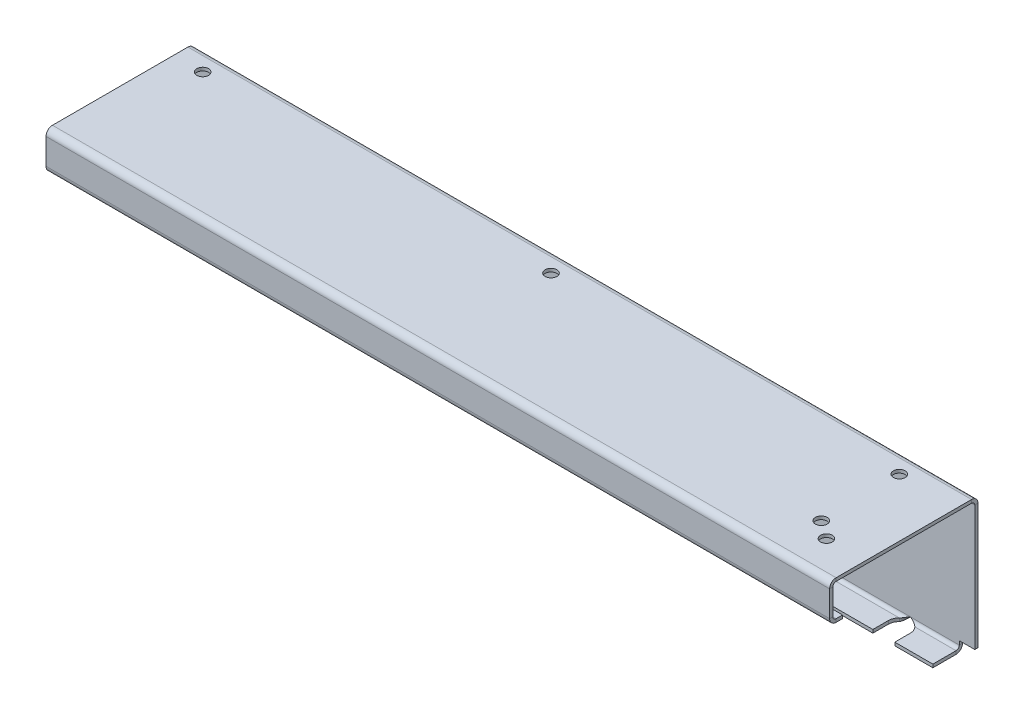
ISO-10303-21;
HEADER;
FILE_DESCRIPTION(('STEP AP214'),'2;1');
FILE_NAME('part.step','',(''),(''),'','','');
FILE_SCHEMA(('AUTOMOTIVE_DESIGN { 1 0 10303 214 1 1 1 1 }'));
ENDSEC;
DATA;
#1=APPLICATION_CONTEXT('core data for automotive mechanical design processes');
#2=APPLICATION_PROTOCOL_DEFINITION('international standard','automotive_design',2000,#1);
#3=PRODUCT_CONTEXT('',#1,'mechanical');
#4=PRODUCT('Part','Part','',(#3));
#5=PRODUCT_RELATED_PRODUCT_CATEGORY('part','',(#4));
#6=PRODUCT_DEFINITION_FORMATION('','',#4);
#7=PRODUCT_DEFINITION_CONTEXT('part definition',#1,'design');
#8=PRODUCT_DEFINITION('design','',#6,#7);
#9=PRODUCT_DEFINITION_SHAPE('','',#8);
#10=(LENGTH_UNIT() NAMED_UNIT(*) SI_UNIT(.MILLI.,.METRE.));
#11=(NAMED_UNIT(*) PLANE_ANGLE_UNIT() SI_UNIT($,.RADIAN.));
#12=(NAMED_UNIT(*) SI_UNIT($,.STERADIAN.) SOLID_ANGLE_UNIT());
#13=UNCERTAINTY_MEASURE_WITH_UNIT(LENGTH_MEASURE(1.E-05),#10,'distance_accuracy_value','');
#14=(GEOMETRIC_REPRESENTATION_CONTEXT(3) GLOBAL_UNCERTAINTY_ASSIGNED_CONTEXT((#13)) GLOBAL_UNIT_ASSIGNED_CONTEXT((#10,
#11,#12)) REPRESENTATION_CONTEXT('',''));
#15=CARTESIAN_POINT('',(0.,0.,0.));
#16=DIRECTION('',(0.,0.,1.));
#17=DIRECTION('',(1.,0.,0.));
#18=AXIS2_PLACEMENT_3D('',#15,#16,#17);
#19=CARTESIAN_POINT('',(607.5,5.,-18.));
#20=DIRECTION('',(-1.,0.,0.));
#21=DIRECTION('',(0.,0.,1.));
#22=AXIS2_PLACEMENT_3D('',#19,#20,#21);
#23=CYLINDRICAL_SURFACE('',#22,2.5);
#24=DIRECTION('',(-1.,0.,0.));
#25=VECTOR('',#24,1.);
#26=CARTESIAN_POINT('',(607.5,2.49999999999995,-18.));
#27=LINE('',#26,#25);
#28=CARTESIAN_POINT('',(11.4792027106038,2.50000000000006,-18.));
#29=VERTEX_POINT('',#28);
#30=CARTESIAN_POINT('',(0.,2.50000000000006,-18.));
#31=VERTEX_POINT('',#30);
#32=EDGE_CURVE('E538',#29,#31,#27,.T.);
#33=ORIENTED_EDGE('',*,*,#32,.F.);
#34=CARTESIAN_POINT('',(17.5,4.99999999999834,-20.5));
#35=CARTESIAN_POINT('',(17.3262187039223,4.90575110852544,-20.4999881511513));
#36=CARTESIAN_POINT('',(17.1524307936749,4.81149825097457,-20.494669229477));
#37=CARTESIAN_POINT('',(16.8047514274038,4.62358471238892,-20.4733151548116));
#38=CARTESIAN_POINT('',(16.6308604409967,4.52992556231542,-20.4572589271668));
#39=CARTESIAN_POINT('',(16.2834339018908,4.34410359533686,-20.4143106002));
#40=CARTESIAN_POINT('',(16.1098987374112,4.25194201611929,-20.3874099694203));
#41=CARTESIAN_POINT('',(15.7612986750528,4.06885975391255,-20.3221860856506));
#42=CARTESIAN_POINT('',(15.5862439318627,3.97797164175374,-20.2837163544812));
#43=CARTESIAN_POINT('',(15.2373693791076,3.79976059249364,-20.195293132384));
#44=CARTESIAN_POINT('',(15.0635488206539,3.71243530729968,-20.1453473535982));
#45=CARTESIAN_POINT('',(14.717507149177,3.5425030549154,-20.0337239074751));
#46=CARTESIAN_POINT('',(14.5452849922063,3.4598927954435,-19.9720545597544));
#47=CARTESIAN_POINT('',(14.2495376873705,3.3223722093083,-19.8550849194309));
#48=CARTESIAN_POINT('',(14.1255374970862,3.2660504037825,-19.8026322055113));
#49=CARTESIAN_POINT('',(13.8788085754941,3.15721715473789,-19.6912173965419));
#50=CARTESIAN_POINT('',(13.7560796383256,3.10470508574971,-19.6322563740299));
#51=CARTESIAN_POINT('',(13.5128849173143,3.00449474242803,-19.5080739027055));
#52=CARTESIAN_POINT('',(13.3924099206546,2.95676919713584,-19.4428926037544));
#53=CARTESIAN_POINT('',(13.1533116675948,2.86657822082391,-19.3058476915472));
#54=CARTESIAN_POINT('',(13.0346880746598,2.8241118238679,-19.2339853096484));
#55=CARTESIAN_POINT('',(12.8331314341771,2.75661391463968,-19.1049460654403));
#56=CARTESIAN_POINT('',(12.7496521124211,2.73006074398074,-19.0494128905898));
#57=CARTESIAN_POINT('',(12.5840069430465,2.68055084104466,-18.9349041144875));
#58=CARTESIAN_POINT('',(12.5018409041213,2.65759358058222,-18.875929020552));
#59=CARTESIAN_POINT('',(12.3390464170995,2.61574016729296,-18.7546003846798));
#60=CARTESIAN_POINT('',(12.2584171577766,2.59684181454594,-18.6922486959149));
#61=CARTESIAN_POINT('',(12.0979307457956,2.5633949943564,-18.5634156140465));
#62=CARTESIAN_POINT('',(12.0180946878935,2.54890183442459,-18.4968934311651));
#63=CARTESIAN_POINT('',(11.8604185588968,2.52516028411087,-18.3605072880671));
#64=CARTESIAN_POINT('',(11.7825797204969,2.51591506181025,-18.2906413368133));
#65=CARTESIAN_POINT('',(11.6291012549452,2.50333315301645,-18.1476640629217));
#66=CARTESIAN_POINT('',(11.5534674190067,2.50001084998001,-18.0745452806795));
#67=CARTESIAN_POINT('',(11.4792027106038,2.50000000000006,-18.));
#68=B_SPLINE_CURVE_WITH_KNOTS('',3,(#34,#35,#36,#37,#38,#39,#40,#41,#42,#43,#44,#45,#46,#47,#48,
#49,#50,#51,#52,#53,#54,#55,#56,#57,#58,#59,#60,#61,#62,#63,#64,#65,#66,#67),.UNSPECIFIED.,.F.,
.F.,(4,2,2,2,2,2,2,2,2,2,2,2,2,2,2,2,4),(0.,0.593022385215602,1.18721215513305,1.78187029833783,
2.38439939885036,2.98652476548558,3.58822441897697,4.02587674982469,4.46345706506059,
4.89838273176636,5.33322839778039,5.64427491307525,5.95527569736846,6.26610749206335,
6.58069433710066,6.89547089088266,7.21101082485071),.UNSPECIFIED.);
#69=CARTESIAN_POINT('',(17.5,4.99999999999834,-20.5));
#70=VERTEX_POINT('',#69);
#71=EDGE_CURVE('E450',#70,#29,#68,.T.);
#72=ORIENTED_EDGE('',*,*,#71,.F.);
#73=DIRECTION('',(-1.,0.,0.));
#74=VECTOR('',#73,1.);
#75=CARTESIAN_POINT('',(607.5,4.99999999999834,-20.5));
#76=LINE('',#75,#74);
#77=CARTESIAN_POINT('',(0.,4.99999999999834,-20.5));
#78=VERTEX_POINT('',#77);
#79=EDGE_CURVE('E562',#70,#78,#76,.T.);
#80=ORIENTED_EDGE('',*,*,#79,.T.);
#81=CARTESIAN_POINT('',(0.,5.,-18.));
#82=DIRECTION('',(1.,0.,0.));
#83=DIRECTION('',(0.,0.,-1.));
#84=AXIS2_PLACEMENT_3D('',#81,#82,#83);
#85=CIRCLE('',#84,2.5);
#86=EDGE_CURVE('E674',#31,#78,#85,.T.);
#87=ORIENTED_EDGE('',*,*,#86,.F.);
#88=EDGE_LOOP('',(#33,#72,#80,#87));
#89=FACE_BOUND('',#88,.T.);
#90=ADVANCED_FACE('F40',(#89),#23,.F.);
#91=CARTESIAN_POINT('',(82.5,4.99999999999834,-20.5));
#92=VERTEX_POINT('',#91);
#93=EDGE_CURVE('E570',#92,#70,#76,.T.);
#94=ORIENTED_EDGE('',*,*,#93,.T.);
#95=CARTESIAN_POINT('',(23.520797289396,2.50000000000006,-18.));
#96=CARTESIAN_POINT('',(23.4538785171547,2.50000689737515,-18.0671673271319));
#97=CARTESIAN_POINT('',(23.3858461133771,2.50270622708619,-18.1331833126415));
#98=CARTESIAN_POINT('',(23.2479502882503,2.51298247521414,-18.2625955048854));
#99=CARTESIAN_POINT('',(23.1780909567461,2.52054926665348,-18.3259968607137));
#100=CARTESIAN_POINT('',(23.0366982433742,2.5400517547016,-18.4501073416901));
#101=CARTESIAN_POINT('',(22.9651658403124,2.55198495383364,-18.5108179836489));
#102=CARTESIAN_POINT('',(22.821376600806,2.57962832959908,-18.6288359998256));
#103=CARTESIAN_POINT('',(22.7491359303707,2.59529632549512,-18.6861730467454));
#104=CARTESIAN_POINT('',(22.6033228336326,2.63009349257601,-18.798110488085));
#105=CARTESIAN_POINT('',(22.5297497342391,2.64922445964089,-18.8527094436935));
#106=CARTESIAN_POINT('',(22.3814521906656,2.69059982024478,-18.9591300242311));
#107=CARTESIAN_POINT('',(22.3067274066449,2.71284514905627,-19.0109508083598));
#108=CARTESIAN_POINT('',(22.1188438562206,2.7718822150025,-19.1368577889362));
#109=CARTESIAN_POINT('',(22.0050543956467,2.81040591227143,-19.209198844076));
#110=CARTESIAN_POINT('',(21.7755900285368,2.89276593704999,-19.347609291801));
#111=CARTESIAN_POINT('',(21.6599147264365,2.93660339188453,-19.4136773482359));
#112=CARTESIAN_POINT('',(21.4269979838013,3.02879433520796,-19.5396232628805));
#113=CARTESIAN_POINT('',(21.3097563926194,3.07714826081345,-19.5995005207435));
#114=CARTESIAN_POINT('',(21.0729018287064,3.17817308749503,-19.7137127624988));
#115=CARTESIAN_POINT('',(20.9532769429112,3.23087994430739,-19.7679910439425));
#116=CARTESIAN_POINT('',(20.7129451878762,3.33957999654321,-19.8704502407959));
#117=CARTESIAN_POINT('',(20.5922384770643,3.39557271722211,-19.9186320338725));
#118=CARTESIAN_POINT('',(20.3499191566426,3.51032977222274,-20.0090340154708));
#119=CARTESIAN_POINT('',(20.228306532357,3.56909415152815,-20.0512541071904));
#120=CARTESIAN_POINT('',(19.9621953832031,3.69981553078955,-20.1369811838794));
#121=CARTESIAN_POINT('',(19.8175488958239,3.77223130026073,-20.1793311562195));
#122=CARTESIAN_POINT('',(19.5274223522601,3.91962152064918,-20.2560331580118));
#123=CARTESIAN_POINT('',(19.3819421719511,3.99459636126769,-20.2903839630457));
#124=CARTESIAN_POINT('',(19.0903351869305,4.14652401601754,-20.351228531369));
#125=CARTESIAN_POINT('',(18.9442082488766,4.22347725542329,-20.3777205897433));
#126=CARTESIAN_POINT('',(18.6540113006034,4.37747174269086,-20.4225562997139));
#127=CARTESIAN_POINT('',(18.5099488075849,4.45448901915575,-20.4410314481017));
#128=CARTESIAN_POINT('',(18.2215863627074,4.60939523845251,-20.4705555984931));
#129=CARTESIAN_POINT('',(18.0772864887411,4.68728393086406,-20.4816066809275));
#130=CARTESIAN_POINT('',(17.7886567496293,4.84344902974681,-20.4963234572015));
#131=CARTESIAN_POINT('',(17.6443269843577,4.92172510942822,-20.4999945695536));
#132=CARTESIAN_POINT('',(17.5,4.99999999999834,-20.5));
#133=B_SPLINE_CURVE_WITH_KNOTS('',3,(#95,#96,#97,#98,#99,#100,#101,#102,#103,#104,#105,#106,
#107,#108,#109,#110,#111,#112,#113,#114,#115,#116,#117,#118,#119,#120,#121,#122,#123,#124,#125,
#126,#127,#128,#129,#130,#131,#132),.UNSPECIFIED.,.F.,.F.,(4,2,2,2,2,2,2,2,2,2,2,2,2,2,2,2,2,2,
4),(0.,0.284345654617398,0.568101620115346,0.851695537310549,1.13222681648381,1.41290399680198,
1.69366564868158,2.1140699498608,2.53456359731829,2.95509798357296,3.37954210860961,
3.80392505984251,4.22831490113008,4.72972421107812,5.23121022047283,5.73280494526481,
6.22582893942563,6.71871471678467,7.21123847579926),.UNSPECIFIED.);
#134=CARTESIAN_POINT('',(23.520797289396,2.50000000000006,-18.));
#135=VERTEX_POINT('',#134);
#136=EDGE_CURVE('E1019',#135,#70,#133,.T.);
#137=ORIENTED_EDGE('',*,*,#136,.F.);
#138=CARTESIAN_POINT('',(82.5,2.50000000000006,-18.));
#139=VERTEX_POINT('',#138);
#140=EDGE_CURVE('E546',#139,#135,#27,.T.);
#141=ORIENTED_EDGE('',*,*,#140,.F.);
#142=CARTESIAN_POINT('',(82.5,5.,-18.));
#143=DIRECTION('',(-1.,0.,0.));
#144=DIRECTION('',(0.,0.,1.));
#145=AXIS2_PLACEMENT_3D('',#142,#143,#144);
#146=CIRCLE('',#145,2.5);
#147=EDGE_CURVE('E819',#92,#139,#146,.T.);
#148=ORIENTED_EDGE('',*,*,#147,.F.);
#149=EDGE_LOOP('',(#94,#137,#141,#148));
#150=FACE_BOUND('',#149,.T.);
#151=ADVANCED_FACE('F1017',(#150),#23,.F.);
#152=CARTESIAN_POINT('',(607.5,2.49999999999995,0.));
#153=DIRECTION('',(0.,1.,0.));
#154=DIRECTION('',(0.,0.,1.));
#155=AXIS2_PLACEMENT_3D('',#152,#153,#154);
#156=PLANE('',#155);
#157=CARTESIAN_POINT('',(17.4999999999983,2.50000000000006,-12.));
#158=DIRECTION('',(0.,1.,0.));
#159=DIRECTION('',(0.,0.,1.));
#160=AXIS2_PLACEMENT_3D('',#157,#158,#159);
#161=CIRCLE('',#160,8.5);
#162=CARTESIAN_POINT('',(25.9999999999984,2.50000000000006,-11.9999999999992));
#163=VERTEX_POINT('',#162);
#164=EDGE_CURVE('E442',#163,#135,#161,.T.);
#165=ORIENTED_EDGE('',*,*,#164,.F.);
#166=DIRECTION('',(0.,0.,-1.));
#167=VECTOR('',#166,1.);
#168=CARTESIAN_POINT('',(25.9999999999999,2.50000000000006,9.43689570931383E-13));
#169=LINE('',#168,#167);
#170=CARTESIAN_POINT('',(25.9999999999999,2.50000000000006,8.32667268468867E-13));
#171=VERTEX_POINT('',#170);
#172=EDGE_CURVE('E1031',#171,#163,#169,.T.);
#173=ORIENTED_EDGE('',*,*,#172,.F.);
#174=DIRECTION('',(-1.,0.,0.));
#175=VECTOR('',#174,1.);
#176=CARTESIAN_POINT('',(607.5,2.49999999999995,0.));
#177=LINE('',#176,#175);
#178=CARTESIAN_POINT('',(82.5,2.50000000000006,0.));
#179=VERTEX_POINT('',#178);
#180=EDGE_CURVE('E520',#179,#171,#177,.T.);
#181=ORIENTED_EDGE('',*,*,#180,.F.);
#182=DIRECTION('',(0.,0.,1.));
#183=VECTOR('',#182,1.);
#184=CARTESIAN_POINT('',(82.5,2.50000000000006,0.));
#185=LINE('',#184,#183);
#186=EDGE_CURVE('E825',#179,#139,#185,.F.);
#187=ORIENTED_EDGE('',*,*,#186,.T.);
#188=ORIENTED_EDGE('',*,*,#140,.T.);
#189=EDGE_LOOP('',(#165,#173,#181,#187,#188));
#190=FACE_BOUND('',#189,.T.);
#191=ADVANCED_FACE('F1029',(#190),#156,.T.);
#192=CARTESIAN_POINT('',(9.00000000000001,2.49999999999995,8.32667268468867E-13));
#193=VERTEX_POINT('',#192);
#194=CARTESIAN_POINT('',(0.,2.49999999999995,0.));
#195=VERTEX_POINT('',#194);
#196=EDGE_CURVE('E513',#193,#195,#177,.T.);
#197=ORIENTED_EDGE('',*,*,#196,.F.);
#198=DIRECTION('',(0.,0.,1.));
#199=VECTOR('',#198,1.);
#200=CARTESIAN_POINT('',(9.00000000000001,2.49999999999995,8.32667268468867E-13));
#201=LINE('',#200,#199);
#202=CARTESIAN_POINT('',(8.99999999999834,2.50000000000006,-11.9999999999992));
#203=VERTEX_POINT('',#202);
#204=EDGE_CURVE('E1891',#203,#193,#201,.T.);
#205=ORIENTED_EDGE('',*,*,#204,.F.);
#206=EDGE_CURVE('E1888',#29,#203,#161,.T.);
#207=ORIENTED_EDGE('',*,*,#206,.F.);
#208=ORIENTED_EDGE('',*,*,#32,.T.);
#209=DIRECTION('',(0.,0.,-1.));
#210=VECTOR('',#209,1.);
#211=CARTESIAN_POINT('',(0.,2.49999999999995,0.));
#212=LINE('',#211,#210);
#213=EDGE_CURVE('E670',#195,#31,#212,.T.);
#214=ORIENTED_EDGE('',*,*,#213,.F.);
#215=EDGE_LOOP('',(#197,#205,#207,#208,#214));
#216=FACE_BOUND('',#215,.T.);
#217=ADVANCED_FACE('F1470',(#216),#156,.T.);
#218=CARTESIAN_POINT('',(607.5,0.,0.));
#219=DIRECTION('',(0.,0.,1.));
#220=DIRECTION('',(1.,0.,0.));
#221=AXIS2_PLACEMENT_3D('',#218,#219,#220);
#222=PLANE('',#221);
#223=DIRECTION('',(-1.,0.,0.));
#224=VECTOR('',#223,1.);
#225=CARTESIAN_POINT('',(607.5,0.,0.));
#226=LINE('',#225,#224);
#227=CARTESIAN_POINT('',(9.00000000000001,0.,8.32667268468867E-13));
#228=VERTEX_POINT('',#227);
#229=CARTESIAN_POINT('',(0.,0.,0.));
#230=VERTEX_POINT('',#229);
#231=EDGE_CURVE('E493',#228,#230,#226,.T.);
#232=ORIENTED_EDGE('',*,*,#231,.F.);
#233=DIRECTION('',(0.,1.,0.));
#234=VECTOR('',#233,1.);
#235=CARTESIAN_POINT('',(9.00000000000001,2.49999999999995,8.32667268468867E-13));
#236=LINE('',#235,#234);
#237=EDGE_CURVE('E1733',#193,#228,#236,.F.);
#238=ORIENTED_EDGE('',*,*,#237,.F.);
#239=ORIENTED_EDGE('',*,*,#196,.T.);
#240=DIRECTION('',(0.,1.,0.));
#241=VECTOR('',#240,1.);
#242=CARTESIAN_POINT('',(0.,0.,0.));
#243=LINE('',#242,#241);
#244=EDGE_CURVE('E682',#230,#195,#243,.T.);
#245=ORIENTED_EDGE('',*,*,#244,.F.);
#246=EDGE_LOOP('',(#232,#238,#239,#245));
#247=FACE_BOUND('',#246,.T.);
#248=ADVANCED_FACE('F1368',(#247),#222,.T.);
#249=ORIENTED_EDGE('',*,*,#180,.T.);
#250=DIRECTION('',(0.,1.,0.));
#251=VECTOR('',#250,1.);
#252=CARTESIAN_POINT('',(25.9999999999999,2.50000000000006,8.32667268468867E-13));
#253=LINE('',#252,#251);
#254=CARTESIAN_POINT('',(25.9999999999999,0.,8.32667268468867E-13));
#255=VERTEX_POINT('',#254);
#256=EDGE_CURVE('E1036',#171,#255,#253,.F.);
#257=ORIENTED_EDGE('',*,*,#256,.T.);
#258=CARTESIAN_POINT('',(82.5,0.,0.));
#259=VERTEX_POINT('',#258);
#260=EDGE_CURVE('E501',#259,#255,#226,.T.);
#261=ORIENTED_EDGE('',*,*,#260,.F.);
#262=DIRECTION('',(0.,-1.,0.));
#263=VECTOR('',#262,1.);
#264=CARTESIAN_POINT('',(82.5,0.,0.));
#265=LINE('',#264,#263);
#266=EDGE_CURVE('E839',#259,#179,#265,.F.);
#267=ORIENTED_EDGE('',*,*,#266,.T.);
#268=EDGE_LOOP('',(#249,#257,#261,#267));
#269=FACE_BOUND('',#268,.T.);
#270=ADVANCED_FACE('F1034',(#269),#222,.T.);
#271=CARTESIAN_POINT('',(607.5,0.,0.));
#272=DIRECTION('',(0.,1.,0.));
#273=DIRECTION('',(0.,0.,1.));
#274=AXIS2_PLACEMENT_3D('',#271,#272,#273);
#275=PLANE('',#274);
#276=DIRECTION('',(0.,0.,1.));
#277=VECTOR('',#276,1.);
#278=CARTESIAN_POINT('',(25.9999999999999,0.,8.32667268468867E-13));
#279=LINE('',#278,#277);
#280=CARTESIAN_POINT('',(25.9999999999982,0.,-11.9999999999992));
#281=VERTEX_POINT('',#280);
#282=EDGE_CURVE('E1863',#255,#281,#279,.F.);
#283=ORIENTED_EDGE('',*,*,#282,.T.);
#284=CARTESIAN_POINT('',(17.4999999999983,0.,-12.));
#285=DIRECTION('',(0.,1.,0.));
#286=DIRECTION('',(0.,0.,1.));
#287=AXIS2_PLACEMENT_3D('',#284,#285,#286);
#288=CIRCLE('',#287,8.5);
#289=CARTESIAN_POINT('',(23.520797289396,0.,-18.));
#290=VERTEX_POINT('',#289);
#291=EDGE_CURVE('E454',#281,#290,#288,.T.);
#292=ORIENTED_EDGE('',*,*,#291,.T.);
#293=DIRECTION('',(-1.,0.,0.));
#294=VECTOR('',#293,1.);
#295=CARTESIAN_POINT('',(607.5,0.,-18.));
#296=LINE('',#295,#294);
#297=CARTESIAN_POINT('',(82.5,0.,-18.));
#298=VERTEX_POINT('',#297);
#299=EDGE_CURVE('E473',#298,#290,#296,.T.);
#300=ORIENTED_EDGE('',*,*,#299,.F.);
#301=DIRECTION('',(0.,0.,-1.));
#302=VECTOR('',#301,1.);
#303=CARTESIAN_POINT('',(82.5,0.,7.00000000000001));
#304=LINE('',#303,#302);
#305=EDGE_CURVE('E801',#259,#298,#304,.T.);
#306=ORIENTED_EDGE('',*,*,#305,.F.);
#307=ORIENTED_EDGE('',*,*,#260,.T.);
#308=EDGE_LOOP('',(#283,#292,#300,#306,#307));
#309=FACE_BOUND('',#308,.T.);
#310=ADVANCED_FACE('F1040',(#309),#275,.F.);
#311=DIRECTION('',(0.,0.,1.));
#312=VECTOR('',#311,1.);
#313=CARTESIAN_POINT('',(9.00000000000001,0.,8.32667268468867E-13));
#314=LINE('',#313,#312);
#315=CARTESIAN_POINT('',(8.99999999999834,0.,-11.9999999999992));
#316=VERTEX_POINT('',#315);
#317=EDGE_CURVE('E441',#316,#228,#314,.T.);
#318=ORIENTED_EDGE('',*,*,#317,.T.);
#319=ORIENTED_EDGE('',*,*,#231,.T.);
#320=DIRECTION('',(0.,0.,-1.));
#321=VECTOR('',#320,1.);
#322=CARTESIAN_POINT('',(0.,0.,0.));
#323=LINE('',#322,#321);
#324=CARTESIAN_POINT('',(0.,0.,-18.));
#325=VERTEX_POINT('',#324);
#326=EDGE_CURVE('E470',#230,#325,#323,.T.);
#327=ORIENTED_EDGE('',*,*,#326,.T.);
#328=CARTESIAN_POINT('',(11.4792027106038,0.,-18.));
#329=VERTEX_POINT('',#328);
#330=EDGE_CURVE('E460',#329,#325,#296,.T.);
#331=ORIENTED_EDGE('',*,*,#330,.F.);
#332=CARTESIAN_POINT('',(17.4999999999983,0.,-12.));
#333=DIRECTION('',(0.,1.,0.));
#334=DIRECTION('',(0.,0.,1.));
#335=AXIS2_PLACEMENT_3D('',#332,#333,#334);
#336=CIRCLE('',#335,8.5);
#337=EDGE_CURVE('E430',#329,#316,#336,.T.);
#338=ORIENTED_EDGE('',*,*,#337,.T.);
#339=EDGE_LOOP('',(#318,#319,#327,#331,#338));
#340=FACE_BOUND('',#339,.T.);
#341=ADVANCED_FACE('F468',(#340),#275,.F.);
#342=CARTESIAN_POINT('',(607.5,5.,-18.));
#343=DIRECTION('',(-1.,0.,0.));
#344=DIRECTION('',(0.,0.,1.));
#345=AXIS2_PLACEMENT_3D('',#342,#343,#344);
#346=CYLINDRICAL_SURFACE('',#345,5.);
#347=CARTESIAN_POINT('',(17.5,4.99999999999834,-23.));
#348=CARTESIAN_POINT('',(17.3558494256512,4.8436399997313,-23.0000029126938));
#349=CARTESIAN_POINT('',(17.2116953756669,4.68727966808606,-22.9926653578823));
#350=CARTESIAN_POINT('',(16.9237094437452,4.37564486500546,-22.9633323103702));
#351=CARTESIAN_POINT('',(16.7798775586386,4.22037038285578,-22.9413369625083));
#352=CARTESIAN_POINT('',(16.492166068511,3.91124270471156,-22.88256913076));
#353=CARTESIAN_POINT('',(16.3482896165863,3.75740005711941,-22.8457254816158));
#354=CARTESIAN_POINT('',(16.0615439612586,3.45304487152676,-22.7573147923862));
#355=CARTESIAN_POINT('',(15.9186747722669,3.3025323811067,-22.70574754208));
#356=CARTESIAN_POINT('',(15.6048378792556,2.9753110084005,-22.5757738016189));
#357=CARTESIAN_POINT('',(15.4341735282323,2.79962639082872,-22.4940215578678));
#358=CARTESIAN_POINT('',(15.095571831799,2.45706004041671,-22.3094423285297));
#359=CARTESIAN_POINT('',(14.9276334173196,2.29017479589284,-22.2066238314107));
#360=CARTESIAN_POINT('',(14.5952723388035,1.96763651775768,-21.9803944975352));
#361=CARTESIAN_POINT('',(14.4308460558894,1.81197148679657,-21.857006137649));
#362=CARTESIAN_POINT('',(14.1061996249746,1.51414779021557,-21.5900950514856));
#363=CARTESIAN_POINT('',(13.9459781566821,1.37198484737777,-21.4465787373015));
#364=CARTESIAN_POINT('',(13.6662508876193,1.1342471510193,-21.1750191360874));
#365=CARTESIAN_POINT('',(13.5457458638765,1.0354152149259,-21.0508388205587));
#366=CARTESIAN_POINT('',(13.3081072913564,0.848659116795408,-20.791399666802));
#367=CARTESIAN_POINT('',(13.1909747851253,0.760738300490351,-20.6561374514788));
#368=CARTESIAN_POINT('',(12.9608150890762,0.597372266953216,-20.3755369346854));
#369=CARTESIAN_POINT('',(12.8477800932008,0.521902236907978,-20.2302195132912));
#370=CARTESIAN_POINT('',(12.6260834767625,0.384644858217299,-19.9302028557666));
#371=CARTESIAN_POINT('',(12.5174193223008,0.32284948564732,-19.7755091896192));
#372=CARTESIAN_POINT('',(12.3269573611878,0.225568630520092,-19.4908055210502));
#373=CARTESIAN_POINT('',(12.2442670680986,0.187284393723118,-19.3623420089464));
#374=CARTESIAN_POINT('',(12.0821709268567,0.120826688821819,-19.1008447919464));
#375=CARTESIAN_POINT('',(12.0027641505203,0.0926503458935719,-18.9678123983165));
#376=CARTESIAN_POINT('',(11.8471316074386,0.0469661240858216,-18.6973713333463));
#377=CARTESIAN_POINT('',(11.7709197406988,0.0295010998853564,-18.5599473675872));
#378=CARTESIAN_POINT('',(11.6222033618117,0.00600823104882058,-18.2820299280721));
#379=CARTESIAN_POINT('',(11.5497014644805,-1.16521266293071E-05,-18.1415343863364));
#380=CARTESIAN_POINT('',(11.4792027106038,0.,-18.));
#381=B_SPLINE_CURVE_WITH_KNOTS('',3,(#347,#348,#349,#350,#351,#352,#353,#354,#355,#356,#357,
#358,#359,#360,#361,#362,#363,#364,#365,#366,#367,#368,#369,#370,#371,#372,#373,#374,#375,#376,
#377,#378,#379,#380),.UNSPECIFIED.,.F.,.F.,(4,2,2,2,2,2,2,2,2,2,2,2,2,2,2,2,4),(0.,
0.637882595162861,1.27575888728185,1.91672947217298,2.55770920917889,3.33132928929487,
4.10463825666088,4.87710769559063,5.64933160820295,6.24657040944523,6.84399189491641,
7.4402080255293,8.0360733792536,8.50817881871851,8.98014987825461,9.45399712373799,
9.92817386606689),.UNSPECIFIED.);
#382=CARTESIAN_POINT('',(17.5,4.99999999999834,-23.));
#383=VERTEX_POINT('',#382);
#384=EDGE_CURVE('E447',#383,#329,#381,.T.);
#385=ORIENTED_EDGE('',*,*,#384,.T.);
#386=ORIENTED_EDGE('',*,*,#330,.T.);
#387=CARTESIAN_POINT('',(0.,5.,-18.));
#388=DIRECTION('',(-1.,0.,0.));
#389=DIRECTION('',(0.,0.,1.));
#390=AXIS2_PLACEMENT_3D('',#387,#388,#389);
#391=CIRCLE('',#390,5.);
#392=CARTESIAN_POINT('',(0.,4.99999999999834,-23.));
#393=VERTEX_POINT('',#392);
#394=EDGE_CURVE('E675',#325,#393,#391,.F.);
#395=ORIENTED_EDGE('',*,*,#394,.T.);
#396=DIRECTION('',(-1.,0.,0.));
#397=VECTOR('',#396,1.);
#398=CARTESIAN_POINT('',(607.5,4.99999999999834,-23.));
#399=LINE('',#398,#397);
#400=EDGE_CURVE('E462',#383,#393,#399,.T.);
#401=ORIENTED_EDGE('',*,*,#400,.F.);
#402=EDGE_LOOP('',(#385,#386,#395,#401));
#403=FACE_BOUND('',#402,.T.);
#404=ADVANCED_FACE('F458',(#403),#346,.T.);
#405=CARTESIAN_POINT('',(23.520797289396,0.,-18.));
#406=CARTESIAN_POINT('',(23.4441671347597,-1.61333947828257E-05,-18.1538520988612));
#407=CARTESIAN_POINT('',(23.3651692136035,0.00709902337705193,-18.3064686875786));
#408=CARTESIAN_POINT('',(23.2028083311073,0.0347997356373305,-18.6079818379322));
#409=CARTESIAN_POINT('',(23.1194485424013,0.0553756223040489,-18.7568809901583));
#410=CARTESIAN_POINT('',(22.9490386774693,0.109077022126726,-19.049222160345));
#411=CARTESIAN_POINT('',(22.8620085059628,0.142141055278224,-19.1926871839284));
#412=CARTESIAN_POINT('',(22.6841599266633,0.219978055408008,-19.474005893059));
#413=CARTESIAN_POINT('',(22.5933408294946,0.264753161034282,-19.6118585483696));
#414=CARTESIAN_POINT('',(22.4060662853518,0.366341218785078,-19.8843707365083));
#415=CARTESIAN_POINT('',(22.309528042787,0.423416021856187,-20.0188754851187));
#416=CARTESIAN_POINT('',(22.1131250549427,0.547990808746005,-20.2804855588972));
#417=CARTESIAN_POINT('',(22.0132591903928,0.615494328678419,-20.4075883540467));
#418=CARTESIAN_POINT('',(21.8104610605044,0.760036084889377,-20.6538861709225));
#419=CARTESIAN_POINT('',(21.7075261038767,0.837082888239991,-20.7730739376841));
#420=CARTESIAN_POINT('',(21.4989454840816,0.999762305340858,-21.0029890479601));
#421=CARTESIAN_POINT('',(21.3932988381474,1.08539806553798,-21.1137132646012));
#422=CARTESIAN_POINT('',(21.1637208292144,1.27770738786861,-21.3421574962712));
#423=CARTESIAN_POINT('',(21.0394103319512,1.38561444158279,-21.458462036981));
#424=CARTESIAN_POINT('',(20.7880511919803,1.61029721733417,-21.6789567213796));
#425=CARTESIAN_POINT('',(20.6610015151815,1.72707633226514,-21.7831421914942));
#426=CARTESIAN_POINT('',(20.276249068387,2.08894377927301,-22.0770388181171));
#427=CARTESIAN_POINT('',(20.0149093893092,2.34559076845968,-22.2481235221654));
#428=CARTESIAN_POINT('',(19.4483545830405,2.91814367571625,-22.5592417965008));
#429=CARTESIAN_POINT('',(19.1421672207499,3.23729450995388,-22.6914468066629));
#430=CARTESIAN_POINT('',(18.5252184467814,3.89124389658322,-22.8874210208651));
#431=CARTESIAN_POINT('',(18.2144631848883,4.22602253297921,-22.9512749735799));
#432=CARTESIAN_POINT('',(17.8361563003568,4.63552710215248,-22.9872354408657));
#433=CARTESIAN_POINT('',(17.7688964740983,4.70840855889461,-22.9920252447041));
#434=CARTESIAN_POINT('',(17.6344305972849,4.85418705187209,-22.998404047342));
#435=CARTESIAN_POINT('',(17.5672245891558,4.9270839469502,-22.9999971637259));
#436=CARTESIAN_POINT('',(17.5,4.99999999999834,-23.));
#437=B_SPLINE_CURVE_WITH_KNOTS('',3,(#405,#406,#407,#408,#409,#410,#411,#412,#413,#414,#415,
#416,#417,#418,#419,#420,#421,#422,#423,#424,#425,#426,#427,#428,#429,#430,#431,#432,#433,#434,
#435,#436),.UNSPECIFIED.,.F.,.F.,(4,2,2,2,2,2,2,2,2,2,2,2,2,2,2,4),(0.,0.515398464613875,
1.03042712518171,1.54295263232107,2.05557180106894,2.58042819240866,3.10546294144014,
3.63097248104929,4.15667524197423,4.76070083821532,5.36495860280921,6.57331014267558,
7.95278516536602,9.33054778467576,9.62839372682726,9.92585577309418),.UNSPECIFIED.);
#438=EDGE_CURVE('E465',#290,#383,#437,.T.);
#439=ORIENTED_EDGE('',*,*,#438,.T.);
#440=CARTESIAN_POINT('',(82.5,4.99999999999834,-23.));
#441=VERTEX_POINT('',#440);
#442=EDGE_CURVE('E487',#441,#383,#399,.T.);
#443=ORIENTED_EDGE('',*,*,#442,.F.);
#444=CARTESIAN_POINT('',(82.5,5.,-18.));
#445=DIRECTION('',(-1.,0.,0.));
#446=DIRECTION('',(0.,0.,1.));
#447=AXIS2_PLACEMENT_3D('',#444,#445,#446);
#448=CIRCLE('',#447,5.);
#449=EDGE_CURVE('E789',#441,#298,#448,.T.);
#450=ORIENTED_EDGE('',*,*,#449,.T.);
#451=ORIENTED_EDGE('',*,*,#299,.T.);
#452=EDGE_LOOP('',(#439,#443,#450,#451));
#453=FACE_BOUND('',#452,.T.);
#454=ADVANCED_FACE('F1043',(#453),#346,.T.);
#455=CARTESIAN_POINT('',(551.479202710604,2.49999999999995,-18.));
#456=VERTEX_POINT('',#455);
#457=CARTESIAN_POINT('',(492.499999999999,2.49999999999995,-17.9999999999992));
#458=VERTEX_POINT('',#457);
#459=EDGE_CURVE('E547',#456,#458,#27,.T.);
#460=ORIENTED_EDGE('',*,*,#459,.F.);
#461=CARTESIAN_POINT('',(557.5,4.99999999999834,-20.5));
#462=CARTESIAN_POINT('',(557.326218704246,4.90575110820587,-20.4999881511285));
#463=CARTESIAN_POINT('',(557.152430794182,4.81149825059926,-20.4946692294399));
#464=CARTESIAN_POINT('',(556.804751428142,4.62358471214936,-20.4733151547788));
#465=CARTESIAN_POINT('',(556.630860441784,4.52992556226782,-20.4572589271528));
#466=CARTESIAN_POINT('',(556.283433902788,4.3441035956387,-20.4143106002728));
#467=CARTESIAN_POINT('',(556.109898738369,4.25194201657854,-20.3874099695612));
#468=CARTESIAN_POINT('',(555.761298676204,4.06885975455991,-20.3221860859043));
#469=CARTESIAN_POINT('',(555.586243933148,3.97797164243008,-20.2837163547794));
#470=CARTESIAN_POINT('',(555.237369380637,3.79976059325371,-20.1952931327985));
#471=CARTESIAN_POINT('',(555.063548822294,3.7124353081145,-20.1453473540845));
#472=CARTESIAN_POINT('',(554.71750715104,3.54250305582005,-20.0337239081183));
#473=CARTESIAN_POINT('',(554.545284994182,3.45989279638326,-19.9720545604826));
#474=CARTESIAN_POINT('',(554.249537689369,3.32237221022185,-19.8550849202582));
#475=CARTESIAN_POINT('',(554.125537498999,3.26605040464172,-19.8026322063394));
#476=CARTESIAN_POINT('',(553.878808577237,3.15721715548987,-19.6912173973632));
#477=CARTESIAN_POINT('',(553.756079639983,3.10470508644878,-19.6322563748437));
#478=CARTESIAN_POINT('',(553.512884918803,3.00449474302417,-19.5080739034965));
#479=CARTESIAN_POINT('',(553.392409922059,2.95676919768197,-19.4428926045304));
#480=CARTESIAN_POINT('',(553.153311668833,2.86657822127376,-19.3058476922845));
#481=CARTESIAN_POINT('',(553.034688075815,2.82411182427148,-19.2339853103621));
#482=CARTESIAN_POINT('',(552.833131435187,2.75661391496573,-19.1049460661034));
#483=CARTESIAN_POINT('',(552.749652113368,2.73006074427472,-19.0494128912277));
#484=CARTESIAN_POINT('',(552.584006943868,2.6805508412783,-18.9349041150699));
#485=CARTESIAN_POINT('',(552.501840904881,2.65759358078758,-18.8759290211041));
#486=CARTESIAN_POINT('',(552.339046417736,2.61574016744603,-18.7546003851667));
#487=CARTESIAN_POINT('',(552.258417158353,2.59684181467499,-18.6922486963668));
#488=CARTESIAN_POINT('',(552.097930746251,2.56339499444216,-18.5634156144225));
#489=CARTESIAN_POINT('',(552.018094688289,2.54890183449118,-18.4968934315));
#490=CARTESIAN_POINT('',(551.860418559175,2.52516028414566,-18.3605072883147));
#491=CARTESIAN_POINT('',(551.782579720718,2.51591506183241,-18.2906413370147));
#492=CARTESIAN_POINT('',(551.629101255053,2.50333315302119,-18.1476640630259));
#493=CARTESIAN_POINT('',(551.55346741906,2.50001084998,-18.0745452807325));
#494=CARTESIAN_POINT('',(551.479202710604,2.49999999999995,-18.));
#495=B_SPLINE_CURVE_WITH_KNOTS('',3,(#461,#462,#463,#464,#465,#466,#467,#468,#469,#470,#471,
#472,#473,#474,#475,#476,#477,#478,#479,#480,#481,#482,#483,#484,#485,#486,#487,#488,#489,#490,
#491,#492,#493,#494),.UNSPECIFIED.,.F.,.F.,(4,2,2,2,2,2,2,2,2,2,2,2,2,2,2,2,4),(0.,
0.59302238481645,1.18721215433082,1.78187029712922,2.38439939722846,2.98652476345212,
3.58822441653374,4.02587674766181,4.46345706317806,4.89838273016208,5.33322839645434,
5.64427491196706,5.95527569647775,6.26610749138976,6.58069433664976,6.89547089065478,
7.21101082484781),.UNSPECIFIED.);
#496=CARTESIAN_POINT('',(557.5,4.99999999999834,-20.5));
#497=VERTEX_POINT('',#496);
#498=EDGE_CURVE('E1112',#497,#456,#495,.T.);
#499=ORIENTED_EDGE('',*,*,#498,.F.);
#500=CARTESIAN_POINT('',(492.499999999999,4.99999999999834,-20.5));
#501=VERTEX_POINT('',#500);
#502=EDGE_CURVE('E571',#497,#501,#76,.T.);
#503=ORIENTED_EDGE('',*,*,#502,.T.);
#504=CARTESIAN_POINT('',(492.499999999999,5.,-18.));
#505=DIRECTION('',(1.,0.,0.));
#506=DIRECTION('',(0.,0.,-1.));
#507=AXIS2_PLACEMENT_3D('',#504,#505,#506);
#508=CIRCLE('',#507,2.5);
#509=EDGE_CURVE('E1484',#458,#501,#508,.T.);
#510=ORIENTED_EDGE('',*,*,#509,.F.);
#511=EDGE_LOOP('',(#460,#499,#503,#510));
#512=FACE_BOUND('',#511,.T.);
#513=ADVANCED_FACE('F1466',(#512),#23,.F.);
#514=CARTESIAN_POINT('',(595.5,4.99999999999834,-20.5));
#515=VERTEX_POINT('',#514);
#516=EDGE_CURVE('E572',#515,#497,#76,.T.);
#517=ORIENTED_EDGE('',*,*,#516,.T.);
#518=CARTESIAN_POINT('',(563.520797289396,2.49999999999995,-18.));
#519=CARTESIAN_POINT('',(563.453878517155,2.50000689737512,-18.067167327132));
#520=CARTESIAN_POINT('',(563.385846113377,2.50270622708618,-18.1331833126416));
#521=CARTESIAN_POINT('',(563.24795028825,2.51298247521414,-18.2625955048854));
#522=CARTESIAN_POINT('',(563.178090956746,2.52054926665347,-18.3259968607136));
#523=CARTESIAN_POINT('',(563.036698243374,2.54005175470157,-18.45010734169));
#524=CARTESIAN_POINT('',(562.965165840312,2.55198495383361,-18.5108179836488));
#525=CARTESIAN_POINT('',(562.821376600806,2.57962832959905,-18.6288359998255));
#526=CARTESIAN_POINT('',(562.749135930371,2.59529632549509,-18.6861730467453));
#527=CARTESIAN_POINT('',(562.603322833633,2.63009349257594,-18.7981104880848));
#528=CARTESIAN_POINT('',(562.529749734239,2.64922445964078,-18.8527094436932));
#529=CARTESIAN_POINT('',(562.381452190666,2.69059982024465,-18.9591300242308));
#530=CARTESIAN_POINT('',(562.306727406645,2.71284514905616,-19.0109508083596));
#531=CARTESIAN_POINT('',(562.118843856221,2.77188221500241,-19.1368577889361));
#532=CARTESIAN_POINT('',(562.005054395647,2.81040591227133,-19.2091988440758));
#533=CARTESIAN_POINT('',(561.775590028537,2.89276593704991,-19.3476092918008));
#534=CARTESIAN_POINT('',(561.659914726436,2.93660339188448,-19.4136773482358));
#535=CARTESIAN_POINT('',(561.426997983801,3.02879433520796,-19.5396232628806));
#536=CARTESIAN_POINT('',(561.309756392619,3.07714826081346,-19.5995005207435));
#537=CARTESIAN_POINT('',(561.072901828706,3.17817308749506,-19.7137127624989));
#538=CARTESIAN_POINT('',(560.953276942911,3.23087994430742,-19.7679910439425));
#539=CARTESIAN_POINT('',(560.712945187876,3.33957999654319,-19.8704502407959));
#540=CARTESIAN_POINT('',(560.592238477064,3.39557271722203,-19.9186320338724));
#541=CARTESIAN_POINT('',(560.349919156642,3.51032977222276,-20.0090340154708));
#542=CARTESIAN_POINT('',(560.228306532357,3.56909415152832,-20.0512541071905));
#543=CARTESIAN_POINT('',(559.962195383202,3.69981553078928,-20.1369811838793));
#544=CARTESIAN_POINT('',(559.817548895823,3.77223130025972,-20.1793311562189));
#545=CARTESIAN_POINT('',(559.527422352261,3.91962152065,-20.2560331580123));
#546=CARTESIAN_POINT('',(559.381942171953,3.99459636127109,-20.2903839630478));
#547=CARTESIAN_POINT('',(559.090335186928,4.14652401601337,-20.3512285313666));
#548=CARTESIAN_POINT('',(558.944208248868,4.22347725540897,-20.3777205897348));
#549=CARTESIAN_POINT('',(558.654011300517,4.37747174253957,-20.4225562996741));
#550=CARTESIAN_POINT('',(558.50994880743,4.45448901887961,-20.4410314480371));
#551=CARTESIAN_POINT('',(558.221586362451,4.60939523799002,-20.470555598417));
#552=CARTESIAN_POINT('',(558.077286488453,4.68728393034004,-20.4816066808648));
#553=CARTESIAN_POINT('',(557.788656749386,4.84344902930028,-20.4963234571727));
#554=CARTESIAN_POINT('',(557.644326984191,4.92172510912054,-20.4999945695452));
#555=CARTESIAN_POINT('',(557.5,4.99999999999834,-20.5));
#556=B_SPLINE_CURVE_WITH_KNOTS('',3,(#518,#519,#520,#521,#522,#523,#524,#525,#526,#527,#528,
#529,#530,#531,#532,#533,#534,#535,#536,#537,#538,#539,#540,#541,#542,#543,#544,#545,#546,#547,
#548,#549,#550,#551,#552,#553,#554,#555),.UNSPECIFIED.,.F.,.F.,(4,2,2,2,2,2,2,2,2,2,2,2,2,2,2,2,
2,2,4),(0.,0.284345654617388,0.568101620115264,0.851695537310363,1.13222681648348,
1.41290399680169,1.69366564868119,2.11406994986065,2.53456359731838,2.95509798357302,
3.37954210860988,3.80392505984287,4.22831490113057,4.72972421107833,5.23121022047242,
5.73280494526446,6.22582893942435,6.718714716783,7.21123847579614),.UNSPECIFIED.);
#557=CARTESIAN_POINT('',(563.520797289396,2.49999999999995,-18.));
#558=VERTEX_POINT('',#557);
#559=EDGE_CURVE('E1119',#558,#497,#556,.T.);
#560=ORIENTED_EDGE('',*,*,#559,.F.);
#561=CARTESIAN_POINT('',(595.5,2.49999999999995,-18.));
#562=VERTEX_POINT('',#561);
#563=EDGE_CURVE('E548',#562,#558,#27,.T.);
#564=ORIENTED_EDGE('',*,*,#563,.F.);
#565=CARTESIAN_POINT('',(595.5,5.,-18.));
#566=DIRECTION('',(-1.,0.,0.));
#567=DIRECTION('',(0.,0.,1.));
#568=AXIS2_PLACEMENT_3D('',#565,#566,#567);
#569=CIRCLE('',#568,2.5);
#570=EDGE_CURVE('E854',#515,#562,#569,.T.);
#571=ORIENTED_EDGE('',*,*,#570,.F.);
#572=EDGE_LOOP('',(#517,#560,#564,#571));
#573=FACE_BOUND('',#572,.T.);
#574=ADVANCED_FACE('F1374',(#573),#23,.F.);
#575=DIRECTION('',(0.,0.,1.));
#576=VECTOR('',#575,1.);
#577=CARTESIAN_POINT('',(549.,2.49999999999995,0.));
#578=LINE('',#577,#576);
#579=CARTESIAN_POINT('',(548.999999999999,2.49999999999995,-12.));
#580=VERTEX_POINT('',#579);
#581=CARTESIAN_POINT('',(549.,2.49999999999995,0.));
#582=VERTEX_POINT('',#581);
#583=EDGE_CURVE('E1626',#580,#582,#578,.T.);
#584=ORIENTED_EDGE('',*,*,#583,.F.);
#585=CARTESIAN_POINT('',(557.499999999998,2.49999999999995,-12.));
#586=DIRECTION('',(0.,1.,0.));
#587=DIRECTION('',(0.,0.,1.));
#588=AXIS2_PLACEMENT_3D('',#585,#586,#587);
#589=CIRCLE('',#588,8.49999999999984);
#590=EDGE_CURVE('E1491',#456,#580,#589,.T.);
#591=ORIENTED_EDGE('',*,*,#590,.F.);
#592=ORIENTED_EDGE('',*,*,#459,.T.);
#593=DIRECTION('',(0.,0.,1.));
#594=VECTOR('',#593,1.);
#595=CARTESIAN_POINT('',(492.499999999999,2.49999999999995,8.32667268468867E-13));
#596=LINE('',#595,#594);
#597=CARTESIAN_POINT('',(492.499999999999,2.49999999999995,8.32667268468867E-13));
#598=VERTEX_POINT('',#597);
#599=EDGE_CURVE('E1490',#458,#598,#596,.T.);
#600=ORIENTED_EDGE('',*,*,#599,.T.);
#601=EDGE_CURVE('E521',#582,#598,#177,.T.);
#602=ORIENTED_EDGE('',*,*,#601,.F.);
#603=EDGE_LOOP('',(#584,#591,#592,#600,#602));
#604=FACE_BOUND('',#603,.T.);
#605=ADVANCED_FACE('F1370',(#604),#156,.T.);
#606=CARTESIAN_POINT('',(565.999999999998,2.49999999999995,-12.));
#607=VERTEX_POINT('',#606);
#608=EDGE_CURVE('E1643',#607,#558,#589,.T.);
#609=ORIENTED_EDGE('',*,*,#608,.F.);
#610=DIRECTION('',(0.,0.,-1.));
#611=VECTOR('',#610,1.);
#612=CARTESIAN_POINT('',(566.,2.49999999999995,0.));
#613=LINE('',#612,#611);
#614=CARTESIAN_POINT('',(566.,2.49999999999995,0.));
#615=VERTEX_POINT('',#614);
#616=EDGE_CURVE('E1641',#615,#607,#613,.T.);
#617=ORIENTED_EDGE('',*,*,#616,.F.);
#618=CARTESIAN_POINT('',(595.5,2.49999999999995,0.));
#619=VERTEX_POINT('',#618);
#620=EDGE_CURVE('E522',#619,#615,#177,.T.);
#621=ORIENTED_EDGE('',*,*,#620,.F.);
#622=DIRECTION('',(0.,0.,1.));
#623=VECTOR('',#622,1.);
#624=CARTESIAN_POINT('',(595.5,2.49999999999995,0.));
#625=LINE('',#624,#623);
#626=EDGE_CURVE('E859',#619,#562,#625,.F.);
#627=ORIENTED_EDGE('',*,*,#626,.T.);
#628=ORIENTED_EDGE('',*,*,#563,.T.);
#629=EDGE_LOOP('',(#609,#617,#621,#627,#628));
#630=FACE_BOUND('',#629,.T.);
#631=ADVANCED_FACE('F1373',(#630),#156,.T.);
#632=CARTESIAN_POINT('',(549.,0.,0.));
#633=VERTEX_POINT('',#632);
#634=CARTESIAN_POINT('',(492.499999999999,0.,8.32667268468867E-13));
#635=VERTEX_POINT('',#634);
#636=EDGE_CURVE('E502',#633,#635,#226,.T.);
#637=ORIENTED_EDGE('',*,*,#636,.F.);
#638=DIRECTION('',(0.,1.,0.));
#639=VECTOR('',#638,1.);
#640=CARTESIAN_POINT('',(549.,2.49999999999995,0.));
#641=LINE('',#640,#639);
#642=EDGE_CURVE('E1648',#582,#633,#641,.F.);
#643=ORIENTED_EDGE('',*,*,#642,.F.);
#644=ORIENTED_EDGE('',*,*,#601,.T.);
#645=DIRECTION('',(0.,-1.,0.));
#646=VECTOR('',#645,1.);
#647=CARTESIAN_POINT('',(492.499999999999,0.,8.32667268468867E-13));
#648=LINE('',#647,#646);
#649=EDGE_CURVE('E1499',#635,#598,#648,.F.);
#650=ORIENTED_EDGE('',*,*,#649,.F.);
#651=EDGE_LOOP('',(#637,#643,#644,#650));
#652=FACE_BOUND('',#651,.T.);
#653=ADVANCED_FACE('F1795',(#652),#222,.T.);
#654=ORIENTED_EDGE('',*,*,#620,.T.);
#655=DIRECTION('',(0.,1.,0.));
#656=VECTOR('',#655,1.);
#657=CARTESIAN_POINT('',(566.,2.49999999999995,0.));
#658=LINE('',#657,#656);
#659=CARTESIAN_POINT('',(566.,0.,0.));
#660=VERTEX_POINT('',#659);
#661=EDGE_CURVE('E1645',#615,#660,#658,.F.);
#662=ORIENTED_EDGE('',*,*,#661,.T.);
#663=CARTESIAN_POINT('',(595.5,0.,0.));
#664=VERTEX_POINT('',#663);
#665=EDGE_CURVE('E503',#664,#660,#226,.T.);
#666=ORIENTED_EDGE('',*,*,#665,.F.);
#667=DIRECTION('',(0.,-1.,0.));
#668=VECTOR('',#667,1.);
#669=CARTESIAN_POINT('',(595.5,0.,0.));
#670=LINE('',#669,#668);
#671=EDGE_CURVE('E864',#664,#619,#670,.F.);
#672=ORIENTED_EDGE('',*,*,#671,.T.);
#673=EDGE_LOOP('',(#654,#662,#666,#672));
#674=FACE_BOUND('',#673,.T.);
#675=ADVANCED_FACE('F1361',(#674),#222,.T.);
#676=CARTESIAN_POINT('',(557.499999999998,0.,-12.));
#677=DIRECTION('',(0.,1.,0.));
#678=DIRECTION('',(0.,0.,1.));
#679=AXIS2_PLACEMENT_3D('',#676,#677,#678);
#680=CIRCLE('',#679,8.49999999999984);
#681=CARTESIAN_POINT('',(551.479202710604,0.,-18.));
#682=VERTEX_POINT('',#681);
#683=CARTESIAN_POINT('',(548.999999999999,0.,-12.));
#684=VERTEX_POINT('',#683);
#685=EDGE_CURVE('E1629',#682,#684,#680,.T.);
#686=ORIENTED_EDGE('',*,*,#685,.T.);
#687=DIRECTION('',(0.,0.,1.));
#688=VECTOR('',#687,1.);
#689=CARTESIAN_POINT('',(549.,0.,0.));
#690=LINE('',#689,#688);
#691=EDGE_CURVE('E1633',#684,#633,#690,.T.);
#692=ORIENTED_EDGE('',*,*,#691,.T.);
#693=ORIENTED_EDGE('',*,*,#636,.T.);
#694=DIRECTION('',(0.,0.,1.));
#695=VECTOR('',#694,1.);
#696=CARTESIAN_POINT('',(492.499999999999,-1.66533453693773E-12,-20.4999999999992));
#697=LINE('',#696,#695);
#698=CARTESIAN_POINT('',(492.499999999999,0.,-17.9999999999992));
#699=VERTEX_POINT('',#698);
#700=EDGE_CURVE('E1688',#699,#635,#697,.T.);
#701=ORIENTED_EDGE('',*,*,#700,.F.);
#702=EDGE_CURVE('E476',#682,#699,#296,.T.);
#703=ORIENTED_EDGE('',*,*,#702,.F.);
#704=EDGE_LOOP('',(#686,#692,#693,#701,#703));
#705=FACE_BOUND('',#704,.T.);
#706=ADVANCED_FACE('F1357',(#705),#275,.F.);
#707=DIRECTION('',(0.,0.,1.));
#708=VECTOR('',#707,1.);
#709=CARTESIAN_POINT('',(566.,0.,0.));
#710=LINE('',#709,#708);
#711=CARTESIAN_POINT('',(565.999999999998,0.,-12.));
#712=VERTEX_POINT('',#711);
#713=EDGE_CURVE('E1624',#660,#712,#710,.F.);
#714=ORIENTED_EDGE('',*,*,#713,.T.);
#715=CARTESIAN_POINT('',(557.499999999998,0.,-12.));
#716=DIRECTION('',(0.,1.,0.));
#717=DIRECTION('',(0.,0.,1.));
#718=AXIS2_PLACEMENT_3D('',#715,#716,#717);
#719=CIRCLE('',#718,8.49999999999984);
#720=CARTESIAN_POINT('',(563.520797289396,0.,-18.));
#721=VERTEX_POINT('',#720);
#722=EDGE_CURVE('E1625',#712,#721,#719,.T.);
#723=ORIENTED_EDGE('',*,*,#722,.T.);
#724=CARTESIAN_POINT('',(595.5,0.,-18.));
#725=VERTEX_POINT('',#724);
#726=EDGE_CURVE('E477',#725,#721,#296,.T.);
#727=ORIENTED_EDGE('',*,*,#726,.F.);
#728=DIRECTION('',(0.,0.,-1.));
#729=VECTOR('',#728,1.);
#730=CARTESIAN_POINT('',(595.5,0.,92.));
#731=LINE('',#730,#729);
#732=EDGE_CURVE('E857',#664,#725,#731,.T.);
#733=ORIENTED_EDGE('',*,*,#732,.F.);
#734=ORIENTED_EDGE('',*,*,#665,.T.);
#735=EDGE_LOOP('',(#714,#723,#727,#733,#734));
#736=FACE_BOUND('',#735,.T.);
#737=ADVANCED_FACE('F1360',(#736),#275,.F.);
#738=CARTESIAN_POINT('',(557.5,4.99999999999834,-23.));
#739=CARTESIAN_POINT('',(557.355849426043,4.84363999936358,-23.0000029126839));
#740=CARTESIAN_POINT('',(557.211695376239,4.68727966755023,-22.9926653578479));
#741=CARTESIAN_POINT('',(556.923709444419,4.37564486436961,-22.9633323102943));
#742=CARTESIAN_POINT('',(556.779877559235,4.22037038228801,-22.9413369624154));
#743=CARTESIAN_POINT('',(556.492166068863,3.91124270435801,-22.8825691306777));
#744=CARTESIAN_POINT('',(556.348289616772,3.75740005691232,-22.8457254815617));
#745=CARTESIAN_POINT('',(556.061543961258,3.45304487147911,-22.7573147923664));
#746=CARTESIAN_POINT('',(555.918674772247,3.302532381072,-22.7057475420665));
#747=CARTESIAN_POINT('',(555.604837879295,2.97531100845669,-22.5757738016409));
#748=CARTESIAN_POINT('',(555.434173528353,2.79962639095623,-22.4940215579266));
#749=CARTESIAN_POINT('',(555.095571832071,2.45706004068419,-22.3094423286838));
#750=CARTESIAN_POINT('',(554.927633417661,2.29017479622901,-22.2066238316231));
#751=CARTESIAN_POINT('',(554.595272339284,1.96763651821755,-21.9803944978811));
#752=CARTESIAN_POINT('',(554.430846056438,1.81197148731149,-21.85700613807));
#753=CARTESIAN_POINT('',(554.106199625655,1.51414779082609,-21.5900950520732));
#754=CARTESIAN_POINT('',(553.945978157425,1.37198484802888,-21.4465787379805));
#755=CARTESIAN_POINT('',(553.666250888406,1.13424715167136,-21.175019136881));
#756=CARTESIAN_POINT('',(553.545745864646,1.03541521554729,-21.0508388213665));
#757=CARTESIAN_POINT('',(553.308107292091,0.848659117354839,-20.7913996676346));
#758=CARTESIAN_POINT('',(553.190974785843,0.76073830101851,-20.6561374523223));
#759=CARTESIAN_POINT('',(552.960815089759,0.597372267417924,-20.3755369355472));
#760=CARTESIAN_POINT('',(552.847780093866,0.52190223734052,-20.2302195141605));
#761=CARTESIAN_POINT('',(552.626083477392,0.384644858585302,-19.9302028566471));
#762=CARTESIAN_POINT('',(552.517419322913,0.322849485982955,-19.7755091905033));
#763=CARTESIAN_POINT('',(552.326957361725,0.225568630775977,-19.4908055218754));
#764=CARTESIAN_POINT('',(552.244267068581,0.18728439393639,-19.362342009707));
#765=CARTESIAN_POINT('',(552.082170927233,0.120826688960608,-19.100844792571));
#766=CARTESIAN_POINT('',(552.002764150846,0.0926503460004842,-18.9678123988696));
#767=CARTESIAN_POINT('',(551.847131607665,0.0469661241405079,-18.6973713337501));
#768=CARTESIAN_POINT('',(551.770919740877,0.0295010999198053,-18.559947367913));
#769=CARTESIAN_POINT('',(551.622203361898,0.00600823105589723,-18.2820299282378));
#770=CARTESIAN_POINT('',(551.549701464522,-1.16521266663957E-05,-18.1415343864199));
#771=CARTESIAN_POINT('',(551.479202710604,0.,-18.));
#772=B_SPLINE_CURVE_WITH_KNOTS('',3,(#738,#739,#740,#741,#742,#743,#744,#745,#746,#747,#748,
#749,#750,#751,#752,#753,#754,#755,#756,#757,#758,#759,#760,#761,#762,#763,#764,#765,#766,#767,
#768,#769,#770,#771),.UNSPECIFIED.,.F.,.F.,(4,2,2,2,2,2,2,2,2,2,2,2,2,2,2,2,4),(0.,
0.637882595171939,1.27575888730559,1.91672947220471,2.55770920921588,3.3313292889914,
4.10463825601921,4.877107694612,5.64933160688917,6.24657040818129,6.84399189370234,
7.44020802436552,8.03607337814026,8.5081788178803,8.98014987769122,9.45399712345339,
9.92817386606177),.UNSPECIFIED.);
#773=CARTESIAN_POINT('',(557.5,4.99999999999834,-23.));
#774=VERTEX_POINT('',#773);
#775=EDGE_CURVE('E1104',#774,#682,#772,.T.);
#776=ORIENTED_EDGE('',*,*,#775,.T.);
#777=ORIENTED_EDGE('',*,*,#702,.T.);
#778=CARTESIAN_POINT('',(492.499999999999,5.,-18.));
#779=DIRECTION('',(-1.,0.,0.));
#780=DIRECTION('',(0.,0.,1.));
#781=AXIS2_PLACEMENT_3D('',#778,#779,#780);
#782=CIRCLE('',#781,5.);
#783=CARTESIAN_POINT('',(492.499999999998,4.99999999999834,-23.));
#784=VERTEX_POINT('',#783);
#785=EDGE_CURVE('E1508',#699,#784,#782,.F.);
#786=ORIENTED_EDGE('',*,*,#785,.T.);
#787=EDGE_CURVE('E485',#774,#784,#399,.T.);
#788=ORIENTED_EDGE('',*,*,#787,.F.);
#789=EDGE_LOOP('',(#776,#777,#786,#788));
#790=FACE_BOUND('',#789,.T.);
#791=ADVANCED_FACE('F1478',(#790),#346,.T.);
#792=CARTESIAN_POINT('',(563.520797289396,0.,-18.));
#793=CARTESIAN_POINT('',(563.44416713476,-1.61333947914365E-05,-18.1538520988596));
#794=CARTESIAN_POINT('',(563.365169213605,0.00709902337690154,-18.3064686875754));
#795=CARTESIAN_POINT('',(563.20280833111,0.0347997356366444,-18.6079818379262));
#796=CARTESIAN_POINT('',(563.119448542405,0.0553756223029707,-18.756880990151));
#797=CARTESIAN_POINT('',(562.949038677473,0.109077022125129,-19.0492221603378));
#798=CARTESIAN_POINT('',(562.862008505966,0.142141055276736,-19.1926871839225));
#799=CARTESIAN_POINT('',(562.684159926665,0.219978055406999,-19.4740058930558));
#800=CARTESIAN_POINT('',(562.593340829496,0.264753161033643,-19.6118585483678));
#801=CARTESIAN_POINT('',(562.406066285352,0.366341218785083,-19.8843707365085));
#802=CARTESIAN_POINT('',(562.309528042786,0.423416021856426,-20.0188754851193));
#803=CARTESIAN_POINT('',(562.113125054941,0.547990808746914,-20.280485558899));
#804=CARTESIAN_POINT('',(562.013259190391,0.615494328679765,-20.4075883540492));
#805=CARTESIAN_POINT('',(561.810461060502,0.760036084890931,-20.6538861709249));
#806=CARTESIAN_POINT('',(561.707526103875,0.837082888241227,-20.773073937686));
#807=CARTESIAN_POINT('',(561.498945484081,0.999762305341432,-21.0029890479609));
#808=CARTESIAN_POINT('',(561.393298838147,1.08539806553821,-21.1137132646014));
#809=CARTESIAN_POINT('',(561.163720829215,1.27770738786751,-21.3421574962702));
#810=CARTESIAN_POINT('',(561.039410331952,1.38561444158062,-21.4584620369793));
#811=CARTESIAN_POINT('',(560.788051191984,1.61029721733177,-21.6789567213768));
#812=CARTESIAN_POINT('',(560.661001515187,1.72707633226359,-21.783142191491));
#813=CARTESIAN_POINT('',(560.276249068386,2.08894377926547,-22.0770388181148));
#814=CARTESIAN_POINT('',(560.014909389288,2.34559076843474,-22.2481235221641));
#815=CARTESIAN_POINT('',(559.448354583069,2.91814367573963,-22.5592417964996));
#816=CARTESIAN_POINT('',(559.142167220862,3.23729451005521,-22.6914468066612));
#817=CARTESIAN_POINT('',(558.525218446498,3.89124389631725,-22.8874210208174));
#818=CARTESIAN_POINT('',(558.214463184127,4.22602253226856,-22.9512749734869));
#819=CARTESIAN_POINT('',(557.836156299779,4.63552710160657,-22.9872354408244));
#820=CARTESIAN_POINT('',(557.768896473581,4.70840855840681,-22.9920252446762));
#821=CARTESIAN_POINT('',(557.634430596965,4.85418705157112,-22.9984040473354));
#822=CARTESIAN_POINT('',(557.567224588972,4.92708394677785,-22.9999971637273));
#823=CARTESIAN_POINT('',(557.5,4.99999999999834,-23.));
#824=B_SPLINE_CURVE_WITH_KNOTS('',3,(#792,#793,#794,#795,#796,#797,#798,#799,#800,#801,#802,
#803,#804,#805,#806,#807,#808,#809,#810,#811,#812,#813,#814,#815,#816,#817,#818,#819,#820,#821,
#822,#823),.UNSPECIFIED.,.F.,.F.,(4,2,2,2,2,2,2,2,2,2,2,2,2,2,2,4),(0.,0.515398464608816,
1.03042712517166,1.54295263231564,2.05557180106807,2.58042819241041,3.10546294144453,
3.63097248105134,4.15667524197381,4.7607008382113,5.36495860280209,6.57331014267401,
7.95278516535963,9.33054778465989,9.62839372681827,9.92585577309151),.UNSPECIFIED.);
#825=EDGE_CURVE('E1118',#721,#774,#824,.T.);
#826=ORIENTED_EDGE('',*,*,#825,.T.);
#827=CARTESIAN_POINT('',(595.5,4.99999999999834,-23.));
#828=VERTEX_POINT('',#827);
#829=EDGE_CURVE('E474',#828,#774,#399,.T.);
#830=ORIENTED_EDGE('',*,*,#829,.F.);
#831=CARTESIAN_POINT('',(595.5,5.,-18.));
#832=DIRECTION('',(-1.,0.,0.));
#833=DIRECTION('',(0.,0.,1.));
#834=AXIS2_PLACEMENT_3D('',#831,#832,#833);
#835=CIRCLE('',#834,5.);
#836=EDGE_CURVE('E850',#828,#725,#835,.T.);
#837=ORIENTED_EDGE('',*,*,#836,.T.);
#838=ORIENTED_EDGE('',*,*,#726,.T.);
#839=EDGE_LOOP('',(#826,#830,#837,#838));
#840=FACE_BOUND('',#839,.T.);
#841=ADVANCED_FACE('F1744',(#840),#346,.T.);
#842=CARTESIAN_POINT('',(462.499999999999,2.49999999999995,-18.));
#843=VERTEX_POINT('',#842);
#844=CARTESIAN_POINT('',(383.520797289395,2.49999999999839,-17.9999999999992));
#845=VERTEX_POINT('',#844);
#846=EDGE_CURVE('E559',#843,#845,#27,.T.);
#847=ORIENTED_EDGE('',*,*,#846,.F.);
#848=CARTESIAN_POINT('',(462.499999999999,4.99999999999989,-18.));
#849=DIRECTION('',(-1.,0.,0.));
#850=DIRECTION('',(0.,0.,1.));
#851=AXIS2_PLACEMENT_3D('',#848,#849,#850);
#852=CIRCLE('',#851,2.5);
#853=CARTESIAN_POINT('',(462.499999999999,4.99999999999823,-20.5));
#854=VERTEX_POINT('',#853);
#855=EDGE_CURVE('E1676',#854,#843,#852,.T.);
#856=ORIENTED_EDGE('',*,*,#855,.F.);
#857=CARTESIAN_POINT('',(377.499999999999,4.99999999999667,-20.5));
#858=VERTEX_POINT('',#857);
#859=EDGE_CURVE('E583',#854,#858,#76,.T.);
#860=ORIENTED_EDGE('',*,*,#859,.T.);
#861=CARTESIAN_POINT('',(383.520797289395,2.49999999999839,-17.9999999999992));
#862=CARTESIAN_POINT('',(383.453878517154,2.50000689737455,-18.0671673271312));
#863=CARTESIAN_POINT('',(383.385846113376,2.50270622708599,-18.1331833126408));
#864=CARTESIAN_POINT('',(383.247950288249,2.5129824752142,-18.2625955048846));
#865=CARTESIAN_POINT('',(383.178090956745,2.52054926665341,-18.3259968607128));
#866=CARTESIAN_POINT('',(383.036698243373,2.54005175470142,-18.4501073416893));
#867=CARTESIAN_POINT('',(382.965165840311,2.55198495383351,-18.5108179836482));
#868=CARTESIAN_POINT('',(382.821376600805,2.57962832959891,-18.628835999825));
#869=CARTESIAN_POINT('',(382.749135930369,2.59529632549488,-18.6861730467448));
#870=CARTESIAN_POINT('',(382.603322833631,2.63009349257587,-18.7981104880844));
#871=CARTESIAN_POINT('',(382.529749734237,2.64922445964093,-18.8527094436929));
#872=CARTESIAN_POINT('',(382.381452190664,2.69059982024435,-18.9591300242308));
#873=CARTESIAN_POINT('',(382.306727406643,2.7128451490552,-19.0109508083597));
#874=CARTESIAN_POINT('',(382.118843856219,2.77188221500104,-19.1368577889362));
#875=CARTESIAN_POINT('',(382.005054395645,2.81040591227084,-19.2091988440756));
#876=CARTESIAN_POINT('',(381.775590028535,2.89276593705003,-19.3476092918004));
#877=CARTESIAN_POINT('',(381.659914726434,2.93660339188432,-19.4136773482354));
#878=CARTESIAN_POINT('',(381.426997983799,3.02879433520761,-19.5396232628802));
#879=CARTESIAN_POINT('',(381.309756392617,3.07714826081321,-19.5995005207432));
#880=CARTESIAN_POINT('',(381.072901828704,3.17817308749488,-19.7137127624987));
#881=CARTESIAN_POINT('',(380.953276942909,3.23087994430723,-19.7679910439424));
#882=CARTESIAN_POINT('',(380.712945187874,3.33957999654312,-19.8704502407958));
#883=CARTESIAN_POINT('',(380.592238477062,3.3955727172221,-19.9186320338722));
#884=CARTESIAN_POINT('',(380.34991915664,3.51032977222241,-20.0090340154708));
#885=CARTESIAN_POINT('',(380.228306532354,3.56909415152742,-20.0512541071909));
#886=CARTESIAN_POINT('',(379.9621953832,3.69981553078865,-20.13698118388));
#887=CARTESIAN_POINT('',(379.817548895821,3.77223130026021,-20.1793311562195));
#888=CARTESIAN_POINT('',(379.527422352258,3.91962152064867,-20.2560331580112));
#889=CARTESIAN_POINT('',(379.381942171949,3.9945963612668,-20.2903839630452));
#890=CARTESIAN_POINT('',(379.090335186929,4.14652401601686,-20.3512285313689));
#891=CARTESIAN_POINT('',(378.944208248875,4.22347725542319,-20.3777205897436));
#892=CARTESIAN_POINT('',(378.654011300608,4.37747174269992,-20.4225562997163));
#893=CARTESIAN_POINT('',(378.509948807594,4.45448901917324,-20.4410314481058));
#894=CARTESIAN_POINT('',(378.221586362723,4.60939523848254,-20.4705555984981));
#895=CARTESIAN_POINT('',(378.077286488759,4.68728393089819,-20.4816066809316));
#896=CARTESIAN_POINT('',(377.788656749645,4.84344902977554,-20.4963234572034));
#897=CARTESIAN_POINT('',(377.644326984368,4.92172510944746,-20.4999945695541));
#898=CARTESIAN_POINT('',(377.499999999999,4.99999999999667,-20.5));
#899=B_SPLINE_CURVE_WITH_KNOTS('',3,(#861,#862,#863,#864,#865,#866,#867,#868,#869,#870,#871,
#872,#873,#874,#875,#876,#877,#878,#879,#880,#881,#882,#883,#884,#885,#886,#887,#888,#889,#890,
#891,#892,#893,#894,#895,#896,#897,#898),.UNSPECIFIED.,.F.,.F.,(4,2,2,2,2,2,2,2,2,2,2,2,2,2,2,2,
2,2,4),(0.,0.28434565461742,0.568101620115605,0.851695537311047,1.13222681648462,
1.41290399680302,1.69366564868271,2.11406994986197,2.5345635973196,2.95509798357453,
3.37954210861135,3.80392505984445,4.22831490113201,4.72972421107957,5.23121022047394,
5.73280494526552,6.22582893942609,6.71871471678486,7.21123847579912),.UNSPECIFIED.);
#900=EDGE_CURVE('E1199',#845,#858,#899,.T.);
#901=ORIENTED_EDGE('',*,*,#900,.F.);
#902=EDGE_LOOP('',(#847,#856,#860,#901));
#903=FACE_BOUND('',#902,.T.);
#904=ADVANCED_FACE('F1477',(#903),#23,.F.);
#905=CARTESIAN_POINT('',(462.499999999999,2.49999999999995,0.));
#906=VERTEX_POINT('',#905);
#907=CARTESIAN_POINT('',(386.,2.49999999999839,0.));
#908=VERTEX_POINT('',#907);
#909=EDGE_CURVE('E535',#906,#908,#177,.T.);
#910=ORIENTED_EDGE('',*,*,#909,.F.);
#911=DIRECTION('',(0.,0.,1.));
#912=VECTOR('',#911,1.);
#913=CARTESIAN_POINT('',(462.499999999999,2.49999999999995,0.));
#914=LINE('',#913,#912);
#915=EDGE_CURVE('E1502',#906,#843,#914,.F.);
#916=ORIENTED_EDGE('',*,*,#915,.T.);
#917=ORIENTED_EDGE('',*,*,#846,.T.);
#918=CARTESIAN_POINT('',(377.5,2.49999999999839,-12.));
#919=DIRECTION('',(0.,1.,0.));
#920=DIRECTION('',(0.,0.,1.));
#921=AXIS2_PLACEMENT_3D('',#918,#919,#920);
#922=CIRCLE('',#921,8.50000000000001);
#923=CARTESIAN_POINT('',(386.,2.49999999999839,-12.));
#924=VERTEX_POINT('',#923);
#925=EDGE_CURVE('E1530',#924,#845,#922,.T.);
#926=ORIENTED_EDGE('',*,*,#925,.F.);
#927=DIRECTION('',(0.,0.,-1.));
#928=VECTOR('',#927,1.);
#929=CARTESIAN_POINT('',(386.,2.49999999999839,0.));
#930=LINE('',#929,#928);
#931=EDGE_CURVE('E1588',#908,#924,#930,.T.);
#932=ORIENTED_EDGE('',*,*,#931,.F.);
#933=EDGE_LOOP('',(#910,#916,#917,#926,#932));
#934=FACE_BOUND('',#933,.T.);
#935=ADVANCED_FACE('F1618',(#934),#156,.T.);
#936=CARTESIAN_POINT('',(462.499999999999,0.,0.));
#937=VERTEX_POINT('',#936);
#938=CARTESIAN_POINT('',(386.,-1.66533453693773E-12,0.));
#939=VERTEX_POINT('',#938);
#940=EDGE_CURVE('E510',#937,#939,#226,.T.);
#941=ORIENTED_EDGE('',*,*,#940,.F.);
#942=DIRECTION('',(0.,-1.,0.));
#943=VECTOR('',#942,1.);
#944=CARTESIAN_POINT('',(462.499999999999,0.,0.));
#945=LINE('',#944,#943);
#946=EDGE_CURVE('E1513',#937,#906,#945,.F.);
#947=ORIENTED_EDGE('',*,*,#946,.T.);
#948=ORIENTED_EDGE('',*,*,#909,.T.);
#949=DIRECTION('',(0.,1.,0.));
#950=VECTOR('',#949,1.);
#951=CARTESIAN_POINT('',(386.,2.49999999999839,0.));
#952=LINE('',#951,#950);
#953=EDGE_CURVE('E1578',#908,#939,#952,.F.);
#954=ORIENTED_EDGE('',*,*,#953,.T.);
#955=EDGE_LOOP('',(#941,#947,#948,#954));
#956=FACE_BOUND('',#955,.T.);
#957=ADVANCED_FACE('F1697',(#956),#222,.T.);
#958=DIRECTION('',(0.,0.,-1.));
#959=VECTOR('',#958,1.);
#960=CARTESIAN_POINT('',(462.5,-1.66533453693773E-12,7.00000000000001));
#961=LINE('',#960,#959);
#962=CARTESIAN_POINT('',(462.499999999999,0.,-18.));
#963=VERTEX_POINT('',#962);
#964=EDGE_CURVE('E1684',#937,#963,#961,.T.);
#965=ORIENTED_EDGE('',*,*,#964,.F.);
#966=ORIENTED_EDGE('',*,*,#940,.T.);
#967=DIRECTION('',(0.,0.,1.));
#968=VECTOR('',#967,1.);
#969=CARTESIAN_POINT('',(386.,-1.66533453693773E-12,0.));
#970=LINE('',#969,#968);
#971=CARTESIAN_POINT('',(386.,-1.66533453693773E-12,-12.));
#972=VERTEX_POINT('',#971);
#973=EDGE_CURVE('E1600',#939,#972,#970,.F.);
#974=ORIENTED_EDGE('',*,*,#973,.T.);
#975=CARTESIAN_POINT('',(377.5,-1.66533453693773E-12,-12.));
#976=DIRECTION('',(0.,1.,0.));
#977=DIRECTION('',(0.,0.,1.));
#978=AXIS2_PLACEMENT_3D('',#975,#976,#977);
#979=CIRCLE('',#978,8.50000000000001);
#980=CARTESIAN_POINT('',(383.520797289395,-1.66533453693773E-12,-17.9999999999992));
#981=VERTEX_POINT('',#980);
#982=EDGE_CURVE('E1570',#972,#981,#979,.T.);
#983=ORIENTED_EDGE('',*,*,#982,.T.);
#984=EDGE_CURVE('E490',#963,#981,#296,.T.);
#985=ORIENTED_EDGE('',*,*,#984,.F.);
#986=EDGE_LOOP('',(#965,#966,#974,#983,#985));
#987=FACE_BOUND('',#986,.T.);
#988=ADVANCED_FACE('F1609',(#987),#275,.F.);
#989=CARTESIAN_POINT('',(462.499999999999,4.99999999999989,-18.));
#990=DIRECTION('',(-1.,0.,0.));
#991=DIRECTION('',(0.,0.,1.));
#992=AXIS2_PLACEMENT_3D('',#989,#990,#991);
#993=CIRCLE('',#992,5.);
#994=CARTESIAN_POINT('',(462.499999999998,4.99999999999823,-23.));
#995=VERTEX_POINT('',#994);
#996=EDGE_CURVE('E1669',#995,#963,#993,.T.);
#997=ORIENTED_EDGE('',*,*,#996,.T.);
#998=ORIENTED_EDGE('',*,*,#984,.T.);
#999=CARTESIAN_POINT('',(383.520797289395,-1.66533453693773E-12,-17.9999999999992));
#1000=CARTESIAN_POINT('',(383.444167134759,-1.61333953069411E-05,-18.1538520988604));
#1001=CARTESIAN_POINT('',(383.365169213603,0.00709902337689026,-18.3064686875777));
#1002=CARTESIAN_POINT('',(383.202808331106,0.0347997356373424,-18.6079818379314));
#1003=CARTESIAN_POINT('',(383.1194485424,0.0553756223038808,-18.7568809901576));
#1004=CARTESIAN_POINT('',(382.949038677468,0.109077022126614,-19.0492221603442));
#1005=CARTESIAN_POINT('',(382.862008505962,0.142141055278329,-19.1926871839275));
#1006=CARTESIAN_POINT('',(382.684159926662,0.219978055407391,-19.474005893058));
#1007=CARTESIAN_POINT('',(382.593340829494,0.264753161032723,-19.6118585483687));
#1008=CARTESIAN_POINT('',(382.406066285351,0.366341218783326,-19.8843707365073));
#1009=CARTESIAN_POINT('',(382.309528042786,0.423416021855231,-20.0188754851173));
#1010=CARTESIAN_POINT('',(382.113125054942,0.547990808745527,-20.2804855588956));
#1011=CARTESIAN_POINT('',(382.013259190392,0.615494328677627,-20.4075883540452));
#1012=CARTESIAN_POINT('',(381.810461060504,0.760036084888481,-20.653886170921));
#1013=CARTESIAN_POINT('',(381.707526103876,0.83708288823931,-20.7730739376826));
#1014=CARTESIAN_POINT('',(381.498945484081,0.999762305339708,-21.0029890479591));
#1015=CARTESIAN_POINT('',(381.393298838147,1.08539806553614,-21.1137132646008));
#1016=CARTESIAN_POINT('',(381.163720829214,1.27770738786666,-21.342157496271));
#1017=CARTESIAN_POINT('',(381.039410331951,1.38561444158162,-21.4584620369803));
#1018=CARTESIAN_POINT('',(380.788051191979,1.61029721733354,-21.6789567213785));
#1019=CARTESIAN_POINT('',(380.661001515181,1.72707633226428,-21.7831421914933));
#1020=CARTESIAN_POINT('',(380.276249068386,2.08894377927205,-22.0770388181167));
#1021=CARTESIAN_POINT('',(380.01490938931,2.34559076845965,-22.2481235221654));
#1022=CARTESIAN_POINT('',(379.448354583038,2.9181436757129,-22.5592417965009));
#1023=CARTESIAN_POINT('',(379.142167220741,3.23729450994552,-22.6914468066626));
#1024=CARTESIAN_POINT('',(378.5252184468,3.89124389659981,-22.8874210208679));
#1025=CARTESIAN_POINT('',(378.214463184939,4.2260225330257,-22.9512749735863));
#1026=CARTESIAN_POINT('',(377.836156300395,4.63552710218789,-22.9872354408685));
#1027=CARTESIAN_POINT('',(377.768896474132,4.70840855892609,-22.992025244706));
#1028=CARTESIAN_POINT('',(377.634430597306,4.85418705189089,-22.9984040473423));
#1029=CARTESIAN_POINT('',(377.567224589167,4.92708394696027,-22.9999971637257));
#1030=CARTESIAN_POINT('',(377.499999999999,4.99999999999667,-23.));
#1031=B_SPLINE_CURVE_WITH_KNOTS('',3,(#999,#1000,#1001,#1002,#1003,#1004,#1005,#1006,#1007,
#1008,#1009,#1010,#1011,#1012,#1013,#1014,#1015,#1016,#1017,#1018,#1019,#1020,#1021,#1022,#1023,
#1024,#1025,#1026,#1027,#1028,#1029,#1030),.UNSPECIFIED.,.F.,.F.,(4,2,2,2,2,2,2,2,2,2,2,2,2,2,2,
4),(0.,0.515398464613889,1.03042712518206,1.54295263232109,2.05557180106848,2.58042819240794,
3.10546294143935,3.6309724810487,4.1566752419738,4.76070083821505,5.36495860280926,
6.57331014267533,7.95278516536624,9.33054778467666,9.62839372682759,9.92585577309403),.UNSPECIFIED.);
#1032=CARTESIAN_POINT('',(377.499999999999,4.99999999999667,-23.));
#1033=VERTEX_POINT('',#1032);
#1034=EDGE_CURVE('E1198',#981,#1033,#1031,.T.);
#1035=ORIENTED_EDGE('',*,*,#1034,.T.);
#1036=EDGE_CURVE('E754',#995,#1033,#399,.T.);
#1037=ORIENTED_EDGE('',*,*,#1036,.F.);
#1038=EDGE_LOOP('',(#997,#998,#1035,#1037));
#1039=FACE_BOUND('',#1038,.T.);
#1040=ADVANCED_FACE('F1542',(#1039),#346,.T.);
#1041=CARTESIAN_POINT('',(371.479202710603,2.49999999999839,-18.));
#1042=VERTEX_POINT('',#1041);
#1043=CARTESIAN_POINT('',(203.520797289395,2.50000000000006,-18.));
#1044=VERTEX_POINT('',#1043);
#1045=EDGE_CURVE('E1851',#1042,#1044,#27,.T.);
#1046=ORIENTED_EDGE('',*,*,#1045,.F.);
#1047=CARTESIAN_POINT('',(377.499999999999,4.99999999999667,-20.5));
#1048=CARTESIAN_POINT('',(377.326218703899,4.9057511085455,-20.4999881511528));
#1049=CARTESIAN_POINT('',(377.15243079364,4.81149825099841,-20.4946692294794));
#1050=CARTESIAN_POINT('',(376.804751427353,4.62358471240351,-20.4733151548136));
#1051=CARTESIAN_POINT('',(376.630860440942,4.52992556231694,-20.4572589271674));
#1052=CARTESIAN_POINT('',(376.283433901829,4.34410359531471,-20.4143106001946));
#1053=CARTESIAN_POINT('',(376.109898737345,4.25194201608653,-20.3874099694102));
#1054=CARTESIAN_POINT('',(375.761298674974,4.06885975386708,-20.3221860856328));
#1055=CARTESIAN_POINT('',(375.586243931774,3.97797164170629,-20.2837163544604));
#1056=CARTESIAN_POINT('',(375.237369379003,3.79976059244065,-20.1952931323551));
#1057=CARTESIAN_POINT('',(375.063548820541,3.71243530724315,-20.1453473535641));
#1058=CARTESIAN_POINT('',(374.717507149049,3.5425030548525,-20.0337239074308));
#1059=CARTESIAN_POINT('',(374.545284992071,3.45989279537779,-19.9720545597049));
#1060=CARTESIAN_POINT('',(374.249537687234,3.32237220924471,-19.8550849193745));
#1061=CARTESIAN_POINT('',(374.125537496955,3.26605040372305,-19.8026322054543));
#1062=CARTESIAN_POINT('',(373.878808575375,3.15721715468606,-19.691217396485));
#1063=CARTESIAN_POINT('',(373.756079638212,3.10470508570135,-19.6322563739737));
#1064=CARTESIAN_POINT('',(373.512884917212,3.00449474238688,-19.5080739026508));
#1065=CARTESIAN_POINT('',(373.392409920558,2.95676919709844,-19.4428926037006));
#1066=CARTESIAN_POINT('',(373.15331166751,2.86657822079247,-19.3058476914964));
#1067=CARTESIAN_POINT('',(373.03468807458,2.82411182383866,-19.2339853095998));
#1068=CARTESIAN_POINT('',(372.833131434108,2.75661391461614,-19.104946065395));
#1069=CARTESIAN_POINT('',(372.749652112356,2.73006074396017,-19.0494128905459));
#1070=CARTESIAN_POINT('',(372.58400694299,2.68055084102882,-18.9349041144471));
#1071=CARTESIAN_POINT('',(372.501840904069,2.65759358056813,-18.8759290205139));
#1072=CARTESIAN_POINT('',(372.339046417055,2.61574016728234,-18.7546003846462));
#1073=CARTESIAN_POINT('',(372.258417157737,2.59684181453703,-18.6922486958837));
#1074=CARTESIAN_POINT('',(372.097930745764,2.56339499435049,-18.5634156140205));
#1075=CARTESIAN_POINT('',(372.018094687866,2.54890183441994,-18.496893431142));
#1076=CARTESIAN_POINT('',(371.860418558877,2.52516028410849,-18.3605072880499));
#1077=CARTESIAN_POINT('',(371.782579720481,2.51591506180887,-18.2906413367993));
#1078=CARTESIAN_POINT('',(371.629101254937,2.50333315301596,-18.1476640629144));
#1079=CARTESIAN_POINT('',(371.553467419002,2.50001084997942,-18.0745452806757));
#1080=CARTESIAN_POINT('',(371.479202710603,2.49999999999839,-18.));
#1081=B_SPLINE_CURVE_WITH_KNOTS('',3,(#1047,#1048,#1049,#1050,#1051,#1052,#1053,#1054,#1055,
#1056,#1057,#1058,#1059,#1060,#1061,#1062,#1063,#1064,#1065,#1066,#1067,#1068,#1069,#1070,#1071,
#1072,#1073,#1074,#1075,#1076,#1077,#1078,#1079,#1080),.UNSPECIFIED.,.F.,.F.,(4,2,2,2,2,2,2,2,2,
2,2,2,2,2,2,2,4),(0.,0.593022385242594,1.18721215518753,1.78187029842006,2.38439939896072,
2.98652476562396,3.58822441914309,4.0258767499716,4.46345706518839,4.89838273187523,
5.33322839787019,5.64427491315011,5.95527569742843,6.26610749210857,6.58069433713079,
6.89547089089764,7.21101082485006),.UNSPECIFIED.);
#1082=EDGE_CURVE('E1192',#858,#1042,#1081,.T.);
#1083=ORIENTED_EDGE('',*,*,#1082,.F.);
#1084=CARTESIAN_POINT('',(197.5,4.99999999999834,-20.5));
#1085=VERTEX_POINT('',#1084);
#1086=EDGE_CURVE('E1853',#858,#1085,#76,.T.);
#1087=ORIENTED_EDGE('',*,*,#1086,.T.);
#1088=CARTESIAN_POINT('',(203.520797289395,2.50000000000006,-18.));
#1089=CARTESIAN_POINT('',(203.453878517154,2.50000689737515,-18.067167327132));
#1090=CARTESIAN_POINT('',(203.385846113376,2.50270622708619,-18.1331833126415));
#1091=CARTESIAN_POINT('',(203.24795028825,2.51298247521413,-18.2625955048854));
#1092=CARTESIAN_POINT('',(203.178090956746,2.52054926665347,-18.3259968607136));
#1093=CARTESIAN_POINT('',(203.036698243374,2.54005175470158,-18.45010734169));
#1094=CARTESIAN_POINT('',(202.965165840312,2.55198495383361,-18.5108179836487));
#1095=CARTESIAN_POINT('',(202.821376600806,2.57962832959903,-18.6288359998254));
#1096=CARTESIAN_POINT('',(202.74913593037,2.59529632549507,-18.6861730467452));
#1097=CARTESIAN_POINT('',(202.603322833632,2.63009349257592,-18.7981104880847));
#1098=CARTESIAN_POINT('',(202.529749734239,2.64922445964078,-18.8527094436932));
#1099=CARTESIAN_POINT('',(202.381452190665,2.69059982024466,-18.9591300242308));
#1100=CARTESIAN_POINT('',(202.306727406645,2.71284514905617,-19.0109508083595));
#1101=CARTESIAN_POINT('',(202.11884385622,2.77188221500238,-19.1368577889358));
#1102=CARTESIAN_POINT('',(202.005054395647,2.81040591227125,-19.2091988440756));
#1103=CARTESIAN_POINT('',(201.775590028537,2.89276593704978,-19.3476092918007));
#1104=CARTESIAN_POINT('',(201.659914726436,2.93660339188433,-19.4136773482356));
#1105=CARTESIAN_POINT('',(201.426997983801,3.0287943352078,-19.5396232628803));
#1106=CARTESIAN_POINT('',(201.30975639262,3.07714826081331,-19.5995005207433));
#1107=CARTESIAN_POINT('',(201.072901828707,3.17817308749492,-19.7137127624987));
#1108=CARTESIAN_POINT('',(200.953276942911,3.23087994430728,-19.7679910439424));
#1109=CARTESIAN_POINT('',(200.712945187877,3.33957999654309,-19.8704502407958));
#1110=CARTESIAN_POINT('',(200.592238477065,3.39557271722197,-19.9186320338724));
#1111=CARTESIAN_POINT('',(200.349919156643,3.51032977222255,-20.0090340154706));
#1112=CARTESIAN_POINT('',(200.228306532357,3.56909415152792,-20.0512541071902));
#1113=CARTESIAN_POINT('',(199.962195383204,3.69981553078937,-20.1369811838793));
#1114=CARTESIAN_POINT('',(199.817548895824,3.77223130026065,-20.1793311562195));
#1115=CARTESIAN_POINT('',(199.52742235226,3.91962152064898,-20.2560331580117));
#1116=CARTESIAN_POINT('',(199.381942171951,3.99459636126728,-20.2903839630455));
#1117=CARTESIAN_POINT('',(199.090335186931,4.14652401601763,-20.3512285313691));
#1118=CARTESIAN_POINT('',(198.944208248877,4.22347725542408,-20.3777205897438));
#1119=CARTESIAN_POINT('',(198.654011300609,4.37747174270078,-20.4225562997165));
#1120=CARTESIAN_POINT('',(198.509948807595,4.45448901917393,-20.441031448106));
#1121=CARTESIAN_POINT('',(198.221586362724,4.60939523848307,-20.4705555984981));
#1122=CARTESIAN_POINT('',(198.07728648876,4.68728393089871,-20.4816066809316));
#1123=CARTESIAN_POINT('',(197.788656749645,4.84344902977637,-20.4963234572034));
#1124=CARTESIAN_POINT('',(197.644326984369,4.9217251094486,-20.4999945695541));
#1125=CARTESIAN_POINT('',(197.5,4.99999999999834,-20.5));
#1126=B_SPLINE_CURVE_WITH_KNOTS('',3,(#1088,#1089,#1090,#1091,#1092,#1093,#1094,#1095,#1096,
#1097,#1098,#1099,#1100,#1101,#1102,#1103,#1104,#1105,#1106,#1107,#1108,#1109,#1110,#1111,#1112,
#1113,#1114,#1115,#1116,#1117,#1118,#1119,#1120,#1121,#1122,#1123,#1124,#1125),.UNSPECIFIED.,
.F.,.F.,(4,2,2,2,2,2,2,2,2,2,2,2,2,2,2,2,2,2,4),(0.,0.284345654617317,0.568101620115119,
0.851695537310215,1.13222681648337,1.41290399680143,1.69366564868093,2.11406994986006,
2.53456359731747,2.95509798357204,3.37954210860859,3.80392505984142,4.22831490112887,
4.72972421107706,5.23121022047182,5.73280494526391,6.2258289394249,6.71871471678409,
7.21123847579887),.UNSPECIFIED.);
#1127=EDGE_CURVE('E1259',#1044,#1085,#1126,.T.);
#1128=ORIENTED_EDGE('',*,*,#1127,.F.);
#1129=EDGE_LOOP('',(#1046,#1083,#1087,#1128));
#1130=FACE_BOUND('',#1129,.T.);
#1131=ADVANCED_FACE('F1380',(#1130),#23,.F.);
#1132=CARTESIAN_POINT('',(369.,2.49999999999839,0.));
#1133=VERTEX_POINT('',#1132);
#1134=CARTESIAN_POINT('',(206.,2.49999999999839,0.));
#1135=VERTEX_POINT('',#1134);
#1136=EDGE_CURVE('E1723',#1133,#1135,#177,.T.);
#1137=ORIENTED_EDGE('',*,*,#1136,.F.);
#1138=DIRECTION('',(0.,0.,1.));
#1139=VECTOR('',#1138,1.);
#1140=CARTESIAN_POINT('',(369.,2.49999999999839,0.));
#1141=LINE('',#1140,#1139);
#1142=CARTESIAN_POINT('',(369.,2.49999999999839,-12.));
#1143=VERTEX_POINT('',#1142);
#1144=EDGE_CURVE('E1528',#1143,#1133,#1141,.T.);
#1145=ORIENTED_EDGE('',*,*,#1144,.F.);
#1146=EDGE_CURVE('E1521',#1042,#1143,#922,.T.);
#1147=ORIENTED_EDGE('',*,*,#1146,.F.);
#1148=ORIENTED_EDGE('',*,*,#1045,.T.);
#1149=CARTESIAN_POINT('',(197.5,2.50000000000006,-12.));
#1150=DIRECTION('',(0.,1.,0.));
#1151=DIRECTION('',(0.,0.,1.));
#1152=AXIS2_PLACEMENT_3D('',#1149,#1150,#1151);
#1153=CIRCLE('',#1152,8.50000000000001);
#1154=CARTESIAN_POINT('',(206.,2.49999999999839,-12.));
#1155=VERTEX_POINT('',#1154);
#1156=EDGE_CURVE('E1564',#1155,#1044,#1153,.T.);
#1157=ORIENTED_EDGE('',*,*,#1156,.F.);
#1158=DIRECTION('',(0.,0.,-1.));
#1159=VECTOR('',#1158,1.);
#1160=CARTESIAN_POINT('',(206.,2.49999999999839,0.));
#1161=LINE('',#1160,#1159);
#1162=EDGE_CURVE('E1842',#1135,#1155,#1161,.T.);
#1163=ORIENTED_EDGE('',*,*,#1162,.F.);
#1164=EDGE_LOOP('',(#1137,#1145,#1147,#1148,#1157,#1163));
#1165=FACE_BOUND('',#1164,.T.);
#1166=ADVANCED_FACE('F1806',(#1165),#156,.T.);
#1167=CARTESIAN_POINT('',(369.,-1.66533453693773E-12,0.));
#1168=VERTEX_POINT('',#1167);
#1169=CARTESIAN_POINT('',(206.,-1.66533453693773E-12,0.));
#1170=VERTEX_POINT('',#1169);
#1171=EDGE_CURVE('E1700',#1168,#1170,#226,.T.);
#1172=ORIENTED_EDGE('',*,*,#1171,.F.);
#1173=DIRECTION('',(0.,1.,0.));
#1174=VECTOR('',#1173,1.);
#1175=CARTESIAN_POINT('',(369.,2.49999999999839,0.));
#1176=LINE('',#1175,#1174);
#1177=EDGE_CURVE('E1575',#1133,#1168,#1176,.F.);
#1178=ORIENTED_EDGE('',*,*,#1177,.F.);
#1179=ORIENTED_EDGE('',*,*,#1136,.T.);
#1180=DIRECTION('',(0.,1.,0.));
#1181=VECTOR('',#1180,1.);
#1182=CARTESIAN_POINT('',(206.,2.49999999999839,0.));
#1183=LINE('',#1182,#1181);
#1184=EDGE_CURVE('E1813',#1135,#1170,#1183,.F.);
#1185=ORIENTED_EDGE('',*,*,#1184,.T.);
#1186=EDGE_LOOP('',(#1172,#1178,#1179,#1185));
#1187=FACE_BOUND('',#1186,.T.);
#1188=ADVANCED_FACE('F1369',(#1187),#222,.T.);
#1189=DIRECTION('',(0.,0.,1.));
#1190=VECTOR('',#1189,1.);
#1191=CARTESIAN_POINT('',(369.,-1.66533453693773E-12,0.));
#1192=LINE('',#1191,#1190);
#1193=CARTESIAN_POINT('',(369.,-1.66533453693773E-12,-12.));
#1194=VERTEX_POINT('',#1193);
#1195=EDGE_CURVE('E1597',#1194,#1168,#1192,.T.);
#1196=ORIENTED_EDGE('',*,*,#1195,.T.);
#1197=ORIENTED_EDGE('',*,*,#1171,.T.);
#1198=DIRECTION('',(0.,0.,1.));
#1199=VECTOR('',#1198,1.);
#1200=CARTESIAN_POINT('',(206.,-1.66533453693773E-12,0.));
#1201=LINE('',#1200,#1199);
#1202=CARTESIAN_POINT('',(206.,-1.66533453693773E-12,-12.));
#1203=VERTEX_POINT('',#1202);
#1204=EDGE_CURVE('E1832',#1170,#1203,#1201,.F.);
#1205=ORIENTED_EDGE('',*,*,#1204,.T.);
#1206=CARTESIAN_POINT('',(197.5,0.,-12.));
#1207=DIRECTION('',(0.,1.,0.));
#1208=DIRECTION('',(0.,0.,1.));
#1209=AXIS2_PLACEMENT_3D('',#1206,#1207,#1208);
#1210=CIRCLE('',#1209,8.50000000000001);
#1211=CARTESIAN_POINT('',(203.520797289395,0.,-18.));
#1212=VERTEX_POINT('',#1211);
#1213=EDGE_CURVE('E1829',#1203,#1212,#1210,.T.);
#1214=ORIENTED_EDGE('',*,*,#1213,.T.);
#1215=CARTESIAN_POINT('',(371.479202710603,-1.66533453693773E-12,-18.));
#1216=VERTEX_POINT('',#1215);
#1217=EDGE_CURVE('E1548',#1216,#1212,#296,.T.);
#1218=ORIENTED_EDGE('',*,*,#1217,.F.);
#1219=CARTESIAN_POINT('',(377.5,-1.66533453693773E-12,-12.));
#1220=DIRECTION('',(0.,1.,0.));
#1221=DIRECTION('',(0.,0.,1.));
#1222=AXIS2_PLACEMENT_3D('',#1219,#1220,#1221);
#1223=CIRCLE('',#1222,8.50000000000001);
#1224=EDGE_CURVE('E1593',#1216,#1194,#1223,.T.);
#1225=ORIENTED_EDGE('',*,*,#1224,.T.);
#1226=EDGE_LOOP('',(#1196,#1197,#1205,#1214,#1218,#1225));
#1227=FACE_BOUND('',#1226,.T.);
#1228=ADVANCED_FACE('F1805',(#1227),#275,.F.);
#1229=CARTESIAN_POINT('',(377.499999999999,4.99999999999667,-23.));
#1230=CARTESIAN_POINT('',(377.355849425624,4.84363999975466,-23.0000029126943));
#1231=CARTESIAN_POINT('',(377.211695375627,4.68727966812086,-22.9926653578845));
#1232=CARTESIAN_POINT('',(376.923709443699,4.37564486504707,-22.9633323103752));
#1233=CARTESIAN_POINT('',(376.779877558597,4.22037038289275,-22.9413369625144));
#1234=CARTESIAN_POINT('',(376.492166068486,3.91124270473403,-22.8825691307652));
#1235=CARTESIAN_POINT('',(376.348289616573,3.75740005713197,-22.845725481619));
#1236=CARTESIAN_POINT('',(376.061543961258,3.45304487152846,-22.7573147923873));
#1237=CARTESIAN_POINT('',(375.918674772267,3.30253238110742,-22.705747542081));
#1238=CARTESIAN_POINT('',(375.604837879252,2.97531100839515,-22.5757738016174));
#1239=CARTESIAN_POINT('',(375.434173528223,2.79962639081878,-22.4940215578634));
#1240=CARTESIAN_POINT('',(375.09557183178,2.45706004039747,-22.3094423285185));
#1241=CARTESIAN_POINT('',(374.927633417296,2.29017479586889,-22.2066238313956));
#1242=CARTESIAN_POINT('',(374.59527233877,1.96763651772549,-21.9803944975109));
#1243=CARTESIAN_POINT('',(374.430846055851,1.81197148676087,-21.8570061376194));
#1244=CARTESIAN_POINT('',(374.106199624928,1.51414779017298,-21.5900950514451));
#1245=CARTESIAN_POINT('',(373.945978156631,1.37198484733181,-21.4465787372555));
#1246=CARTESIAN_POINT('',(373.666250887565,1.13424715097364,-21.1750191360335));
#1247=CARTESIAN_POINT('',(373.545745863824,1.03541521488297,-21.0508388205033));
#1248=CARTESIAN_POINT('',(373.308107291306,0.848659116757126,-20.7913996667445));
#1249=CARTESIAN_POINT('',(373.190974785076,0.760738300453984,-20.6561374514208));
#1250=CARTESIAN_POINT('',(372.960815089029,0.597372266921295,-20.3755369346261));
#1251=CARTESIAN_POINT('',(372.847780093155,0.521902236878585,-20.2302195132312));
#1252=CARTESIAN_POINT('',(372.626083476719,0.384644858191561,-19.9302028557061));
#1253=CARTESIAN_POINT('',(372.517419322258,0.322849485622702,-19.7755091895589));
#1254=CARTESIAN_POINT('',(372.32695736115,0.225568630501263,-19.490805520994));
#1255=CARTESIAN_POINT('',(372.244267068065,0.187284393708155,-19.3623420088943));
#1256=CARTESIAN_POINT('',(372.08217092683,0.120826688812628,-19.1008447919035));
#1257=CARTESIAN_POINT('',(372.002764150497,0.0926503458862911,-18.9678123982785));
#1258=CARTESIAN_POINT('',(371.847131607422,0.0469661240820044,-18.6973713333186));
#1259=CARTESIAN_POINT('',(371.770919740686,0.029501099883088,-18.5599473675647));
#1260=CARTESIAN_POINT('',(371.622203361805,0.00600823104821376,-18.2820299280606));
#1261=CARTESIAN_POINT('',(371.549701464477,-1.16521271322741E-05,-18.1415343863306));
#1262=CARTESIAN_POINT('',(371.479202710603,-1.66533453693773E-12,-18.));
#1263=B_SPLINE_CURVE_WITH_KNOTS('',3,(#1229,#1230,#1231,#1232,#1233,#1234,#1235,#1236,#1237,
#1238,#1239,#1240,#1241,#1242,#1243,#1244,#1245,#1246,#1247,#1248,#1249,#1250,#1251,#1252,#1253,
#1254,#1255,#1256,#1257,#1258,#1259,#1260,#1261,#1262),.UNSPECIFIED.,.F.,.F.,(4,2,2,2,2,2,2,2,2,
2,2,2,2,2,2,2,4),(0.,0.637882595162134,1.27575888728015,1.91672947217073,2.55770920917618,
3.33132928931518,4.10463825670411,4.87710769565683,5.64933160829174,6.24657040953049,
6.8439918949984,7.44020802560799,8.03607337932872,8.50817881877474,8.98014987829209,
9.45399712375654,9.92817386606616),.UNSPECIFIED.);
#1264=EDGE_CURVE('E1184',#1033,#1216,#1263,.T.);
#1265=ORIENTED_EDGE('',*,*,#1264,.T.);
#1266=ORIENTED_EDGE('',*,*,#1217,.T.);
#1267=CARTESIAN_POINT('',(203.520797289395,0.,-18.));
#1268=CARTESIAN_POINT('',(203.444167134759,-1.61333947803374E-05,-18.1538520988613));
#1269=CARTESIAN_POINT('',(203.365169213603,0.00709902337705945,-18.3064686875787));
#1270=CARTESIAN_POINT('',(203.202808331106,0.0347997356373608,-18.6079818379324));
#1271=CARTESIAN_POINT('',(203.119448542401,0.0553756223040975,-18.7568809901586));
#1272=CARTESIAN_POINT('',(202.949038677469,0.109077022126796,-19.0492221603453));
#1273=CARTESIAN_POINT('',(202.862008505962,0.14214105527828,-19.1926871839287));
#1274=CARTESIAN_POINT('',(202.684159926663,0.219978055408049,-19.4740058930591));
#1275=CARTESIAN_POINT('',(202.593340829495,0.264753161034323,-19.6118585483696));
#1276=CARTESIAN_POINT('',(202.406066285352,0.366341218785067,-19.8843707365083));
#1277=CARTESIAN_POINT('',(202.309528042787,0.423416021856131,-20.0188754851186));
#1278=CARTESIAN_POINT('',(202.113125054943,0.547990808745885,-20.2804855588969));
#1279=CARTESIAN_POINT('',(202.013259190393,0.615494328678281,-20.4075883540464));
#1280=CARTESIAN_POINT('',(201.810461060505,0.760036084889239,-20.6538861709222));
#1281=CARTESIAN_POINT('',(201.707526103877,0.837082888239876,-20.773073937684));
#1282=CARTESIAN_POINT('',(201.498945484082,0.99976230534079,-21.0029890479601));
#1283=CARTESIAN_POINT('',(201.393298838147,1.08539806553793,-21.1137132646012));
#1284=CARTESIAN_POINT('',(201.163720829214,1.27770738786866,-21.3421574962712));
#1285=CARTESIAN_POINT('',(201.039410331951,1.38561444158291,-21.4584620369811));
#1286=CARTESIAN_POINT('',(200.78805119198,1.61029721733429,-21.6789567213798));
#1287=CARTESIAN_POINT('',(200.661001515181,1.72707633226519,-21.7831421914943));
#1288=CARTESIAN_POINT('',(200.276249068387,2.08894377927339,-22.0770388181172));
#1289=CARTESIAN_POINT('',(200.014909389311,2.34559076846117,-22.2481235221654));
#1290=CARTESIAN_POINT('',(199.448354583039,2.9181436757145,-22.5592417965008));
#1291=CARTESIAN_POINT('',(199.142167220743,3.23729450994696,-22.6914468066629));
#1292=CARTESIAN_POINT('',(198.5252184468,3.89124389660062,-22.8874210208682));
#1293=CARTESIAN_POINT('',(198.214463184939,4.22602253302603,-22.951274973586));
#1294=CARTESIAN_POINT('',(197.836156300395,4.63552710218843,-22.9872354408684));
#1295=CARTESIAN_POINT('',(197.768896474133,4.70840855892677,-22.992025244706));
#1296=CARTESIAN_POINT('',(197.634430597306,4.85418705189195,-22.9984040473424));
#1297=CARTESIAN_POINT('',(197.567224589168,4.92708394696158,-22.9999971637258));
#1298=CARTESIAN_POINT('',(197.5,4.99999999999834,-23.));
#1299=B_SPLINE_CURVE_WITH_KNOTS('',3,(#1267,#1268,#1269,#1270,#1271,#1272,#1273,#1274,#1275,
#1276,#1277,#1278,#1279,#1280,#1281,#1282,#1283,#1284,#1285,#1286,#1287,#1288,#1289,#1290,#1291,
#1292,#1293,#1294,#1295,#1296,#1297,#1298),.UNSPECIFIED.,.F.,.F.,(4,2,2,2,2,2,2,2,2,2,2,2,2,2,2,
4),(0.,0.515398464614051,1.03042712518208,1.54295263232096,2.05557180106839,2.58042819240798,
3.1054629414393,3.63097248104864,4.15667524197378,4.76070083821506,5.3649586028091,
6.57331014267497,7.95278516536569,9.33054778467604,9.62839372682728,9.92585577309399),.UNSPECIFIED.);
#1300=CARTESIAN_POINT('',(197.5,4.99999999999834,-23.));
#1301=VERTEX_POINT('',#1300);
#1302=EDGE_CURVE('E1258',#1212,#1301,#1299,.T.);
#1303=ORIENTED_EDGE('',*,*,#1302,.T.);
#1304=EDGE_CURVE('E759',#1033,#1301,#399,.T.);
#1305=ORIENTED_EDGE('',*,*,#1304,.F.);
#1306=EDGE_LOOP('',(#1265,#1266,#1303,#1305));
#1307=FACE_BOUND('',#1306,.T.);
#1308=ADVANCED_FACE('F1356',(#1307),#346,.T.);
#1309=CARTESIAN_POINT('',(191.479202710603,2.50000000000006,-18.));
#1310=VERTEX_POINT('',#1309);
#1311=CARTESIAN_POINT('',(112.5,2.50000000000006,-18.));
#1312=VERTEX_POINT('',#1311);
#1313=EDGE_CURVE('E556',#1310,#1312,#27,.T.);
#1314=ORIENTED_EDGE('',*,*,#1313,.F.);
#1315=CARTESIAN_POINT('',(197.5,4.99999999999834,-20.5));
#1316=CARTESIAN_POINT('',(197.326218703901,4.90575110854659,-20.4999881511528));
#1317=CARTESIAN_POINT('',(197.152430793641,4.81149825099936,-20.4946692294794));
#1318=CARTESIAN_POINT('',(196.804751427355,4.62358471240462,-20.4733151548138));
#1319=CARTESIAN_POINT('',(196.630860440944,4.52992556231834,-20.4572589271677));
#1320=CARTESIAN_POINT('',(196.283433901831,4.34410359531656,-20.4143106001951));
#1321=CARTESIAN_POINT('',(196.109898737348,4.25194201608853,-20.3874099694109));
#1322=CARTESIAN_POINT('',(195.761298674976,4.0688597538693,-20.3221860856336));
#1323=CARTESIAN_POINT('',(195.586243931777,3.97797164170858,-20.2837163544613));
#1324=CARTESIAN_POINT('',(195.237369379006,3.79976059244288,-20.1952931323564));
#1325=CARTESIAN_POINT('',(195.063548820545,3.71243530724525,-20.1453473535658));
#1326=CARTESIAN_POINT('',(194.717507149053,3.5425030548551,-20.0337239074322));
#1327=CARTESIAN_POINT('',(194.545284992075,3.45989279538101,-19.9720545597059));
#1328=CARTESIAN_POINT('',(194.249537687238,3.32237220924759,-19.8550849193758));
#1329=CARTESIAN_POINT('',(194.125537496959,3.26605040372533,-19.8026322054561));
#1330=CARTESIAN_POINT('',(193.878808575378,3.15721715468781,-19.6912173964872));
#1331=CARTESIAN_POINT('',(193.756079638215,3.10470508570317,-19.6322563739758));
#1332=CARTESIAN_POINT('',(193.512884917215,3.00449474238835,-19.5080739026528));
#1333=CARTESIAN_POINT('',(193.392409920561,2.95676919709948,-19.4428926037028));
#1334=CARTESIAN_POINT('',(193.153311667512,2.866578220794,-19.3058476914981));
#1335=CARTESIAN_POINT('',(193.034688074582,2.82411182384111,-19.2339853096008));
#1336=CARTESIAN_POINT('',(192.833131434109,2.75661391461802,-19.1049460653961));
#1337=CARTESIAN_POINT('',(192.749652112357,2.73006074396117,-19.0494128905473));
#1338=CARTESIAN_POINT('',(192.584006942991,2.68055084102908,-18.9349041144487));
#1339=CARTESIAN_POINT('',(192.50184090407,2.65759358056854,-18.8759290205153));
#1340=CARTESIAN_POINT('',(192.339046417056,2.61574016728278,-18.7546003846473));
#1341=CARTESIAN_POINT('',(192.258417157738,2.59684181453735,-18.6922486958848));
#1342=CARTESIAN_POINT('',(192.097930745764,2.56339499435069,-18.5634156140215));
#1343=CARTESIAN_POINT('',(192.018094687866,2.54890183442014,-18.4968934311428));
#1344=CARTESIAN_POINT('',(191.860418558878,2.52516028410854,-18.3605072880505));
#1345=CARTESIAN_POINT('',(191.782579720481,2.51591506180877,-18.2906413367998));
#1346=CARTESIAN_POINT('',(191.629101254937,2.50333315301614,-18.1476640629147));
#1347=CARTESIAN_POINT('',(191.553467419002,2.50001084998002,-18.0745452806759));
#1348=CARTESIAN_POINT('',(191.479202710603,2.50000000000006,-18.));
#1349=B_SPLINE_CURVE_WITH_KNOTS('',3,(#1315,#1316,#1317,#1318,#1319,#1320,#1321,#1322,#1323,
#1324,#1325,#1326,#1327,#1328,#1329,#1330,#1331,#1332,#1333,#1334,#1335,#1336,#1337,#1338,#1339,
#1340,#1341,#1342,#1343,#1344,#1345,#1346,#1347,#1348),.UNSPECIFIED.,.F.,.F.,(4,2,2,2,2,2,2,2,2,
2,2,2,2,2,2,2,4),(0.,0.593022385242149,1.18721215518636,1.7818702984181,2.38439939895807,
2.98652476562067,3.5882244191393,4.02587674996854,4.46345706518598,4.89838273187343,
5.33322839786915,5.64427491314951,5.95527569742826,6.26610749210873,6.58069433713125,
6.89547089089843,7.21101082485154),.UNSPECIFIED.);
#1350=EDGE_CURVE('E1252',#1085,#1310,#1349,.T.);
#1351=ORIENTED_EDGE('',*,*,#1350,.F.);
#1352=CARTESIAN_POINT('',(112.5,4.99999999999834,-20.5));
#1353=VERTEX_POINT('',#1352);
#1354=EDGE_CURVE('E580',#1085,#1353,#76,.T.);
#1355=ORIENTED_EDGE('',*,*,#1354,.T.);
#1356=CARTESIAN_POINT('',(112.5,5.,-18.));
#1357=DIRECTION('',(1.,0.,0.));
#1358=DIRECTION('',(0.,0.,-1.));
#1359=AXIS2_PLACEMENT_3D('',#1356,#1357,#1358);
#1360=CIRCLE('',#1359,2.5);
#1361=EDGE_CURVE('E790',#1312,#1353,#1360,.T.);
#1362=ORIENTED_EDGE('',*,*,#1361,.F.);
#1363=EDGE_LOOP('',(#1314,#1351,#1355,#1362));
#1364=FACE_BOUND('',#1363,.T.);
#1365=ADVANCED_FACE('F1376',(#1364),#23,.F.);
#1366=CARTESIAN_POINT('',(189.,2.50000000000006,0.));
#1367=VERTEX_POINT('',#1366);
#1368=CARTESIAN_POINT('',(112.5,2.50000000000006,0.));
#1369=VERTEX_POINT('',#1368);
#1370=EDGE_CURVE('E532',#1367,#1369,#177,.T.);
#1371=ORIENTED_EDGE('',*,*,#1370,.F.);
#1372=DIRECTION('',(0.,0.,1.));
#1373=VECTOR('',#1372,1.);
#1374=CARTESIAN_POINT('',(189.,2.50000000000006,0.));
#1375=LINE('',#1374,#1373);
#1376=CARTESIAN_POINT('',(189.,2.50000000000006,-12.));
#1377=VERTEX_POINT('',#1376);
#1378=EDGE_CURVE('E1562',#1377,#1367,#1375,.T.);
#1379=ORIENTED_EDGE('',*,*,#1378,.F.);
#1380=EDGE_CURVE('E1558',#1310,#1377,#1153,.T.);
#1381=ORIENTED_EDGE('',*,*,#1380,.F.);
#1382=ORIENTED_EDGE('',*,*,#1313,.T.);
#1383=DIRECTION('',(0.,0.,1.));
#1384=VECTOR('',#1383,1.);
#1385=CARTESIAN_POINT('',(112.5,2.50000000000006,0.));
#1386=LINE('',#1385,#1384);
#1387=EDGE_CURVE('E829',#1312,#1369,#1386,.T.);
#1388=ORIENTED_EDGE('',*,*,#1387,.T.);
#1389=EDGE_LOOP('',(#1371,#1379,#1381,#1382,#1388));
#1390=FACE_BOUND('',#1389,.T.);
#1391=ADVANCED_FACE('F1366',(#1390),#156,.T.);
#1392=CARTESIAN_POINT('',(189.,0.,0.));
#1393=VERTEX_POINT('',#1392);
#1394=CARTESIAN_POINT('',(112.5,0.,0.));
#1395=VERTEX_POINT('',#1394);
#1396=EDGE_CURVE('E507',#1393,#1395,#226,.T.);
#1397=ORIENTED_EDGE('',*,*,#1396,.F.);
#1398=DIRECTION('',(0.,1.,0.));
#1399=VECTOR('',#1398,1.);
#1400=CARTESIAN_POINT('',(189.,2.50000000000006,0.));
#1401=LINE('',#1400,#1399);
#1402=EDGE_CURVE('E1719',#1367,#1393,#1401,.F.);
#1403=ORIENTED_EDGE('',*,*,#1402,.F.);
#1404=ORIENTED_EDGE('',*,*,#1370,.T.);
#1405=DIRECTION('',(0.,-1.,0.));
#1406=VECTOR('',#1405,1.);
#1407=CARTESIAN_POINT('',(112.5,0.,0.));
#1408=LINE('',#1407,#1406);
#1409=EDGE_CURVE('E843',#1395,#1369,#1408,.F.);
#1410=ORIENTED_EDGE('',*,*,#1409,.F.);
#1411=EDGE_LOOP('',(#1397,#1403,#1404,#1410));
#1412=FACE_BOUND('',#1411,.T.);
#1413=ADVANCED_FACE('F1363',(#1412),#222,.T.);
#1414=DIRECTION('',(0.,0.,1.));
#1415=VECTOR('',#1414,1.);
#1416=CARTESIAN_POINT('',(189.,0.,0.));
#1417=LINE('',#1416,#1415);
#1418=CARTESIAN_POINT('',(189.,0.,-12.));
#1419=VERTEX_POINT('',#1418);
#1420=EDGE_CURVE('E1714',#1419,#1393,#1417,.T.);
#1421=ORIENTED_EDGE('',*,*,#1420,.T.);
#1422=ORIENTED_EDGE('',*,*,#1396,.T.);
#1423=DIRECTION('',(0.,0.,1.));
#1424=VECTOR('',#1423,1.);
#1425=CARTESIAN_POINT('',(112.5,-1.66533453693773E-12,-20.5));
#1426=LINE('',#1425,#1424);
#1427=CARTESIAN_POINT('',(112.5,0.,-18.));
#1428=VERTEX_POINT('',#1427);
#1429=EDGE_CURVE('E830',#1428,#1395,#1426,.T.);
#1430=ORIENTED_EDGE('',*,*,#1429,.F.);
#1431=CARTESIAN_POINT('',(191.479202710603,0.,-18.));
#1432=VERTEX_POINT('',#1431);
#1433=EDGE_CURVE('E482',#1432,#1428,#296,.T.);
#1434=ORIENTED_EDGE('',*,*,#1433,.F.);
#1435=CARTESIAN_POINT('',(197.5,0.,-12.));
#1436=DIRECTION('',(0.,1.,0.));
#1437=DIRECTION('',(0.,0.,1.));
#1438=AXIS2_PLACEMENT_3D('',#1435,#1436,#1437);
#1439=CIRCLE('',#1438,8.50000000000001);
#1440=EDGE_CURVE('E1838',#1432,#1419,#1439,.T.);
#1441=ORIENTED_EDGE('',*,*,#1440,.T.);
#1442=EDGE_LOOP('',(#1421,#1422,#1430,#1434,#1441));
#1443=FACE_BOUND('',#1442,.T.);
#1444=ADVANCED_FACE('F1355',(#1443),#275,.F.);
#1445=CARTESIAN_POINT('',(197.5,4.99999999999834,-23.));
#1446=CARTESIAN_POINT('',(197.355849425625,4.84363999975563,-23.0000029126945));
#1447=CARTESIAN_POINT('',(197.211695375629,4.68727966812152,-22.9926653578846));
#1448=CARTESIAN_POINT('',(196.9237094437,4.37564486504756,-22.9633323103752));
#1449=CARTESIAN_POINT('',(196.779877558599,4.22037038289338,-22.9413369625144));
#1450=CARTESIAN_POINT('',(196.492166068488,3.9112427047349,-22.8825691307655));
#1451=CARTESIAN_POINT('',(196.348289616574,3.75740005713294,-22.8457254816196));
#1452=CARTESIAN_POINT('',(196.061543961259,3.4530448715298,-22.7573147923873));
#1453=CARTESIAN_POINT('',(195.918674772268,3.30253238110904,-22.7057475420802));
#1454=CARTESIAN_POINT('',(195.604837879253,2.9753110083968,-22.5757738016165));
#1455=CARTESIAN_POINT('',(195.434173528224,2.79962639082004,-22.4940215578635));
#1456=CARTESIAN_POINT('',(195.095571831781,2.45706004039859,-22.3094423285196));
#1457=CARTESIAN_POINT('',(194.927633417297,2.29017479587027,-22.2066238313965));
#1458=CARTESIAN_POINT('',(194.595272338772,1.96763651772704,-21.9803944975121));
#1459=CARTESIAN_POINT('',(194.430846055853,1.81197148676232,-21.857006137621));
#1460=CARTESIAN_POINT('',(194.106199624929,1.51414779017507,-21.5900950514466));
#1461=CARTESIAN_POINT('',(193.945978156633,1.37198484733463,-21.4465787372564));
#1462=CARTESIAN_POINT('',(193.666250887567,1.13424715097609,-21.1750191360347));
#1463=CARTESIAN_POINT('',(193.545745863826,1.03541521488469,-21.0508388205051));
#1464=CARTESIAN_POINT('',(193.308107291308,0.848659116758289,-20.7913996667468));
#1465=CARTESIAN_POINT('',(193.190974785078,0.760738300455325,-20.6561374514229));
#1466=CARTESIAN_POINT('',(192.960815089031,0.597372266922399,-20.3755369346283));
#1467=CARTESIAN_POINT('',(192.847780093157,0.521902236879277,-20.2302195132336));
#1468=CARTESIAN_POINT('',(192.626083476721,0.384644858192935,-19.9302028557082));
#1469=CARTESIAN_POINT('',(192.51741932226,0.322849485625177,-19.7755091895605));
#1470=CARTESIAN_POINT('',(192.326957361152,0.225568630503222,-19.4908055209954));
#1471=CARTESIAN_POINT('',(192.244267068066,0.187284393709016,-19.362342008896));
#1472=CARTESIAN_POINT('',(192.082170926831,0.120826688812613,-19.1008447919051));
#1473=CARTESIAN_POINT('',(192.002764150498,0.0926503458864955,-18.9678123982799));
#1474=CARTESIAN_POINT('',(191.847131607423,0.0469661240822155,-18.6973713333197));
#1475=CARTESIAN_POINT('',(191.770919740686,0.0295010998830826,-18.5599473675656));
#1476=CARTESIAN_POINT('',(191.622203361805,0.00600823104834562,-18.2820299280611));
#1477=CARTESIAN_POINT('',(191.549701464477,-1.16521266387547E-05,-18.1415343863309));
#1478=CARTESIAN_POINT('',(191.479202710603,0.,-18.));
#1479=B_SPLINE_CURVE_WITH_KNOTS('',3,(#1445,#1446,#1447,#1448,#1449,#1450,#1451,#1452,#1453,
#1454,#1455,#1456,#1457,#1458,#1459,#1460,#1461,#1462,#1463,#1464,#1465,#1466,#1467,#1468,#1469,
#1470,#1471,#1472,#1473,#1474,#1475,#1476,#1477,#1478),.UNSPECIFIED.,.F.,.F.,(4,2,2,2,2,2,2,2,2,
2,2,2,2,2,2,2,4),(0.,0.637882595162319,1.27575888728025,1.91672947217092,2.5577092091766,
3.33132928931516,4.10463825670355,4.8771076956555,5.64933160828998,6.24657040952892,
6.84399189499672,7.44020802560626,8.03607337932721,8.50817881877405,8.98014987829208,
9.45399712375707,9.92817386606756),.UNSPECIFIED.);
#1480=EDGE_CURVE('E1244',#1301,#1432,#1479,.T.);
#1481=ORIENTED_EDGE('',*,*,#1480,.T.);
#1482=ORIENTED_EDGE('',*,*,#1433,.T.);
#1483=CARTESIAN_POINT('',(112.5,5.,-18.));
#1484=DIRECTION('',(-1.,0.,0.));
#1485=DIRECTION('',(0.,0.,1.));
#1486=AXIS2_PLACEMENT_3D('',#1483,#1484,#1485);
#1487=CIRCLE('',#1486,5.);
#1488=CARTESIAN_POINT('',(112.5,4.99999999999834,-23.));
#1489=VERTEX_POINT('',#1488);
#1490=EDGE_CURVE('E797',#1428,#1489,#1487,.F.);
#1491=ORIENTED_EDGE('',*,*,#1490,.T.);
#1492=EDGE_CURVE('E753',#1301,#1489,#399,.T.);
#1493=ORIENTED_EDGE('',*,*,#1492,.F.);
#1494=EDGE_LOOP('',(#1481,#1482,#1491,#1493));
#1495=FACE_BOUND('',#1494,.T.);
#1496=ADVANCED_FACE('F803',(#1495),#346,.T.);
#1497=CARTESIAN_POINT('',(607.499999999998,107.5,-18.));
#1498=DIRECTION('',(1.,0.,0.));
#1499=DIRECTION('',(0.,0.,-1.));
#1500=AXIS2_PLACEMENT_3D('',#1497,#1498,#1499);
#1501=PLANE('',#1500);
#1502=DIRECTION('',(0.,1.,0.));
#1503=VECTOR('',#1502,1.);
#1504=CARTESIAN_POINT('',(607.5,-1.66533453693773E-12,-20.5));
#1505=LINE('',#1504,#1503);
#1506=CARTESIAN_POINT('',(607.5,7.99999999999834,-20.5));
#1507=VERTEX_POINT('',#1506);
#1508=CARTESIAN_POINT('',(607.5,104.999999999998,-20.5));
#1509=VERTEX_POINT('',#1508);
#1510=EDGE_CURVE('E949',#1507,#1509,#1505,.T.);
#1511=ORIENTED_EDGE('',*,*,#1510,.F.);
#1512=DIRECTION('',(0.,0.,1.));
#1513=VECTOR('',#1512,1.);
#1514=CARTESIAN_POINT('',(607.5,7.99999999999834,-20.5));
#1515=LINE('',#1514,#1513);
#1516=CARTESIAN_POINT('',(607.5,7.99999999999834,-23.));
#1517=VERTEX_POINT('',#1516);
#1518=EDGE_CURVE('E885',#1507,#1517,#1515,.F.);
#1519=ORIENTED_EDGE('',*,*,#1518,.T.);
#1520=DIRECTION('',(0.,1.,0.));
#1521=VECTOR('',#1520,1.);
#1522=CARTESIAN_POINT('',(607.5,-1.66533453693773E-12,-23.));
#1523=LINE('',#1522,#1521);
#1524=CARTESIAN_POINT('',(607.5,104.999999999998,-23.));
#1525=VERTEX_POINT('',#1524);
#1526=EDGE_CURVE('E952',#1517,#1525,#1523,.T.);
#1527=ORIENTED_EDGE('',*,*,#1526,.T.);
#1528=DIRECTION('',(0.,0.,1.));
#1529=VECTOR('',#1528,1.);
#1530=CARTESIAN_POINT('',(607.5,104.999999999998,-23.));
#1531=LINE('',#1530,#1529);
#1532=EDGE_CURVE('E660',#1525,#1509,#1531,.T.);
#1533=ORIENTED_EDGE('',*,*,#1532,.T.);
#1534=EDGE_LOOP('',(#1511,#1519,#1527,#1533));
#1535=FACE_BOUND('',#1534,.T.);
#1536=ADVANCED_FACE('F1354',(#1535),#1501,.T.);
#1537=CARTESIAN_POINT('',(607.5,-1.66533453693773E-12,-20.5));
#1538=DIRECTION('',(0.,0.,1.));
#1539=DIRECTION('',(1.,0.,0.));
#1540=AXIS2_PLACEMENT_3D('',#1537,#1538,#1539);
#1541=PLANE('',#1540);
#1542=CARTESIAN_POINT('',(477.5,84.9999999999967,-20.5));
#1543=DIRECTION('',(0.,0.,1.));
#1544=DIRECTION('',(1.,0.,0.));
#1545=AXIS2_PLACEMENT_3D('',#1542,#1543,#1544);
#1546=CIRCLE('',#1545,3.40000000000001);
#1547=CARTESIAN_POINT('',(480.9,84.9999999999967,-20.5));
#1548=VERTEX_POINT('',#1547);
#1549=EDGE_CURVE('E1873',#1548,#1548,#1546,.T.);
#1550=ORIENTED_EDGE('',*,*,#1549,.F.);
#1551=EDGE_LOOP('',(#1550));
#1552=FACE_BOUND('',#1551,.T.);
#1553=CARTESIAN_POINT('',(97.5,84.9999999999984,-20.5));
#1554=DIRECTION('',(0.,0.,1.));
#1555=DIRECTION('',(1.,0.,0.));
#1556=AXIS2_PLACEMENT_3D('',#1553,#1554,#1555);
#1557=CIRCLE('',#1556,3.4);
#1558=CARTESIAN_POINT('',(100.9,84.9999999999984,-20.5));
#1559=VERTEX_POINT('',#1558);
#1560=EDGE_CURVE('E1885',#1559,#1559,#1557,.T.);
#1561=ORIENTED_EDGE('',*,*,#1560,.F.);
#1562=EDGE_LOOP('',(#1561));
#1563=FACE_BOUND('',#1562,.T.);
#1564=DIRECTION('',(0.,-1.,0.));
#1565=VECTOR('',#1564,1.);
#1566=CARTESIAN_POINT('',(595.5,-1.66533453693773E-12,-20.5));
#1567=LINE('',#1566,#1565);
#1568=CARTESIAN_POINT('',(595.5,7.99999999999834,-20.5));
#1569=VERTEX_POINT('',#1568);
#1570=EDGE_CURVE('E875',#1569,#515,#1567,.T.);
#1571=ORIENTED_EDGE('',*,*,#1570,.F.);
#1572=DIRECTION('',(-1.,0.,0.));
#1573=VECTOR('',#1572,1.);
#1574=CARTESIAN_POINT('',(607.5,7.99999999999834,-20.5));
#1575=LINE('',#1574,#1573);
#1576=EDGE_CURVE('E867',#1507,#1569,#1575,.T.);
#1577=ORIENTED_EDGE('',*,*,#1576,.F.);
#1578=ORIENTED_EDGE('',*,*,#1510,.T.);
#1579=DIRECTION('',(-1.,0.,0.));
#1580=VECTOR('',#1579,1.);
#1581=CARTESIAN_POINT('',(607.5,104.999999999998,-20.5));
#1582=LINE('',#1581,#1580);
#1583=CARTESIAN_POINT('',(0.,104.999999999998,-20.5));
#1584=VERTEX_POINT('',#1583);
#1585=EDGE_CURVE('E586',#1509,#1584,#1582,.T.);
#1586=ORIENTED_EDGE('',*,*,#1585,.T.);
#1587=DIRECTION('',(0.,1.,0.));
#1588=VECTOR('',#1587,1.);
#1589=CARTESIAN_POINT('',(0.,-1.66533453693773E-12,-20.5));
#1590=LINE('',#1589,#1588);
#1591=EDGE_CURVE('E677',#78,#1584,#1590,.T.);
#1592=ORIENTED_EDGE('',*,*,#1591,.F.);
#1593=ORIENTED_EDGE('',*,*,#79,.F.);
#1594=ORIENTED_EDGE('',*,*,#93,.F.);
#1595=DIRECTION('',(-1.,0.,0.));
#1596=VECTOR('',#1595,1.);
#1597=CARTESIAN_POINT('',(607.5,4.99999999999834,-20.5));
#1598=LINE('',#1597,#1596);
#1599=EDGE_CURVE('E816',#1353,#92,#1598,.T.);
#1600=ORIENTED_EDGE('',*,*,#1599,.F.);
#1601=ORIENTED_EDGE('',*,*,#1354,.F.);
#1602=ORIENTED_EDGE('',*,*,#1086,.F.);
#1603=ORIENTED_EDGE('',*,*,#859,.F.);
#1604=DIRECTION('',(-1.,0.,0.));
#1605=VECTOR('',#1604,1.);
#1606=CARTESIAN_POINT('',(607.5,4.99999999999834,-20.5));
#1607=LINE('',#1606,#1605);
#1608=EDGE_CURVE('E1662',#501,#854,#1607,.T.);
#1609=ORIENTED_EDGE('',*,*,#1608,.F.);
#1610=ORIENTED_EDGE('',*,*,#502,.F.);
#1611=ORIENTED_EDGE('',*,*,#516,.F.);
#1612=EDGE_LOOP('',(#1571,#1577,#1578,#1586,#1592,#1593,#1594,#1600,#1601,#1602,#1603,#1609,
#1610,#1611));
#1613=FACE_BOUND('',#1612,.T.);
#1614=ADVANCED_FACE('F1012',(#1552,#1563,#1613),#1541,.T.);
#1615=CARTESIAN_POINT('',(607.5,-1.66533453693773E-12,-23.));
#1616=DIRECTION('',(0.,0.,1.));
#1617=DIRECTION('',(1.,0.,0.));
#1618=AXIS2_PLACEMENT_3D('',#1615,#1616,#1617);
#1619=PLANE('',#1618);
#1620=CARTESIAN_POINT('',(477.499999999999,84.9999999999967,-23.));
#1621=DIRECTION('',(0.,0.,-1.));
#1622=DIRECTION('',(-1.,0.,0.));
#1623=AXIS2_PLACEMENT_3D('',#1620,#1621,#1622);
#1624=CIRCLE('',#1623,3.40000000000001);
#1625=CARTESIAN_POINT('',(474.099999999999,84.9999999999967,-23.));
#1626=VERTEX_POINT('',#1625);
#1627=EDGE_CURVE('E1868',#1626,#1626,#1624,.T.);
#1628=ORIENTED_EDGE('',*,*,#1627,.F.);
#1629=EDGE_LOOP('',(#1628));
#1630=FACE_BOUND('',#1629,.T.);
#1631=CARTESIAN_POINT('',(97.5,84.9999999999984,-23.));
#1632=DIRECTION('',(0.,0.,-1.));
#1633=DIRECTION('',(-1.,0.,0.));
#1634=AXIS2_PLACEMENT_3D('',#1631,#1632,#1633);
#1635=CIRCLE('',#1634,3.4);
#1636=CARTESIAN_POINT('',(94.1,84.9999999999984,-23.));
#1637=VERTEX_POINT('',#1636);
#1638=EDGE_CURVE('E1878',#1637,#1637,#1635,.T.);
#1639=ORIENTED_EDGE('',*,*,#1638,.F.);
#1640=EDGE_LOOP('',(#1639));
#1641=FACE_BOUND('',#1640,.T.);
#1642=DIRECTION('',(1.,0.,0.));
#1643=VECTOR('',#1642,1.);
#1644=CARTESIAN_POINT('',(607.5,7.99999999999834,-23.));
#1645=LINE('',#1644,#1643);
#1646=CARTESIAN_POINT('',(595.5,7.99999999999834,-23.));
#1647=VERTEX_POINT('',#1646);
#1648=EDGE_CURVE('E871',#1517,#1647,#1645,.F.);
#1649=ORIENTED_EDGE('',*,*,#1648,.T.);
#1650=DIRECTION('',(0.,1.,0.));
#1651=VECTOR('',#1650,1.);
#1652=CARTESIAN_POINT('',(595.5,-1.66533453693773E-12,-23.));
#1653=LINE('',#1652,#1651);
#1654=EDGE_CURVE('E874',#1647,#828,#1653,.F.);
#1655=ORIENTED_EDGE('',*,*,#1654,.T.);
#1656=ORIENTED_EDGE('',*,*,#829,.T.);
#1657=ORIENTED_EDGE('',*,*,#787,.T.);
#1658=DIRECTION('',(-1.,0.,0.));
#1659=VECTOR('',#1658,1.);
#1660=CARTESIAN_POINT('',(607.5,4.99999999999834,-23.));
#1661=LINE('',#1660,#1659);
#1662=EDGE_CURVE('E1666',#784,#995,#1661,.T.);
#1663=ORIENTED_EDGE('',*,*,#1662,.T.);
#1664=ORIENTED_EDGE('',*,*,#1036,.T.);
#1665=ORIENTED_EDGE('',*,*,#1304,.T.);
#1666=ORIENTED_EDGE('',*,*,#1492,.T.);
#1667=DIRECTION('',(-1.,0.,0.));
#1668=VECTOR('',#1667,1.);
#1669=CARTESIAN_POINT('',(607.5,4.99999999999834,-23.));
#1670=LINE('',#1669,#1668);
#1671=EDGE_CURVE('E775',#1489,#441,#1670,.T.);
#1672=ORIENTED_EDGE('',*,*,#1671,.T.);
#1673=ORIENTED_EDGE('',*,*,#442,.T.);
#1674=ORIENTED_EDGE('',*,*,#400,.T.);
#1675=DIRECTION('',(0.,1.,0.));
#1676=VECTOR('',#1675,1.);
#1677=CARTESIAN_POINT('',(0.,-1.66533453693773E-12,-23.));
#1678=LINE('',#1677,#1676);
#1679=CARTESIAN_POINT('',(0.,104.999999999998,-23.));
#1680=VERTEX_POINT('',#1679);
#1681=EDGE_CURVE('E696',#393,#1680,#1678,.T.);
#1682=ORIENTED_EDGE('',*,*,#1681,.T.);
#1683=DIRECTION('',(-1.,0.,0.));
#1684=VECTOR('',#1683,1.);
#1685=CARTESIAN_POINT('',(607.5,104.999999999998,-23.));
#1686=LINE('',#1685,#1684);
#1687=EDGE_CURVE('E741',#1525,#1680,#1686,.T.);
#1688=ORIENTED_EDGE('',*,*,#1687,.F.);
#1689=ORIENTED_EDGE('',*,*,#1526,.F.);
#1690=EDGE_LOOP('',(#1649,#1655,#1656,#1657,#1663,#1664,#1665,#1666,#1672,#1673,#1674,#1682,
#1688,#1689));
#1691=FACE_BOUND('',#1690,.T.);
#1692=ADVANCED_FACE('F774',(#1630,#1641,#1691),#1619,.F.);
#1693=CARTESIAN_POINT('',(607.5,109.999999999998,-23.));
#1694=DIRECTION('',(0.,-1.,0.));
#1695=DIRECTION('',(0.,0.,-1.));
#1696=AXIS2_PLACEMENT_3D('',#1693,#1694,#1695);
#1697=PLANE('',#1696);
#1698=CARTESIAN_POINT('',(577.5,110.,64.5000000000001));
#1699=DIRECTION('',(0.,1.,0.));
#1700=DIRECTION('',(0.,0.,1.));
#1701=AXIS2_PLACEMENT_3D('',#1698,#1699,#1700);
#1702=CIRCLE('',#1701,4.54999999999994);
#1703=CARTESIAN_POINT('',(577.5,110.,69.05));
#1704=VERTEX_POINT('',#1703);
#1705=EDGE_CURVE('E2961',#1704,#1704,#1702,.T.);
#1706=ORIENTED_EDGE('',*,*,#1705,.F.);
#1707=EDGE_LOOP('',(#1706));
#1708=FACE_BOUND('',#1707,.T.);
#1709=CARTESIAN_POINT('',(563.499999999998,110.,54.5000000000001));
#1710=DIRECTION('',(0.,1.,0.));
#1711=DIRECTION('',(0.,0.,1.));
#1712=AXIS2_PLACEMENT_3D('',#1709,#1710,#1711);
#1713=CIRCLE('',#1712,4.54999999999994);
#1714=CARTESIAN_POINT('',(563.499999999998,110.,59.05));
#1715=VERTEX_POINT('',#1714);
#1716=EDGE_CURVE('E1869',#1715,#1715,#1713,.T.);
#1717=ORIENTED_EDGE('',*,*,#1716,.F.);
#1718=EDGE_LOOP('',(#1717));
#1719=FACE_BOUND('',#1718,.T.);
#1720=CARTESIAN_POINT('',(292.499999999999,109.999999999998,-7.00000000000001));
#1721=DIRECTION('',(0.,1.,0.));
#1722=DIRECTION('',(0.,0.,1.));
#1723=AXIS2_PLACEMENT_3D('',#1720,#1721,#1722);
#1724=CIRCLE('',#1723,4.55);
#1725=CARTESIAN_POINT('',(292.499999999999,109.999999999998,-2.45000000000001));
#1726=VERTEX_POINT('',#1725);
#1727=EDGE_CURVE('E892',#1726,#1726,#1724,.T.);
#1728=ORIENTED_EDGE('',*,*,#1727,.F.);
#1729=EDGE_LOOP('',(#1728));
#1730=FACE_BOUND('',#1729,.T.);
#1731=CARTESIAN_POINT('',(562.499999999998,110.,-6.99999999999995));
#1732=DIRECTION('',(0.,1.,0.));
#1733=DIRECTION('',(0.,0.,1.));
#1734=AXIS2_PLACEMENT_3D('',#1731,#1732,#1733);
#1735=CIRCLE('',#1734,4.54999999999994);
#1736=CARTESIAN_POINT('',(562.499999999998,110.,-2.45000000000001));
#1737=VERTEX_POINT('',#1736);
#1738=EDGE_CURVE('E903',#1737,#1737,#1735,.T.);
#1739=ORIENTED_EDGE('',*,*,#1738,.F.);
#1740=EDGE_LOOP('',(#1739));
#1741=FACE_BOUND('',#1740,.T.);
#1742=DIRECTION('',(0.,0.,1.));
#1743=VECTOR('',#1742,1.);
#1744=CARTESIAN_POINT('',(0.,109.999999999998,-23.));
#1745=LINE('',#1744,#1743);
#1746=CARTESIAN_POINT('',(-1.66533453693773E-12,110.,-18.));
#1747=VERTEX_POINT('',#1746);
#1748=CARTESIAN_POINT('',(0.,110.,87.));
#1749=VERTEX_POINT('',#1748);
#1750=EDGE_CURVE('E703',#1747,#1749,#1745,.T.);
#1751=ORIENTED_EDGE('',*,*,#1750,.T.);
#1752=DIRECTION('',(-1.,0.,0.));
#1753=VECTOR('',#1752,1.);
#1754=CARTESIAN_POINT('',(607.5,110.,87.));
#1755=LINE('',#1754,#1753);
#1756=CARTESIAN_POINT('',(607.5,110.,87.));
#1757=VERTEX_POINT('',#1756);
#1758=EDGE_CURVE('E733',#1757,#1749,#1755,.T.);
#1759=ORIENTED_EDGE('',*,*,#1758,.F.);
#1760=DIRECTION('',(0.,0.,1.));
#1761=VECTOR('',#1760,1.);
#1762=CARTESIAN_POINT('',(607.5,109.999999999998,-23.));
#1763=LINE('',#1762,#1761);
#1764=CARTESIAN_POINT('',(607.499999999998,110.,-18.));
#1765=VERTEX_POINT('',#1764);
#1766=EDGE_CURVE('E958',#1765,#1757,#1763,.T.);
#1767=ORIENTED_EDGE('',*,*,#1766,.F.);
#1768=DIRECTION('',(-1.,0.,0.));
#1769=VECTOR('',#1768,1.);
#1770=CARTESIAN_POINT('',(607.499999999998,110.,-18.));
#1771=LINE('',#1770,#1769);
#1772=EDGE_CURVE('E737',#1765,#1747,#1771,.T.);
#1773=ORIENTED_EDGE('',*,*,#1772,.T.);
#1774=EDGE_LOOP('',(#1751,#1759,#1767,#1773));
#1775=FACE_BOUND('',#1774,.T.);
#1776=CARTESIAN_POINT('',(22.5,110.,-6.99999999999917));
#1777=DIRECTION('',(0.,1.,0.));
#1778=DIRECTION('',(0.,0.,1.));
#1779=AXIS2_PLACEMENT_3D('',#1776,#1777,#1778);
#1780=CIRCLE('',#1779,4.54999999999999);
#1781=CARTESIAN_POINT('',(22.5,110.,-2.44999999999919));
#1782=VERTEX_POINT('',#1781);
#1783=EDGE_CURVE('E910',#1782,#1782,#1780,.T.);
#1784=ORIENTED_EDGE('',*,*,#1783,.F.);
#1785=EDGE_LOOP('',(#1784));
#1786=FACE_BOUND('',#1785,.T.);
#1787=ADVANCED_FACE('F1343',(#1708,#1719,#1730,#1741,#1775,#1786),#1697,.F.);
#1788=CARTESIAN_POINT('',(0.,4.99999999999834,-23.));
#1789=DIRECTION('',(-1.,0.,0.));
#1790=DIRECTION('',(0.,0.,1.));
#1791=AXIS2_PLACEMENT_3D('',#1788,#1789,#1790);
#1792=PLANE('',#1791);
#1793=DIRECTION('',(0.,0.,1.));
#1794=VECTOR('',#1793,1.);
#1795=CARTESIAN_POINT('',(0.,4.99999999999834,-23.));
#1796=LINE('',#1795,#1794);
#1797=EDGE_CURVE('E11',#393,#78,#1796,.T.);
#1798=ORIENTED_EDGE('',*,*,#1797,.F.);
#1799=ORIENTED_EDGE('',*,*,#394,.F.);
#1800=DIRECTION('',(0.,-1.,0.));
#1801=VECTOR('',#1800,1.);
#1802=CARTESIAN_POINT('',(0.,2.50000000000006,-18.));
#1803=LINE('',#1802,#1801);
#1804=EDGE_CURVE('E49',#31,#325,#1803,.T.);
#1805=ORIENTED_EDGE('',*,*,#1804,.F.);
#1806=ORIENTED_EDGE('',*,*,#86,.T.);
#1807=EDGE_LOOP('',(#1798,#1799,#1805,#1806));
#1808=FACE_BOUND('',#1807,.T.);
#1809=ADVANCED_FACE('F42',(#1808),#1792,.T.);
#1810=CARTESIAN_POINT('',(0.,2.50000000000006,-18.));
#1811=DIRECTION('',(-1.,0.,0.));
#1812=DIRECTION('',(0.,0.,1.));
#1813=AXIS2_PLACEMENT_3D('',#1810,#1811,#1812);
#1814=PLANE('',#1813);
#1815=ORIENTED_EDGE('',*,*,#1681,.F.);
#1816=ORIENTED_EDGE('',*,*,#1797,.T.);
#1817=ORIENTED_EDGE('',*,*,#1591,.T.);
#1818=DIRECTION('',(0.,0.,-1.));
#1819=VECTOR('',#1818,1.);
#1820=CARTESIAN_POINT('',(0.,104.999999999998,-20.5));
#1821=LINE('',#1820,#1819);
#1822=EDGE_CURVE('E651',#1584,#1680,#1821,.T.);
#1823=ORIENTED_EDGE('',*,*,#1822,.T.);
#1824=EDGE_LOOP('',(#1815,#1816,#1817,#1823));
#1825=FACE_BOUND('',#1824,.T.);
#1826=ADVANCED_FACE('F1010',(#1825),#1814,.T.);
#1827=CARTESIAN_POINT('',(607.5,104.999999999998,-23.));
#1828=DIRECTION('',(1.,0.,0.));
#1829=DIRECTION('',(0.,0.,-1.));
#1830=AXIS2_PLACEMENT_3D('',#1827,#1828,#1829);
#1831=PLANE('',#1830);
#1832=ORIENTED_EDGE('',*,*,#1532,.F.);
#1833=CARTESIAN_POINT('',(607.499999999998,105.,-18.));
#1834=DIRECTION('',(-1.,0.,0.));
#1835=DIRECTION('',(0.,0.,1.));
#1836=AXIS2_PLACEMENT_3D('',#1833,#1834,#1835);
#1837=CIRCLE('',#1836,5.);
#1838=EDGE_CURVE('E955',#1525,#1765,#1837,.F.);
#1839=ORIENTED_EDGE('',*,*,#1838,.T.);
#1840=DIRECTION('',(0.,1.,0.));
#1841=VECTOR('',#1840,1.);
#1842=CARTESIAN_POINT('',(607.499999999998,107.5,-18.));
#1843=LINE('',#1842,#1841);
#1844=CARTESIAN_POINT('',(607.499999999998,107.5,-18.));
#1845=VERTEX_POINT('',#1844);
#1846=EDGE_CURVE('E657',#1845,#1765,#1843,.T.);
#1847=ORIENTED_EDGE('',*,*,#1846,.F.);
#1848=CARTESIAN_POINT('',(607.499999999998,105.,-18.));
#1849=DIRECTION('',(1.,0.,0.));
#1850=DIRECTION('',(0.,0.,-1.));
#1851=AXIS2_PLACEMENT_3D('',#1848,#1849,#1850);
#1852=CIRCLE('',#1851,2.5);
#1853=EDGE_CURVE('E945',#1509,#1845,#1852,.T.);
#1854=ORIENTED_EDGE('',*,*,#1853,.F.);
#1855=EDGE_LOOP('',(#1832,#1839,#1847,#1854));
#1856=FACE_BOUND('',#1855,.T.);
#1857=ADVANCED_FACE('F1452',(#1856),#1831,.T.);
#1858=CARTESIAN_POINT('',(-1.66533453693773E-12,110.,-18.));
#1859=DIRECTION('',(-1.,0.,0.));
#1860=DIRECTION('',(0.,0.,1.));
#1861=AXIS2_PLACEMENT_3D('',#1858,#1859,#1860);
#1862=PLANE('',#1861);
#1863=DIRECTION('',(0.,-1.,0.));
#1864=VECTOR('',#1863,1.);
#1865=CARTESIAN_POINT('',(-1.66533453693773E-12,110.,-18.));
#1866=LINE('',#1865,#1864);
#1867=CARTESIAN_POINT('',(-1.66533453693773E-12,107.5,-18.));
#1868=VERTEX_POINT('',#1867);
#1869=EDGE_CURVE('E654',#1747,#1868,#1866,.T.);
#1870=ORIENTED_EDGE('',*,*,#1869,.F.);
#1871=CARTESIAN_POINT('',(-1.66533453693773E-12,105.,-18.));
#1872=DIRECTION('',(-1.,0.,0.));
#1873=DIRECTION('',(0.,0.,1.));
#1874=AXIS2_PLACEMENT_3D('',#1871,#1872,#1873);
#1875=CIRCLE('',#1874,5.);
#1876=EDGE_CURVE('E699',#1680,#1747,#1875,.F.);
#1877=ORIENTED_EDGE('',*,*,#1876,.F.);
#1878=ORIENTED_EDGE('',*,*,#1822,.F.);
#1879=CARTESIAN_POINT('',(-1.66533453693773E-12,105.,-18.));
#1880=DIRECTION('',(1.,0.,0.));
#1881=DIRECTION('',(0.,0.,-1.));
#1882=AXIS2_PLACEMENT_3D('',#1879,#1880,#1881);
#1883=CIRCLE('',#1882,2.5);
#1884=EDGE_CURVE('E686',#1584,#1868,#1883,.T.);
#1885=ORIENTED_EDGE('',*,*,#1884,.T.);
#1886=EDGE_LOOP('',(#1870,#1877,#1878,#1885));
#1887=FACE_BOUND('',#1886,.T.);
#1888=ADVANCED_FACE('F1002',(#1887),#1862,.T.);
#1889=CARTESIAN_POINT('',(0.,104.999999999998,-20.5));
#1890=DIRECTION('',(-1.,0.,0.));
#1891=DIRECTION('',(0.,0.,1.));
#1892=AXIS2_PLACEMENT_3D('',#1889,#1890,#1891);
#1893=PLANE('',#1892);
#1894=ORIENTED_EDGE('',*,*,#1750,.F.);
#1895=ORIENTED_EDGE('',*,*,#1869,.T.);
#1896=DIRECTION('',(0.,0.,1.));
#1897=VECTOR('',#1896,1.);
#1898=CARTESIAN_POINT('',(0.,107.499999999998,-23.));
#1899=LINE('',#1898,#1897);
#1900=CARTESIAN_POINT('',(0.,107.5,87.));
#1901=VERTEX_POINT('',#1900);
#1902=EDGE_CURVE('E995',#1868,#1901,#1899,.T.);
#1903=ORIENTED_EDGE('',*,*,#1902,.T.);
#1904=DIRECTION('',(0.,1.,0.));
#1905=VECTOR('',#1904,1.);
#1906=CARTESIAN_POINT('',(0.,107.5,87.));
#1907=LINE('',#1906,#1905);
#1908=EDGE_CURVE('E639',#1901,#1749,#1907,.T.);
#1909=ORIENTED_EDGE('',*,*,#1908,.T.);
#1910=EDGE_LOOP('',(#1894,#1895,#1903,#1909));
#1911=FACE_BOUND('',#1910,.T.);
#1912=ADVANCED_FACE('F1445',(#1911),#1893,.T.);
#1913=CARTESIAN_POINT('',(607.5,110.,87.));
#1914=DIRECTION('',(1.,0.,0.));
#1915=DIRECTION('',(0.,0.,-1.));
#1916=AXIS2_PLACEMENT_3D('',#1913,#1914,#1915);
#1917=PLANE('',#1916);
#1918=DIRECTION('',(0.,-1.,0.));
#1919=VECTOR('',#1918,1.);
#1920=CARTESIAN_POINT('',(607.5,110.,87.));
#1921=LINE('',#1920,#1919);
#1922=CARTESIAN_POINT('',(607.5,107.5,87.));
#1923=VERTEX_POINT('',#1922);
#1924=EDGE_CURVE('E648',#1757,#1923,#1921,.T.);
#1925=ORIENTED_EDGE('',*,*,#1924,.F.);
#1926=CARTESIAN_POINT('',(607.5,105.,87.));
#1927=DIRECTION('',(-1.,0.,0.));
#1928=DIRECTION('',(0.,0.,1.));
#1929=AXIS2_PLACEMENT_3D('',#1926,#1927,#1928);
#1930=CIRCLE('',#1929,5.);
#1931=CARTESIAN_POINT('',(607.5,105.,92.));
#1932=VERTEX_POINT('',#1931);
#1933=EDGE_CURVE('E962',#1757,#1932,#1930,.F.);
#1934=ORIENTED_EDGE('',*,*,#1933,.T.);
#1935=DIRECTION('',(0.,0.,1.));
#1936=VECTOR('',#1935,1.);
#1937=CARTESIAN_POINT('',(607.5,105.,89.5));
#1938=LINE('',#1937,#1936);
#1939=CARTESIAN_POINT('',(607.5,105.,89.5));
#1940=VERTEX_POINT('',#1939);
#1941=EDGE_CURVE('E645',#1940,#1932,#1938,.T.);
#1942=ORIENTED_EDGE('',*,*,#1941,.F.);
#1943=CARTESIAN_POINT('',(607.5,105.,87.));
#1944=DIRECTION('',(1.,0.,0.));
#1945=DIRECTION('',(0.,0.,-1.));
#1946=AXIS2_PLACEMENT_3D('',#1943,#1944,#1945);
#1947=CIRCLE('',#1946,2.5);
#1948=EDGE_CURVE('E937',#1923,#1940,#1947,.T.);
#1949=ORIENTED_EDGE('',*,*,#1948,.F.);
#1950=EDGE_LOOP('',(#1925,#1934,#1942,#1949));
#1951=FACE_BOUND('',#1950,.T.);
#1952=ADVANCED_FACE('F1441',(#1951),#1917,.T.);
#1953=CARTESIAN_POINT('',(607.5,105.,89.5));
#1954=DIRECTION('',(1.,0.,0.));
#1955=DIRECTION('',(0.,0.,-1.));
#1956=AXIS2_PLACEMENT_3D('',#1953,#1954,#1955);
#1957=PLANE('',#1956);
#1958=ORIENTED_EDGE('',*,*,#1766,.T.);
#1959=ORIENTED_EDGE('',*,*,#1924,.T.);
#1960=DIRECTION('',(0.,0.,1.));
#1961=VECTOR('',#1960,1.);
#1962=CARTESIAN_POINT('',(607.5,107.499999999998,-23.));
#1963=LINE('',#1962,#1961);
#1964=EDGE_CURVE('E941',#1845,#1923,#1963,.T.);
#1965=ORIENTED_EDGE('',*,*,#1964,.F.);
#1966=ORIENTED_EDGE('',*,*,#1846,.T.);
#1967=EDGE_LOOP('',(#1958,#1959,#1965,#1966));
#1968=FACE_BOUND('',#1967,.T.);
#1969=ADVANCED_FACE('F1437',(#1968),#1957,.T.);
#1970=CARTESIAN_POINT('',(0.,105.,92.));
#1971=DIRECTION('',(-1.,0.,0.));
#1972=DIRECTION('',(0.,0.,1.));
#1973=AXIS2_PLACEMENT_3D('',#1970,#1971,#1972);
#1974=PLANE('',#1973);
#1975=DIRECTION('',(0.,0.,-1.));
#1976=VECTOR('',#1975,1.);
#1977=CARTESIAN_POINT('',(0.,105.,92.));
#1978=LINE('',#1977,#1976);
#1979=CARTESIAN_POINT('',(0.,105.,92.));
#1980=VERTEX_POINT('',#1979);
#1981=CARTESIAN_POINT('',(0.,105.,89.5));
#1982=VERTEX_POINT('',#1981);
#1983=EDGE_CURVE('E642',#1980,#1982,#1978,.T.);
#1984=ORIENTED_EDGE('',*,*,#1983,.F.);
#1985=CARTESIAN_POINT('',(0.,105.,87.));
#1986=DIRECTION('',(-1.,0.,0.));
#1987=DIRECTION('',(0.,0.,1.));
#1988=AXIS2_PLACEMENT_3D('',#1985,#1986,#1987);
#1989=CIRCLE('',#1988,5.);
#1990=EDGE_CURVE('E707',#1749,#1980,#1989,.F.);
#1991=ORIENTED_EDGE('',*,*,#1990,.F.);
#1992=ORIENTED_EDGE('',*,*,#1908,.F.);
#1993=CARTESIAN_POINT('',(0.,105.,87.));
#1994=DIRECTION('',(1.,0.,0.));
#1995=DIRECTION('',(0.,0.,-1.));
#1996=AXIS2_PLACEMENT_3D('',#1993,#1994,#1995);
#1997=CIRCLE('',#1996,2.5);
#1998=EDGE_CURVE('E991',#1901,#1982,#1997,.T.);
#1999=ORIENTED_EDGE('',*,*,#1998,.T.);
#2000=EDGE_LOOP('',(#1984,#1991,#1992,#1999));
#2001=FACE_BOUND('',#2000,.T.);
#2002=ADVANCED_FACE('F1433',(#2001),#1974,.T.);
#2003=CARTESIAN_POINT('',(0.,107.5,87.));
#2004=DIRECTION('',(-1.,0.,0.));
#2005=DIRECTION('',(0.,0.,1.));
#2006=AXIS2_PLACEMENT_3D('',#2003,#2004,#2005);
#2007=PLANE('',#2006);
#2008=DIRECTION('',(0.,-1.,0.));
#2009=VECTOR('',#2008,1.);
#2010=CARTESIAN_POINT('',(0.,110.,92.));
#2011=LINE('',#2010,#2009);
#2012=CARTESIAN_POINT('',(0.,85.,92.));
#2013=VERTEX_POINT('',#2012);
#2014=EDGE_CURVE('E711',#1980,#2013,#2011,.T.);
#2015=ORIENTED_EDGE('',*,*,#2014,.F.);
#2016=ORIENTED_EDGE('',*,*,#1983,.T.);
#2017=DIRECTION('',(0.,1.,0.));
#2018=VECTOR('',#2017,1.);
#2019=CARTESIAN_POINT('',(0.,110.,89.5));
#2020=LINE('',#2019,#2018);
#2021=CARTESIAN_POINT('',(0.,85.,89.5));
#2022=VERTEX_POINT('',#2021);
#2023=EDGE_CURVE('E987',#1982,#2022,#2020,.F.);
#2024=ORIENTED_EDGE('',*,*,#2023,.T.);
#2025=DIRECTION('',(0.,0.,1.));
#2026=VECTOR('',#2025,1.);
#2027=CARTESIAN_POINT('',(0.,85.,89.5));
#2028=LINE('',#2027,#2026);
#2029=EDGE_CURVE('E627',#2022,#2013,#2028,.T.);
#2030=ORIENTED_EDGE('',*,*,#2029,.T.);
#2031=EDGE_LOOP('',(#2015,#2016,#2024,#2030));
#2032=FACE_BOUND('',#2031,.T.);
#2033=ADVANCED_FACE('F1429',(#2032),#2007,.T.);
#2034=CARTESIAN_POINT('',(607.5,85.,92.));
#2035=DIRECTION('',(1.,0.,0.));
#2036=DIRECTION('',(0.,0.,-1.));
#2037=AXIS2_PLACEMENT_3D('',#2034,#2035,#2036);
#2038=PLANE('',#2037);
#2039=DIRECTION('',(0.,0.,-1.));
#2040=VECTOR('',#2039,1.);
#2041=CARTESIAN_POINT('',(607.5,85.,92.));
#2042=LINE('',#2041,#2040);
#2043=CARTESIAN_POINT('',(607.5,85.,92.));
#2044=VERTEX_POINT('',#2043);
#2045=CARTESIAN_POINT('',(607.5,85.,89.5));
#2046=VERTEX_POINT('',#2045);
#2047=EDGE_CURVE('E636',#2044,#2046,#2042,.T.);
#2048=ORIENTED_EDGE('',*,*,#2047,.F.);
#2049=CARTESIAN_POINT('',(607.499999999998,85.,87.));
#2050=DIRECTION('',(-1.,0.,0.));
#2051=DIRECTION('',(0.,0.,1.));
#2052=AXIS2_PLACEMENT_3D('',#2049,#2050,#2051);
#2053=CIRCLE('',#2052,5.);
#2054=CARTESIAN_POINT('',(607.499999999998,79.9999999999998,87.));
#2055=VERTEX_POINT('',#2054);
#2056=EDGE_CURVE('E725',#2044,#2055,#2053,.F.);
#2057=ORIENTED_EDGE('',*,*,#2056,.T.);
#2058=DIRECTION('',(0.,-1.,0.));
#2059=VECTOR('',#2058,1.);
#2060=CARTESIAN_POINT('',(607.499999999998,82.4999999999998,87.));
#2061=LINE('',#2060,#2059);
#2062=CARTESIAN_POINT('',(607.499999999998,82.4999999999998,87.));
#2063=VERTEX_POINT('',#2062);
#2064=EDGE_CURVE('E633',#2063,#2055,#2061,.T.);
#2065=ORIENTED_EDGE('',*,*,#2064,.F.);
#2066=CARTESIAN_POINT('',(607.499999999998,85.,87.));
#2067=DIRECTION('',(1.,0.,0.));
#2068=DIRECTION('',(0.,0.,-1.));
#2069=AXIS2_PLACEMENT_3D('',#2066,#2067,#2068);
#2070=CIRCLE('',#2069,2.5);
#2071=EDGE_CURVE('E929',#2046,#2063,#2070,.T.);
#2072=ORIENTED_EDGE('',*,*,#2071,.F.);
#2073=EDGE_LOOP('',(#2048,#2057,#2065,#2072));
#2074=FACE_BOUND('',#2073,.T.);
#2075=ADVANCED_FACE('F1425',(#2074),#2038,.T.);
#2076=CARTESIAN_POINT('',(607.499999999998,82.4999999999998,87.));
#2077=DIRECTION('',(1.,0.,0.));
#2078=DIRECTION('',(0.,0.,-1.));
#2079=AXIS2_PLACEMENT_3D('',#2076,#2077,#2078);
#2080=PLANE('',#2079);
#2081=DIRECTION('',(0.,-1.,0.));
#2082=VECTOR('',#2081,1.);
#2083=CARTESIAN_POINT('',(607.5,110.,92.));
#2084=LINE('',#2083,#2082);
#2085=EDGE_CURVE('E966',#1932,#2044,#2084,.T.);
#2086=ORIENTED_EDGE('',*,*,#2085,.T.);
#2087=ORIENTED_EDGE('',*,*,#2047,.T.);
#2088=DIRECTION('',(0.,1.,0.));
#2089=VECTOR('',#2088,1.);
#2090=CARTESIAN_POINT('',(607.5,110.,89.5));
#2091=LINE('',#2090,#2089);
#2092=EDGE_CURVE('E933',#1940,#2046,#2091,.F.);
#2093=ORIENTED_EDGE('',*,*,#2092,.F.);
#2094=ORIENTED_EDGE('',*,*,#1941,.T.);
#2095=EDGE_LOOP('',(#2086,#2087,#2093,#2094));
#2096=FACE_BOUND('',#2095,.T.);
#2097=ADVANCED_FACE('F1421',(#2096),#2080,.T.);
#2098=CARTESIAN_POINT('',(0.,80.,87.));
#2099=DIRECTION('',(-1.,0.,0.));
#2100=DIRECTION('',(0.,0.,1.));
#2101=AXIS2_PLACEMENT_3D('',#2098,#2099,#2100);
#2102=PLANE('',#2101);
#2103=DIRECTION('',(0.,1.,0.));
#2104=VECTOR('',#2103,1.);
#2105=CARTESIAN_POINT('',(0.,80.,87.));
#2106=LINE('',#2105,#2104);
#2107=CARTESIAN_POINT('',(0.,80.,87.));
#2108=VERTEX_POINT('',#2107);
#2109=CARTESIAN_POINT('',(0.,82.5,87.));
#2110=VERTEX_POINT('',#2109);
#2111=EDGE_CURVE('E630',#2108,#2110,#2106,.T.);
#2112=ORIENTED_EDGE('',*,*,#2111,.F.);
#2113=CARTESIAN_POINT('',(0.,85.,87.));
#2114=DIRECTION('',(-1.,0.,0.));
#2115=DIRECTION('',(0.,0.,1.));
#2116=AXIS2_PLACEMENT_3D('',#2113,#2114,#2115);
#2117=CIRCLE('',#2116,5.);
#2118=EDGE_CURVE('E715',#2013,#2108,#2117,.F.);
#2119=ORIENTED_EDGE('',*,*,#2118,.F.);
#2120=ORIENTED_EDGE('',*,*,#2029,.F.);
#2121=CARTESIAN_POINT('',(0.,85.,87.));
#2122=DIRECTION('',(1.,0.,0.));
#2123=DIRECTION('',(0.,0.,-1.));
#2124=AXIS2_PLACEMENT_3D('',#2121,#2122,#2123);
#2125=CIRCLE('',#2124,2.5);
#2126=EDGE_CURVE('E983',#2022,#2110,#2125,.T.);
#2127=ORIENTED_EDGE('',*,*,#2126,.T.);
#2128=EDGE_LOOP('',(#2112,#2119,#2120,#2127));
#2129=FACE_BOUND('',#2128,.T.);
#2130=ADVANCED_FACE('F1417',(#2129),#2102,.T.);
#2131=CARTESIAN_POINT('',(0.,85.,89.5));
#2132=DIRECTION('',(-1.,0.,0.));
#2133=DIRECTION('',(0.,0.,1.));
#2134=AXIS2_PLACEMENT_3D('',#2131,#2132,#2133);
#2135=PLANE('',#2134);
#2136=DIRECTION('',(0.,0.,-1.));
#2137=VECTOR('',#2136,1.);
#2138=CARTESIAN_POINT('',(0.,80.,92.));
#2139=LINE('',#2138,#2137);
#2140=CARTESIAN_POINT('',(-1.66533453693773E-12,80.,82.));
#2141=VERTEX_POINT('',#2140);
#2142=EDGE_CURVE('E918',#2108,#2141,#2139,.T.);
#2143=ORIENTED_EDGE('',*,*,#2142,.F.);
#2144=ORIENTED_EDGE('',*,*,#2111,.T.);
#2145=DIRECTION('',(0.,0.,-1.));
#2146=VECTOR('',#2145,1.);
#2147=CARTESIAN_POINT('',(0.,82.5,92.));
#2148=LINE('',#2147,#2146);
#2149=CARTESIAN_POINT('',(-1.66533453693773E-12,82.5,82.));
#2150=VERTEX_POINT('',#2149);
#2151=EDGE_CURVE('E979',#2110,#2150,#2148,.T.);
#2152=ORIENTED_EDGE('',*,*,#2151,.T.);
#2153=DIRECTION('',(0.,-1.,0.));
#2154=VECTOR('',#2153,1.);
#2155=CARTESIAN_POINT('',(-1.66533453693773E-12,82.5,82.));
#2156=LINE('',#2155,#2154);
#2157=EDGE_CURVE('E975',#2150,#2141,#2156,.T.);
#2158=ORIENTED_EDGE('',*,*,#2157,.T.);
#2159=EDGE_LOOP('',(#2143,#2144,#2152,#2158));
#2160=FACE_BOUND('',#2159,.T.);
#2161=ADVANCED_FACE('F1413',(#2160),#2135,.T.);
#2162=CARTESIAN_POINT('',(607.5,79.9999999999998,92.));
#2163=DIRECTION('',(0.,1.,0.));
#2164=DIRECTION('',(0.,0.,1.));
#2165=AXIS2_PLACEMENT_3D('',#2162,#2163,#2164);
#2166=PLANE('',#2165);
#2167=ORIENTED_EDGE('',*,*,#2142,.T.);
#2168=DIRECTION('',(-1.,0.,0.));
#2169=VECTOR('',#2168,1.);
#2170=CARTESIAN_POINT('',(607.499999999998,79.9999999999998,82.));
#2171=LINE('',#2170,#2169);
#2172=CARTESIAN_POINT('',(607.499999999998,79.9999999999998,82.));
#2173=VERTEX_POINT('',#2172);
#2174=EDGE_CURVE('E624',#2173,#2141,#2171,.T.);
#2175=ORIENTED_EDGE('',*,*,#2174,.F.);
#2176=DIRECTION('',(0.,0.,-1.));
#2177=VECTOR('',#2176,1.);
#2178=CARTESIAN_POINT('',(607.5,79.9999999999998,92.));
#2179=LINE('',#2178,#2177);
#2180=EDGE_CURVE('E719',#2055,#2173,#2179,.T.);
#2181=ORIENTED_EDGE('',*,*,#2180,.F.);
#2182=DIRECTION('',(-1.,0.,0.));
#2183=VECTOR('',#2182,1.);
#2184=CARTESIAN_POINT('',(607.499999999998,79.9999999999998,87.));
#2185=LINE('',#2184,#2183);
#2186=EDGE_CURVE('E720',#2055,#2108,#2185,.T.);
#2187=ORIENTED_EDGE('',*,*,#2186,.T.);
#2188=EDGE_LOOP('',(#2167,#2175,#2181,#2187));
#2189=FACE_BOUND('',#2188,.T.);
#2190=ADVANCED_FACE('F1409',(#2189),#2166,.F.);
#2191=CARTESIAN_POINT('',(607.499999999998,82.4999999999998,82.));
#2192=DIRECTION('',(0.,0.,-1.));
#2193=DIRECTION('',(-1.,0.,0.));
#2194=AXIS2_PLACEMENT_3D('',#2191,#2192,#2193);
#2195=PLANE('',#2194);
#2196=ORIENTED_EDGE('',*,*,#2157,.F.);
#2197=DIRECTION('',(-1.,0.,0.));
#2198=VECTOR('',#2197,1.);
#2199=CARTESIAN_POINT('',(607.499999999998,82.4999999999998,82.));
#2200=LINE('',#2199,#2198);
#2201=CARTESIAN_POINT('',(607.499999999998,82.4999999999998,82.));
#2202=VERTEX_POINT('',#2201);
#2203=EDGE_CURVE('E621',#2202,#2150,#2200,.T.);
#2204=ORIENTED_EDGE('',*,*,#2203,.F.);
#2205=DIRECTION('',(0.,-1.,0.));
#2206=VECTOR('',#2205,1.);
#2207=CARTESIAN_POINT('',(607.499999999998,82.4999999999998,82.));
#2208=LINE('',#2207,#2206);
#2209=EDGE_CURVE('E921',#2202,#2173,#2208,.T.);
#2210=ORIENTED_EDGE('',*,*,#2209,.T.);
#2211=ORIENTED_EDGE('',*,*,#2174,.T.);
#2212=EDGE_LOOP('',(#2196,#2204,#2210,#2211));
#2213=FACE_BOUND('',#2212,.T.);
#2214=ADVANCED_FACE('F1405',(#2213),#2195,.T.);
#2215=CARTESIAN_POINT('',(607.5,82.4999999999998,92.));
#2216=DIRECTION('',(0.,1.,0.));
#2217=DIRECTION('',(0.,0.,1.));
#2218=AXIS2_PLACEMENT_3D('',#2215,#2216,#2217);
#2219=PLANE('',#2218);
#2220=ORIENTED_EDGE('',*,*,#2151,.F.);
#2221=DIRECTION('',(-1.,0.,0.));
#2222=VECTOR('',#2221,1.);
#2223=CARTESIAN_POINT('',(607.499999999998,82.4999999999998,87.));
#2224=LINE('',#2223,#2222);
#2225=EDGE_CURVE('E617',#2063,#2110,#2224,.T.);
#2226=ORIENTED_EDGE('',*,*,#2225,.F.);
#2227=DIRECTION('',(0.,0.,-1.));
#2228=VECTOR('',#2227,1.);
#2229=CARTESIAN_POINT('',(607.5,82.4999999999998,92.));
#2230=LINE('',#2229,#2228);
#2231=EDGE_CURVE('E925',#2063,#2202,#2230,.T.);
#2232=ORIENTED_EDGE('',*,*,#2231,.T.);
#2233=ORIENTED_EDGE('',*,*,#2203,.T.);
#2234=EDGE_LOOP('',(#2220,#2226,#2232,#2233));
#2235=FACE_BOUND('',#2234,.T.);
#2236=ADVANCED_FACE('F1401',(#2235),#2219,.T.);
#2237=CARTESIAN_POINT('',(607.499999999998,85.,87.));
#2238=DIRECTION('',(-1.,0.,0.));
#2239=DIRECTION('',(0.,0.,1.));
#2240=AXIS2_PLACEMENT_3D('',#2237,#2238,#2239);
#2241=CYLINDRICAL_SURFACE('',#2240,2.5);
#2242=ORIENTED_EDGE('',*,*,#2126,.F.);
#2243=DIRECTION('',(-1.,0.,0.));
#2244=VECTOR('',#2243,1.);
#2245=CARTESIAN_POINT('',(607.5,85.,89.5));
#2246=LINE('',#2245,#2244);
#2247=EDGE_CURVE('E613',#2046,#2022,#2246,.T.);
#2248=ORIENTED_EDGE('',*,*,#2247,.F.);
#2249=ORIENTED_EDGE('',*,*,#2071,.T.);
#2250=ORIENTED_EDGE('',*,*,#2225,.T.);
#2251=EDGE_LOOP('',(#2242,#2248,#2249,#2250));
#2252=FACE_BOUND('',#2251,.T.);
#2253=ADVANCED_FACE('F1397',(#2252),#2241,.F.);
#2254=CARTESIAN_POINT('',(607.5,110.,89.5));
#2255=DIRECTION('',(0.,0.,-1.));
#2256=DIRECTION('',(-1.,0.,0.));
#2257=AXIS2_PLACEMENT_3D('',#2254,#2255,#2256);
#2258=PLANE('',#2257);
#2259=ORIENTED_EDGE('',*,*,#2023,.F.);
#2260=DIRECTION('',(-1.,0.,0.));
#2261=VECTOR('',#2260,1.);
#2262=CARTESIAN_POINT('',(607.5,105.,89.5));
#2263=LINE('',#2262,#2261);
#2264=EDGE_CURVE('E609',#1940,#1982,#2263,.T.);
#2265=ORIENTED_EDGE('',*,*,#2264,.F.);
#2266=ORIENTED_EDGE('',*,*,#2092,.T.);
#2267=ORIENTED_EDGE('',*,*,#2247,.T.);
#2268=EDGE_LOOP('',(#2259,#2265,#2266,#2267));
#2269=FACE_BOUND('',#2268,.T.);
#2270=ADVANCED_FACE('F1393',(#2269),#2258,.T.);
#2271=CARTESIAN_POINT('',(607.5,105.,87.));
#2272=DIRECTION('',(-1.,0.,0.));
#2273=DIRECTION('',(0.,0.,1.));
#2274=AXIS2_PLACEMENT_3D('',#2271,#2272,#2273);
#2275=CYLINDRICAL_SURFACE('',#2274,2.5);
#2276=ORIENTED_EDGE('',*,*,#1998,.F.);
#2277=DIRECTION('',(-1.,0.,0.));
#2278=VECTOR('',#2277,1.);
#2279=CARTESIAN_POINT('',(607.5,107.5,87.));
#2280=LINE('',#2279,#2278);
#2281=EDGE_CURVE('E603',#1923,#1901,#2280,.T.);
#2282=ORIENTED_EDGE('',*,*,#2281,.F.);
#2283=ORIENTED_EDGE('',*,*,#1948,.T.);
#2284=ORIENTED_EDGE('',*,*,#2264,.T.);
#2285=EDGE_LOOP('',(#2276,#2282,#2283,#2284));
#2286=FACE_BOUND('',#2285,.T.);
#2287=ADVANCED_FACE('F1389',(#2286),#2275,.F.);
#2288=CARTESIAN_POINT('',(607.5,107.499999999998,-23.));
#2289=DIRECTION('',(0.,-1.,0.));
#2290=DIRECTION('',(0.,0.,-1.));
#2291=AXIS2_PLACEMENT_3D('',#2288,#2289,#2290);
#2292=PLANE('',#2291);
#2293=CARTESIAN_POINT('',(577.5,107.5,64.5000000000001));
#2294=DIRECTION('',(0.,-1.,0.));
#2295=DIRECTION('',(0.,0.,-1.));
#2296=AXIS2_PLACEMENT_3D('',#2293,#2294,#2295);
#2297=CIRCLE('',#2296,4.55);
#2298=CARTESIAN_POINT('',(577.5,107.5,59.9500000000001));
#2299=VERTEX_POINT('',#2298);
#2300=EDGE_CURVE('E2964',#2299,#2299,#2297,.T.);
#2301=ORIENTED_EDGE('',*,*,#2300,.F.);
#2302=EDGE_LOOP('',(#2301));
#2303=FACE_BOUND('',#2302,.T.);
#2304=CARTESIAN_POINT('',(563.499999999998,107.5,54.5000000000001));
#2305=DIRECTION('',(0.,-1.,0.));
#2306=DIRECTION('',(0.,0.,-1.));
#2307=AXIS2_PLACEMENT_3D('',#2304,#2305,#2306);
#2308=CIRCLE('',#2307,4.55);
#2309=CARTESIAN_POINT('',(563.499999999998,107.5,49.9500000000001));
#2310=VERTEX_POINT('',#2309);
#2311=EDGE_CURVE('E1866',#2310,#2310,#2308,.T.);
#2312=ORIENTED_EDGE('',*,*,#2311,.F.);
#2313=EDGE_LOOP('',(#2312));
#2314=FACE_BOUND('',#2313,.T.);
#2315=CARTESIAN_POINT('',(292.499999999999,107.499999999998,-7.00000000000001));
#2316=DIRECTION('',(0.,-1.,0.));
#2317=DIRECTION('',(0.,0.,-1.));
#2318=AXIS2_PLACEMENT_3D('',#2315,#2316,#2317);
#2319=CIRCLE('',#2318,4.55);
#2320=CARTESIAN_POINT('',(292.499999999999,107.499999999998,-11.55));
#2321=VERTEX_POINT('',#2320);
#2322=EDGE_CURVE('E899',#2321,#2321,#2319,.T.);
#2323=ORIENTED_EDGE('',*,*,#2322,.F.);
#2324=EDGE_LOOP('',(#2323));
#2325=FACE_BOUND('',#2324,.T.);
#2326=CARTESIAN_POINT('',(562.499999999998,107.5,-6.99999999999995));
#2327=DIRECTION('',(0.,-1.,0.));
#2328=DIRECTION('',(0.,0.,-1.));
#2329=AXIS2_PLACEMENT_3D('',#2326,#2327,#2328);
#2330=CIRCLE('',#2329,4.55);
#2331=CARTESIAN_POINT('',(562.499999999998,107.5,-11.5499999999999));
#2332=VERTEX_POINT('',#2331);
#2333=EDGE_CURVE('E906',#2332,#2332,#2330,.T.);
#2334=ORIENTED_EDGE('',*,*,#2333,.F.);
#2335=EDGE_LOOP('',(#2334));
#2336=FACE_BOUND('',#2335,.T.);
#2337=CARTESIAN_POINT('',(22.5,107.5,-6.99999999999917));
#2338=DIRECTION('',(0.,-1.,0.));
#2339=DIRECTION('',(0.,0.,-1.));
#2340=AXIS2_PLACEMENT_3D('',#2337,#2338,#2339);
#2341=CIRCLE('',#2340,4.54999999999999);
#2342=CARTESIAN_POINT('',(22.5,107.5,-11.5499999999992));
#2343=VERTEX_POINT('',#2342);
#2344=EDGE_CURVE('E914',#2343,#2343,#2341,.T.);
#2345=ORIENTED_EDGE('',*,*,#2344,.F.);
#2346=EDGE_LOOP('',(#2345));
#2347=FACE_BOUND('',#2346,.T.);
#2348=ORIENTED_EDGE('',*,*,#1902,.F.);
#2349=DIRECTION('',(-1.,0.,0.));
#2350=VECTOR('',#2349,1.);
#2351=CARTESIAN_POINT('',(607.499999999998,107.5,-18.));
#2352=LINE('',#2351,#2350);
#2353=EDGE_CURVE('E594',#1845,#1868,#2352,.T.);
#2354=ORIENTED_EDGE('',*,*,#2353,.F.);
#2355=ORIENTED_EDGE('',*,*,#1964,.T.);
#2356=ORIENTED_EDGE('',*,*,#2281,.T.);
#2357=EDGE_LOOP('',(#2348,#2354,#2355,#2356));
#2358=FACE_BOUND('',#2357,.T.);
#2359=ADVANCED_FACE('F1386',(#2303,#2314,#2325,#2336,#2347,#2358),#2292,.T.);
#2360=CARTESIAN_POINT('',(607.499999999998,105.,-18.));
#2361=DIRECTION('',(-1.,0.,0.));
#2362=DIRECTION('',(0.,0.,1.));
#2363=AXIS2_PLACEMENT_3D('',#2360,#2361,#2362);
#2364=CYLINDRICAL_SURFACE('',#2363,2.5);
#2365=ORIENTED_EDGE('',*,*,#1884,.F.);
#2366=ORIENTED_EDGE('',*,*,#1585,.F.);
#2367=ORIENTED_EDGE('',*,*,#1853,.T.);
#2368=ORIENTED_EDGE('',*,*,#2353,.T.);
#2369=EDGE_LOOP('',(#2365,#2366,#2367,#2368));
#2370=FACE_BOUND('',#2369,.T.);
#2371=ADVANCED_FACE('F1004',(#2370),#2364,.F.);
#2372=CARTESIAN_POINT('',(607.499999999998,105.,-18.));
#2373=DIRECTION('',(-1.,0.,0.));
#2374=DIRECTION('',(0.,0.,1.));
#2375=AXIS2_PLACEMENT_3D('',#2372,#2373,#2374);
#2376=CYLINDRICAL_SURFACE('',#2375,5.);
#2377=ORIENTED_EDGE('',*,*,#1876,.T.);
#2378=ORIENTED_EDGE('',*,*,#1772,.F.);
#2379=ORIENTED_EDGE('',*,*,#1838,.F.);
#2380=ORIENTED_EDGE('',*,*,#1687,.T.);
#2381=EDGE_LOOP('',(#2377,#2378,#2379,#2380));
#2382=FACE_BOUND('',#2381,.T.);
#2383=ADVANCED_FACE('F1341',(#2382),#2376,.T.);
#2384=CARTESIAN_POINT('',(607.5,105.,87.));
#2385=DIRECTION('',(-1.,0.,0.));
#2386=DIRECTION('',(0.,0.,1.));
#2387=AXIS2_PLACEMENT_3D('',#2384,#2385,#2386);
#2388=CYLINDRICAL_SURFACE('',#2387,5.);
#2389=ORIENTED_EDGE('',*,*,#1990,.T.);
#2390=DIRECTION('',(-1.,0.,0.));
#2391=VECTOR('',#2390,1.);
#2392=CARTESIAN_POINT('',(607.5,105.,92.));
#2393=LINE('',#2392,#2391);
#2394=EDGE_CURVE('E729',#1932,#1980,#2393,.T.);
#2395=ORIENTED_EDGE('',*,*,#2394,.F.);
#2396=ORIENTED_EDGE('',*,*,#1933,.F.);
#2397=ORIENTED_EDGE('',*,*,#1758,.T.);
#2398=EDGE_LOOP('',(#2389,#2395,#2396,#2397));
#2399=FACE_BOUND('',#2398,.T.);
#2400=ADVANCED_FACE('F1337',(#2399),#2388,.T.);
#2401=CARTESIAN_POINT('',(607.5,110.,92.));
#2402=DIRECTION('',(0.,0.,-1.));
#2403=DIRECTION('',(-1.,0.,0.));
#2404=AXIS2_PLACEMENT_3D('',#2401,#2402,#2403);
#2405=PLANE('',#2404);
#2406=ORIENTED_EDGE('',*,*,#2014,.T.);
#2407=DIRECTION('',(-1.,0.,0.));
#2408=VECTOR('',#2407,1.);
#2409=CARTESIAN_POINT('',(607.5,85.,92.));
#2410=LINE('',#2409,#2408);
#2411=EDGE_CURVE('E724',#2044,#2013,#2410,.T.);
#2412=ORIENTED_EDGE('',*,*,#2411,.F.);
#2413=ORIENTED_EDGE('',*,*,#2085,.F.);
#2414=ORIENTED_EDGE('',*,*,#2394,.T.);
#2415=EDGE_LOOP('',(#2406,#2412,#2413,#2414));
#2416=FACE_BOUND('',#2415,.T.);
#2417=ADVANCED_FACE('F1333',(#2416),#2405,.F.);
#2418=CARTESIAN_POINT('',(607.499999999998,85.,87.));
#2419=DIRECTION('',(-1.,0.,0.));
#2420=DIRECTION('',(0.,0.,1.));
#2421=AXIS2_PLACEMENT_3D('',#2418,#2419,#2420);
#2422=CYLINDRICAL_SURFACE('',#2421,5.);
#2423=ORIENTED_EDGE('',*,*,#2118,.T.);
#2424=ORIENTED_EDGE('',*,*,#2186,.F.);
#2425=ORIENTED_EDGE('',*,*,#2056,.F.);
#2426=ORIENTED_EDGE('',*,*,#2411,.T.);
#2427=EDGE_LOOP('',(#2423,#2424,#2425,#2426));
#2428=FACE_BOUND('',#2427,.T.);
#2429=ADVANCED_FACE('F1327',(#2428),#2422,.T.);
#2430=CARTESIAN_POINT('',(607.499999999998,85.,87.));
#2431=DIRECTION('',(1.,0.,0.));
#2432=DIRECTION('',(0.,0.,-1.));
#2433=AXIS2_PLACEMENT_3D('',#2430,#2431,#2432);
#2434=PLANE('',#2433);
#2435=ORIENTED_EDGE('',*,*,#2180,.T.);
#2436=ORIENTED_EDGE('',*,*,#2209,.F.);
#2437=ORIENTED_EDGE('',*,*,#2231,.F.);
#2438=ORIENTED_EDGE('',*,*,#2064,.T.);
#2439=EDGE_LOOP('',(#2435,#2436,#2437,#2438));
#2440=FACE_BOUND('',#2439,.T.);
#2441=ADVANCED_FACE('F1324',(#2440),#2434,.T.);
#2442=CARTESIAN_POINT('',(0.,85.,87.));
#2443=DIRECTION('',(1.,0.,0.));
#2444=DIRECTION('',(0.,0.,-1.));
#2445=AXIS2_PLACEMENT_3D('',#2442,#2443,#2444);
#2446=PLANE('',#2445);
#2447=ORIENTED_EDGE('',*,*,#213,.T.);
#2448=ORIENTED_EDGE('',*,*,#1804,.T.);
#2449=ORIENTED_EDGE('',*,*,#326,.F.);
#2450=ORIENTED_EDGE('',*,*,#244,.T.);
#2451=EDGE_LOOP('',(#2447,#2448,#2449,#2450));
#2452=FACE_BOUND('',#2451,.T.);
#2453=ADVANCED_FACE('F668',(#2452),#2446,.F.);
#2454=CARTESIAN_POINT('',(22.5,110.,-6.99999999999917));
#2455=DIRECTION('',(0.,1.,0.));
#2456=DIRECTION('',(0.,0.,1.));
#2457=AXIS2_PLACEMENT_3D('',#2454,#2455,#2456);
#2458=CYLINDRICAL_SURFACE('',#2457,4.54999999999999);
#2459=ORIENTED_EDGE('',*,*,#1783,.T.);
#2460=EDGE_LOOP('',(#2459));
#2461=FACE_BOUND('',#2460,.T.);
#2462=ORIENTED_EDGE('',*,*,#2344,.T.);
#2463=EDGE_LOOP('',(#2462));
#2464=FACE_BOUND('',#2463,.T.);
#2465=ADVANCED_FACE('F1319',(#2461,#2464),#2458,.F.);
#2466=CARTESIAN_POINT('',(562.499999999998,110.,-6.99999999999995));
#2467=DIRECTION('',(0.,1.,0.));
#2468=DIRECTION('',(0.,0.,1.));
#2469=AXIS2_PLACEMENT_3D('',#2466,#2467,#2468);
#2470=CYLINDRICAL_SURFACE('',#2469,4.55);
#2471=ORIENTED_EDGE('',*,*,#1738,.T.);
#2472=EDGE_LOOP('',(#2471));
#2473=FACE_BOUND('',#2472,.T.);
#2474=ORIENTED_EDGE('',*,*,#2333,.T.);
#2475=EDGE_LOOP('',(#2474));
#2476=FACE_BOUND('',#2475,.T.);
#2477=ADVANCED_FACE('F1315',(#2473,#2476),#2470,.F.);
#2478=CARTESIAN_POINT('',(292.499999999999,109.999999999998,-7.00000000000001));
#2479=DIRECTION('',(0.,1.,0.));
#2480=DIRECTION('',(0.,0.,1.));
#2481=AXIS2_PLACEMENT_3D('',#2478,#2479,#2480);
#2482=CYLINDRICAL_SURFACE('',#2481,4.55);
#2483=ORIENTED_EDGE('',*,*,#1727,.T.);
#2484=EDGE_LOOP('',(#2483));
#2485=FACE_BOUND('',#2484,.T.);
#2486=ORIENTED_EDGE('',*,*,#2322,.T.);
#2487=EDGE_LOOP('',(#2486));
#2488=FACE_BOUND('',#2487,.T.);
#2489=ADVANCED_FACE('F1308',(#2485,#2488),#2482,.F.);
#2490=CARTESIAN_POINT('',(607.5,7.99999999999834,-20.5));
#2491=DIRECTION('',(0.,1.,0.));
#2492=DIRECTION('',(-1.,0.,0.));
#2493=AXIS2_PLACEMENT_3D('',#2490,#2491,#2492);
#2494=PLANE('',#2493);
#2495=ORIENTED_EDGE('',*,*,#1518,.F.);
#2496=ORIENTED_EDGE('',*,*,#1576,.T.);
#2497=DIRECTION('',(0.,0.,1.));
#2498=VECTOR('',#2497,1.);
#2499=CARTESIAN_POINT('',(595.5,7.99999999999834,-20.5));
#2500=LINE('',#2499,#2498);
#2501=EDGE_CURVE('E879',#1569,#1647,#2500,.F.);
#2502=ORIENTED_EDGE('',*,*,#2501,.T.);
#2503=ORIENTED_EDGE('',*,*,#1648,.F.);
#2504=EDGE_LOOP('',(#2495,#2496,#2502,#2503));
#2505=FACE_BOUND('',#2504,.T.);
#2506=ADVANCED_FACE('F1305',(#2505),#2494,.F.);
#2507=CARTESIAN_POINT('',(595.5,-1.66533453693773E-12,-20.5));
#2508=DIRECTION('',(-1.,0.,0.));
#2509=DIRECTION('',(0.,-1.,0.));
#2510=AXIS2_PLACEMENT_3D('',#2507,#2508,#2509);
#2511=PLANE('',#2510);
#2512=ORIENTED_EDGE('',*,*,#1570,.T.);
#2513=DIRECTION('',(0.,0.,1.));
#2514=VECTOR('',#2513,1.);
#2515=CARTESIAN_POINT('',(595.5,4.99999999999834,-20.5));
#2516=LINE('',#2515,#2514);
#2517=EDGE_CURVE('E889',#515,#828,#2516,.F.);
#2518=ORIENTED_EDGE('',*,*,#2517,.T.);
#2519=ORIENTED_EDGE('',*,*,#1654,.F.);
#2520=ORIENTED_EDGE('',*,*,#2501,.F.);
#2521=EDGE_LOOP('',(#2512,#2518,#2519,#2520));
#2522=FACE_BOUND('',#2521,.T.);
#2523=ADVANCED_FACE('F1303',(#2522),#2511,.F.);
#2524=CARTESIAN_POINT('',(595.5,0.,92.));
#2525=DIRECTION('',(1.,0.,0.));
#2526=DIRECTION('',(0.,0.,-1.));
#2527=AXIS2_PLACEMENT_3D('',#2524,#2525,#2526);
#2528=PLANE('',#2527);
#2529=ORIENTED_EDGE('',*,*,#671,.F.);
#2530=ORIENTED_EDGE('',*,*,#732,.T.);
#2531=DIRECTION('',(0.,-1.,0.));
#2532=VECTOR('',#2531,1.);
#2533=CARTESIAN_POINT('',(595.5,0.,-18.));
#2534=LINE('',#2533,#2532);
#2535=EDGE_CURVE('E861',#725,#562,#2534,.F.);
#2536=ORIENTED_EDGE('',*,*,#2535,.T.);
#2537=ORIENTED_EDGE('',*,*,#626,.F.);
#2538=EDGE_LOOP('',(#2529,#2530,#2536,#2537));
#2539=FACE_BOUND('',#2538,.T.);
#2540=ADVANCED_FACE('F1299',(#2539),#2528,.T.);
#2541=CARTESIAN_POINT('',(595.5,5.,-18.));
#2542=DIRECTION('',(1.,0.,0.));
#2543=DIRECTION('',(0.,0.,-1.));
#2544=AXIS2_PLACEMENT_3D('',#2541,#2542,#2543);
#2545=PLANE('',#2544);
#2546=ORIENTED_EDGE('',*,*,#2535,.F.);
#2547=ORIENTED_EDGE('',*,*,#836,.F.);
#2548=ORIENTED_EDGE('',*,*,#2517,.F.);
#2549=ORIENTED_EDGE('',*,*,#570,.T.);
#2550=EDGE_LOOP('',(#2546,#2547,#2548,#2549));
#2551=FACE_BOUND('',#2550,.T.);
#2552=ADVANCED_FACE('F1295',(#2551),#2545,.T.);
#2553=CARTESIAN_POINT('',(112.5,-1.66533453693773E-12,-20.5));
#2554=DIRECTION('',(-1.,0.,0.));
#2555=DIRECTION('',(0.,0.,1.));
#2556=AXIS2_PLACEMENT_3D('',#2553,#2554,#2555);
#2557=PLANE('',#2556);
#2558=DIRECTION('',(0.,-1.,0.));
#2559=VECTOR('',#2558,1.);
#2560=CARTESIAN_POINT('',(112.5,0.,-18.));
#2561=LINE('',#2560,#2559);
#2562=EDGE_CURVE('E847',#1428,#1312,#2561,.F.);
#2563=ORIENTED_EDGE('',*,*,#2562,.F.);
#2564=ORIENTED_EDGE('',*,*,#1429,.T.);
#2565=ORIENTED_EDGE('',*,*,#1409,.T.);
#2566=ORIENTED_EDGE('',*,*,#1387,.F.);
#2567=EDGE_LOOP('',(#2563,#2564,#2565,#2566));
#2568=FACE_BOUND('',#2567,.T.);
#2569=ADVANCED_FACE('F1292',(#2568),#2557,.T.);
#2570=CARTESIAN_POINT('',(82.5,0.,7.00000000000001));
#2571=DIRECTION('',(1.,0.,0.));
#2572=DIRECTION('',(0.,0.,-1.));
#2573=AXIS2_PLACEMENT_3D('',#2570,#2571,#2572);
#2574=PLANE('',#2573);
#2575=ORIENTED_EDGE('',*,*,#266,.F.);
#2576=ORIENTED_EDGE('',*,*,#305,.T.);
#2577=DIRECTION('',(0.,-1.,0.));
#2578=VECTOR('',#2577,1.);
#2579=CARTESIAN_POINT('',(82.5,0.,-18.));
#2580=LINE('',#2579,#2578);
#2581=EDGE_CURVE('E834',#298,#139,#2580,.F.);
#2582=ORIENTED_EDGE('',*,*,#2581,.T.);
#2583=ORIENTED_EDGE('',*,*,#186,.F.);
#2584=EDGE_LOOP('',(#2575,#2576,#2582,#2583));
#2585=FACE_BOUND('',#2584,.T.);
#2586=ADVANCED_FACE('F1024',(#2585),#2574,.T.);
#2587=CARTESIAN_POINT('',(112.5,5.,-18.));
#2588=DIRECTION('',(-1.,0.,0.));
#2589=DIRECTION('',(0.,0.,1.));
#2590=AXIS2_PLACEMENT_3D('',#2587,#2588,#2589);
#2591=PLANE('',#2590);
#2592=ORIENTED_EDGE('',*,*,#1490,.F.);
#2593=ORIENTED_EDGE('',*,*,#2562,.T.);
#2594=ORIENTED_EDGE('',*,*,#1361,.T.);
#2595=DIRECTION('',(0.,0.,1.));
#2596=VECTOR('',#2595,1.);
#2597=CARTESIAN_POINT('',(112.5,4.99999999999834,-20.5));
#2598=LINE('',#2597,#2596);
#2599=EDGE_CURVE('E783',#1353,#1489,#2598,.F.);
#2600=ORIENTED_EDGE('',*,*,#2599,.T.);
#2601=EDGE_LOOP('',(#2592,#2593,#2594,#2600));
#2602=FACE_BOUND('',#2601,.T.);
#2603=ADVANCED_FACE('F795',(#2602),#2591,.T.);
#2604=CARTESIAN_POINT('',(97.5,4.99999999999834,-20.5));
#2605=DIRECTION('',(0.,-1.,0.));
#2606=DIRECTION('',(-1.,0.,0.));
#2607=AXIS2_PLACEMENT_3D('',#2604,#2605,#2606);
#2608=PLANE('',#2607);
#2609=ORIENTED_EDGE('',*,*,#2599,.F.);
#2610=ORIENTED_EDGE('',*,*,#1599,.T.);
#2611=DIRECTION('',(0.,0.,1.));
#2612=VECTOR('',#2611,1.);
#2613=CARTESIAN_POINT('',(82.5,4.99999999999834,-20.5));
#2614=LINE('',#2613,#2612);
#2615=EDGE_CURVE('E786',#92,#441,#2614,.F.);
#2616=ORIENTED_EDGE('',*,*,#2615,.T.);
#2617=ORIENTED_EDGE('',*,*,#1671,.F.);
#2618=EDGE_LOOP('',(#2609,#2610,#2616,#2617));
#2619=FACE_BOUND('',#2618,.T.);
#2620=ADVANCED_FACE('F782',(#2619),#2608,.T.);
#2621=CARTESIAN_POINT('',(82.5,5.,-18.));
#2622=DIRECTION('',(1.,0.,0.));
#2623=DIRECTION('',(0.,0.,-1.));
#2624=AXIS2_PLACEMENT_3D('',#2621,#2622,#2623);
#2625=PLANE('',#2624);
#2626=ORIENTED_EDGE('',*,*,#2581,.F.);
#2627=ORIENTED_EDGE('',*,*,#449,.F.);
#2628=ORIENTED_EDGE('',*,*,#2615,.F.);
#2629=ORIENTED_EDGE('',*,*,#147,.T.);
#2630=EDGE_LOOP('',(#2626,#2627,#2628,#2629));
#2631=FACE_BOUND('',#2630,.T.);
#2632=ADVANCED_FACE('F1022',(#2631),#2625,.T.);
#2633=CARTESIAN_POINT('',(189.,2.50000000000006,0.));
#2634=DIRECTION('',(-1.,0.,0.));
#2635=DIRECTION('',(0.,0.,1.));
#2636=AXIS2_PLACEMENT_3D('',#2633,#2634,#2635);
#2637=PLANE('',#2636);
#2638=DIRECTION('',(0.,1.,0.));
#2639=VECTOR('',#2638,1.);
#2640=CARTESIAN_POINT('',(189.,2.50000000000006,-12.));
#2641=LINE('',#2640,#2639);
#2642=EDGE_CURVE('E820',#1377,#1419,#2641,.F.);
#2643=ORIENTED_EDGE('',*,*,#2642,.F.);
#2644=ORIENTED_EDGE('',*,*,#1378,.T.);
#2645=ORIENTED_EDGE('',*,*,#1402,.T.);
#2646=ORIENTED_EDGE('',*,*,#1420,.F.);
#2647=EDGE_LOOP('',(#2643,#2644,#2645,#2646));
#2648=FACE_BOUND('',#2647,.T.);
#2649=ADVANCED_FACE('F1279',(#2648),#2637,.F.);
#2650=CARTESIAN_POINT('',(206.,2.49999999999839,0.));
#2651=DIRECTION('',(1.,0.,0.));
#2652=DIRECTION('',(0.,0.,-1.));
#2653=AXIS2_PLACEMENT_3D('',#2650,#2651,#2652);
#2654=PLANE('',#2653);
#2655=ORIENTED_EDGE('',*,*,#1184,.F.);
#2656=ORIENTED_EDGE('',*,*,#1162,.T.);
#2657=DIRECTION('',(0.,1.,0.));
#2658=VECTOR('',#2657,1.);
#2659=CARTESIAN_POINT('',(206.,2.49999999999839,-12.));
#2660=LINE('',#2659,#2658);
#2661=EDGE_CURVE('E1815',#1155,#1203,#2660,.F.);
#2662=ORIENTED_EDGE('',*,*,#2661,.T.);
#2663=ORIENTED_EDGE('',*,*,#1204,.F.);
#2664=EDGE_LOOP('',(#2655,#2656,#2662,#2663));
#2665=FACE_BOUND('',#2664,.T.);
#2666=ADVANCED_FACE('F1275',(#2665),#2654,.F.);
#2667=CARTESIAN_POINT('',(197.5,2.50000000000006,-12.));
#2668=DIRECTION('',(0.,1.,0.));
#2669=DIRECTION('',(0.,0.,1.));
#2670=AXIS2_PLACEMENT_3D('',#2667,#2668,#2669);
#2671=CYLINDRICAL_SURFACE('',#2670,8.50000000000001);
#2672=ORIENTED_EDGE('',*,*,#2661,.F.);
#2673=ORIENTED_EDGE('',*,*,#1156,.T.);
#2674=DIRECTION('',(0.,1.,0.));
#2675=VECTOR('',#2674,1.);
#2676=CARTESIAN_POINT('',(203.520797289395,2.50000000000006,-18.));
#2677=LINE('',#2676,#2675);
#2678=EDGE_CURVE('E1821',#1044,#1212,#2677,.F.);
#2679=ORIENTED_EDGE('',*,*,#2678,.T.);
#2680=ORIENTED_EDGE('',*,*,#1213,.F.);
#2681=EDGE_LOOP('',(#2672,#2673,#2679,#2680));
#2682=FACE_BOUND('',#2681,.T.);
#2683=ADVANCED_FACE('F1271',(#2682),#2671,.F.);
#2684=ORIENTED_EDGE('',*,*,#1380,.T.);
#2685=ORIENTED_EDGE('',*,*,#2642,.T.);
#2686=ORIENTED_EDGE('',*,*,#1440,.F.);
#2687=DIRECTION('',(0.,1.,0.));
#2688=VECTOR('',#2687,1.);
#2689=CARTESIAN_POINT('',(191.479202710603,2.50000000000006,-18.));
#2690=LINE('',#2689,#2688);
#2691=EDGE_CURVE('E1827',#1310,#1432,#2690,.F.);
#2692=ORIENTED_EDGE('',*,*,#2691,.F.);
#2693=EDGE_LOOP('',(#2684,#2685,#2686,#2692));
#2694=FACE_BOUND('',#2693,.T.);
#2695=ADVANCED_FACE('F1231',(#2694),#2671,.F.);
#2696=CARTESIAN_POINT('',(191.479202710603,2.52525000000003,-18.));
#2697=CARTESIAN_POINT('',(191.694108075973,2.52525000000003,-18.2134723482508));
#2698=CARTESIAN_POINT('',(191.916697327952,2.55232786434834,-18.4117641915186));
#2699=CARTESIAN_POINT('',(192.377248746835,2.64413612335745,-18.7813795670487));
#2700=CARTESIAN_POINT('',(192.61635262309,2.70946685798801,-18.9533982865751));
#2701=CARTESIAN_POINT('',(193.349813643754,2.94707299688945,-19.4263132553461));
#2702=CARTESIAN_POINT('',(193.84861310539,3.1551893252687,-19.678391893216));
#2703=CARTESIAN_POINT('',(194.616678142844,3.50810965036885,-19.980564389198));
#2704=CARTESIAN_POINT('',(194.877197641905,3.63351658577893,-20.0686754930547));
#2705=CARTESIAN_POINT('',(195.398660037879,3.89222856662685,-20.2180030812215));
#2706=CARTESIAN_POINT('',(195.659476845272,4.02542614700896,-20.2793489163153));
#2707=CARTESIAN_POINT('',(196.443712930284,4.43285646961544,-20.4261261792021));
#2708=CARTESIAN_POINT('',(196.968997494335,4.7149321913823,-20.4747499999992));
#2709=CARTESIAN_POINT('',(197.5,4.99999999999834,-20.47475));
#2710=CARTESIAN_POINT('',(191.479202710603,2.50000000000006,-18.));
#2711=CARTESIAN_POINT('',(191.69410793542,2.50000000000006,-18.215650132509));
#2712=CARTESIAN_POINT('',(191.916697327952,2.52735414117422,-18.4159654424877));
#2713=CARTESIAN_POINT('',(192.377248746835,2.62009912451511,-18.7893520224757));
#2714=CARTESIAN_POINT('',(192.61635262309,2.68609643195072,-18.9631258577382));
#2715=CARTESIAN_POINT('',(193.349813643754,2.92612687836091,-19.4408660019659));
#2716=CARTESIAN_POINT('',(193.84861310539,3.13636662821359,-19.6955166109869));
#2717=CARTESIAN_POINT('',(194.616678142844,3.49288781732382,-20.0007721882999));
#2718=CARTESIAN_POINT('',(194.877197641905,3.61957428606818,-20.0897822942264));
#2719=CARTESIAN_POINT('',(195.398660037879,3.88092591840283,-20.2406334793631));
#2720=CARTESIAN_POINT('',(195.659476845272,4.01548252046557,-20.3026052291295));
#2721=CARTESIAN_POINT('',(196.443712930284,4.42706987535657,-20.4508800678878));
#2722=CARTESIAN_POINT('',(196.968997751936,4.71202391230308,-20.4999999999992));
#2723=CARTESIAN_POINT('',(197.5,4.99999999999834,-20.5));
#2724=CARTESIAN_POINT('',(191.479202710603,0.,-18.));
#2725=CARTESIAN_POINT('',(191.694094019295,0.,-18.4312723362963));
#2726=CARTESIAN_POINT('',(191.916697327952,0.0547082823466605,-18.8319308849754));
#2727=CARTESIAN_POINT('',(192.377248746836,0.240198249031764,-19.5787040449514));
#2728=CARTESIAN_POINT('',(192.616352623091,0.372192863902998,-19.9262517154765));
#2729=CARTESIAN_POINT('',(193.349813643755,0.852253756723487,-20.8817320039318));
#2730=CARTESIAN_POINT('',(193.84861310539,1.27273325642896,-21.3910332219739));
#2731=CARTESIAN_POINT('',(194.616678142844,1.9857756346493,-22.0015443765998));
#2732=CARTESIAN_POINT('',(194.877197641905,2.23914857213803,-22.1795645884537));
#2733=CARTESIAN_POINT('',(195.398660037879,2.76185183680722,-22.481266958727));
#2734=CARTESIAN_POINT('',(195.659476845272,3.03096504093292,-22.6052104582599));
#2735=CARTESIAN_POINT('',(196.443712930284,3.8541397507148,-22.9017601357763));
#2736=CARTESIAN_POINT('',(196.969023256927,4.42407548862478,-22.9999999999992));
#2737=CARTESIAN_POINT('',(197.5,4.99999999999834,-23.));
#2738=CARTESIAN_POINT('',(191.479202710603,-0.0249999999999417,-18.));
#2739=CARTESIAN_POINT('',(191.694093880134,-0.0249999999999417,-18.4334285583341));
#2740=CARTESIAN_POINT('',(191.916697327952,0.0299818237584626,-18.8360905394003));
#2741=CARTESIAN_POINT('',(192.377248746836,0.216399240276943,-19.5865975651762));
#2742=CARTESIAN_POINT('',(192.616352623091,0.34905382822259,-19.9358829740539));
#2743=CARTESIAN_POINT('',(193.349813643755,0.831515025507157,-20.8961406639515));
#2744=CARTESIAN_POINT('',(193.84861310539,1.25409692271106,-21.4079883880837));
#2745=CARTESIAN_POINT('',(194.616678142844,1.97070451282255,-22.0215520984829));
#2746=CARTESIAN_POINT('',(194.877197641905,2.22534431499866,-22.200462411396));
#2747=CARTESIAN_POINT('',(195.398660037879,2.75066109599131,-22.5036732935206));
#2748=CARTESIAN_POINT('',(195.659476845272,3.02111986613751,-22.6282365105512));
#2749=CARTESIAN_POINT('',(196.443712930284,3.84841044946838,-22.9262689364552));
#2750=CARTESIAN_POINT('',(196.969023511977,4.42119600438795,-23.0249999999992));
#2751=CARTESIAN_POINT('',(197.5,4.99999999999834,-23.025));
#2752=B_SPLINE_SURFACE_WITH_KNOTS('',1,3,((#2696,#2697,#2698,#2699,#2700,#2701,#2702,#2703,
#2704,#2705,#2706,#2707,#2708,#2709),(#2710,#2711,#2712,#2713,#2714,#2715,#2716,#2717,#2718,
#2719,#2720,#2721,#2722,#2723),(#2724,#2725,#2726,#2727,#2728,#2729,#2730,#2731,#2732,#2733,
#2734,#2735,#2736,#2737),(#2738,#2739,#2740,#2741,#2742,#2743,#2744,#2745,#2746,#2747,#2748,
#2749,#2750,#2751)),.UNSPECIFIED.,.F.,.F.,.F.,(2,1,1,2),(4,2,2,2,2,2,4),(-0.0101,0.,1.,1.01),
(0.,0.00090003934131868,0.00180007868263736,0.00360015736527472,0.0045001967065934,
0.00540023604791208,0.00720031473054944),.UNSPECIFIED.);
#2753=DIRECTION('',(0.,0.,-1.));
#2754=VECTOR('',#2753,1.);
#2755=CARTESIAN_POINT('',(197.5,4.99999999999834,-21.75));
#2756=LINE('',#2755,#2754);
#2757=EDGE_CURVE('E1555',#1085,#1301,#2756,.T.);
#2758=ORIENTED_EDGE('',*,*,#2757,.F.);
#2759=ORIENTED_EDGE('',*,*,#1350,.T.);
#2760=ORIENTED_EDGE('',*,*,#2691,.T.);
#2761=ORIENTED_EDGE('',*,*,#1480,.F.);
#2762=EDGE_LOOP('',(#2758,#2759,#2760,#2761));
#2763=FACE_BOUND('',#2762,.T.);
#2764=ADVANCED_FACE('F1225',(#2763),#2752,.T.);
#2765=CARTESIAN_POINT('',(203.520797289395,2.52525000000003,-18.));
#2766=CARTESIAN_POINT('',(203.305891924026,2.52525000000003,-18.2134723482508));
#2767=CARTESIAN_POINT('',(203.083302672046,2.55232786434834,-18.4117641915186));
#2768=CARTESIAN_POINT('',(202.622751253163,2.64413612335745,-18.7813795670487));
#2769=CARTESIAN_POINT('',(202.383647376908,2.70946685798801,-18.9533982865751));
#2770=CARTESIAN_POINT('',(201.650186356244,2.94707299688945,-19.4263132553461));
#2771=CARTESIAN_POINT('',(201.15138689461,3.1551893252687,-19.678391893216));
#2772=CARTESIAN_POINT('',(200.383321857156,3.50810965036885,-19.9805643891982));
#2773=CARTESIAN_POINT('',(200.122802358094,3.63351658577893,-20.0686754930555));
#2774=CARTESIAN_POINT('',(199.601339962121,3.89222856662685,-20.2180030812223));
#2775=CARTESIAN_POINT('',(199.340523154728,4.02542614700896,-20.2793489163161));
#2776=CARTESIAN_POINT('',(198.556287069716,4.43285646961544,-20.4261261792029));
#2777=CARTESIAN_POINT('',(198.031002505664,4.7149321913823,-20.47475));
#2778=CARTESIAN_POINT('',(197.5,4.99999999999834,-20.47475));
#2779=CARTESIAN_POINT('',(203.520797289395,2.50000000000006,-18.));
#2780=CARTESIAN_POINT('',(203.305892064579,2.50000000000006,-18.215650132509));
#2781=CARTESIAN_POINT('',(203.083302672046,2.52735414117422,-18.4159654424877));
#2782=CARTESIAN_POINT('',(202.622751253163,2.62009912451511,-18.7893520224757));
#2783=CARTESIAN_POINT('',(202.383647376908,2.68609643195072,-18.9631258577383));
#2784=CARTESIAN_POINT('',(201.650186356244,2.92612687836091,-19.4408660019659));
#2785=CARTESIAN_POINT('',(201.15138689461,3.13636662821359,-19.695516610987));
#2786=CARTESIAN_POINT('',(200.383321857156,3.49288781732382,-20.0007721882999));
#2787=CARTESIAN_POINT('',(200.122802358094,3.61957428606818,-20.0897822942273));
#2788=CARTESIAN_POINT('',(199.601339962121,3.88092591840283,-20.2406334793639));
#2789=CARTESIAN_POINT('',(199.340523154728,4.01548252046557,-20.3026052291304));
#2790=CARTESIAN_POINT('',(198.556287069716,4.42706987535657,-20.4508800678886));
#2791=CARTESIAN_POINT('',(198.031002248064,4.71202391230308,-20.5));
#2792=CARTESIAN_POINT('',(197.5,4.99999999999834,-20.5));
#2793=CARTESIAN_POINT('',(203.520797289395,0.,-18.));
#2794=CARTESIAN_POINT('',(203.305905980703,0.,-18.4312723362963));
#2795=CARTESIAN_POINT('',(203.083302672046,0.0547082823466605,-18.8319308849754));
#2796=CARTESIAN_POINT('',(202.622751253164,0.240198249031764,-19.5787040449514));
#2797=CARTESIAN_POINT('',(202.383647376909,0.372192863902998,-19.9262517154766));
#2798=CARTESIAN_POINT('',(201.650186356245,0.852253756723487,-20.8817320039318));
#2799=CARTESIAN_POINT('',(201.15138689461,1.27273325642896,-21.3910332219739));
#2800=CARTESIAN_POINT('',(200.383321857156,1.9857756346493,-22.0015443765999));
#2801=CARTESIAN_POINT('',(200.122802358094,2.23914857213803,-22.1795645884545));
#2802=CARTESIAN_POINT('',(199.601339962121,2.76185183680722,-22.4812669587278));
#2803=CARTESIAN_POINT('',(199.340523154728,3.03096504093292,-22.6052104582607));
#2804=CARTESIAN_POINT('',(198.556287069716,3.8541397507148,-22.9017601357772));
#2805=CARTESIAN_POINT('',(198.030976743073,4.42407548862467,-23.));
#2806=CARTESIAN_POINT('',(197.5,4.99999999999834,-23.));
#2807=CARTESIAN_POINT('',(203.520797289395,-0.0249999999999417,-18.));
#2808=CARTESIAN_POINT('',(203.305906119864,-0.0249999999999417,-18.4334285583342));
#2809=CARTESIAN_POINT('',(203.083302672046,0.0299818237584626,-18.8360905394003));
#2810=CARTESIAN_POINT('',(202.622751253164,0.216399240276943,-19.5865975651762));
#2811=CARTESIAN_POINT('',(202.383647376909,0.34905382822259,-19.935882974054));
#2812=CARTESIAN_POINT('',(201.650186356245,0.831515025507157,-20.8961406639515));
#2813=CARTESIAN_POINT('',(201.15138689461,1.25409692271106,-21.4079883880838));
#2814=CARTESIAN_POINT('',(200.383321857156,1.97070451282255,-22.0215520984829));
#2815=CARTESIAN_POINT('',(200.122802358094,2.22534431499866,-22.2004624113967));
#2816=CARTESIAN_POINT('',(199.601339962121,2.75066109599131,-22.5036732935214));
#2817=CARTESIAN_POINT('',(199.340523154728,3.02111986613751,-22.628236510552));
#2818=CARTESIAN_POINT('',(198.556287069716,3.84841044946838,-22.9262689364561));
#2819=CARTESIAN_POINT('',(198.030976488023,4.42119600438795,-23.025));
#2820=CARTESIAN_POINT('',(197.5,4.99999999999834,-23.025));
#2821=B_SPLINE_SURFACE_WITH_KNOTS('',1,3,((#2765,#2766,#2767,#2768,#2769,#2770,#2771,#2772,
#2773,#2774,#2775,#2776,#2777,#2778),(#2779,#2780,#2781,#2782,#2783,#2784,#2785,#2786,#2787,
#2788,#2789,#2790,#2791,#2792),(#2793,#2794,#2795,#2796,#2797,#2798,#2799,#2800,#2801,#2802,
#2803,#2804,#2805,#2806),(#2807,#2808,#2809,#2810,#2811,#2812,#2813,#2814,#2815,#2816,#2817,
#2818,#2819,#2820)),.UNSPECIFIED.,.F.,.F.,.F.,(2,1,1,2),(4,2,2,2,2,2,4),(-0.0101,0.,1.,1.01),
(0.,0.00090003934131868,0.00180007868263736,0.00360015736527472,0.0045001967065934,
0.00540023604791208,0.00720031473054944),.UNSPECIFIED.);
#2822=ORIENTED_EDGE('',*,*,#1127,.T.);
#2823=ORIENTED_EDGE('',*,*,#2757,.T.);
#2824=ORIENTED_EDGE('',*,*,#1302,.F.);
#2825=ORIENTED_EDGE('',*,*,#2678,.F.);
#2826=EDGE_LOOP('',(#2822,#2823,#2824,#2825));
#2827=FACE_BOUND('',#2826,.T.);
#2828=ADVANCED_FACE('F1223',(#2827),#2821,.F.);
#2829=CARTESIAN_POINT('',(369.,2.49999999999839,0.));
#2830=DIRECTION('',(-1.,0.,0.));
#2831=DIRECTION('',(0.,0.,1.));
#2832=AXIS2_PLACEMENT_3D('',#2829,#2830,#2831);
#2833=PLANE('',#2832);
#2834=DIRECTION('',(0.,1.,0.));
#2835=VECTOR('',#2834,1.);
#2836=CARTESIAN_POINT('',(369.,2.49999999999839,-12.));
#2837=LINE('',#2836,#2835);
#2838=EDGE_CURVE('E1571',#1143,#1194,#2837,.F.);
#2839=ORIENTED_EDGE('',*,*,#2838,.F.);
#2840=ORIENTED_EDGE('',*,*,#1144,.T.);
#2841=ORIENTED_EDGE('',*,*,#1177,.T.);
#2842=ORIENTED_EDGE('',*,*,#1195,.F.);
#2843=EDGE_LOOP('',(#2839,#2840,#2841,#2842));
#2844=FACE_BOUND('',#2843,.T.);
#2845=ADVANCED_FACE('F1219',(#2844),#2833,.F.);
#2846=CARTESIAN_POINT('',(386.,2.49999999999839,0.));
#2847=DIRECTION('',(1.,0.,0.));
#2848=DIRECTION('',(0.,0.,-1.));
#2849=AXIS2_PLACEMENT_3D('',#2846,#2847,#2848);
#2850=PLANE('',#2849);
#2851=ORIENTED_EDGE('',*,*,#953,.F.);
#2852=ORIENTED_EDGE('',*,*,#931,.T.);
#2853=DIRECTION('',(0.,1.,0.));
#2854=VECTOR('',#2853,1.);
#2855=CARTESIAN_POINT('',(386.,2.49999999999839,-12.));
#2856=LINE('',#2855,#2854);
#2857=EDGE_CURVE('E1582',#924,#972,#2856,.F.);
#2858=ORIENTED_EDGE('',*,*,#2857,.T.);
#2859=ORIENTED_EDGE('',*,*,#973,.F.);
#2860=EDGE_LOOP('',(#2851,#2852,#2858,#2859));
#2861=FACE_BOUND('',#2860,.T.);
#2862=ADVANCED_FACE('F1215',(#2861),#2850,.F.);
#2863=CARTESIAN_POINT('',(377.5,2.49999999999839,-12.));
#2864=DIRECTION('',(0.,1.,0.));
#2865=DIRECTION('',(0.,0.,1.));
#2866=AXIS2_PLACEMENT_3D('',#2863,#2864,#2865);
#2867=CYLINDRICAL_SURFACE('',#2866,8.50000000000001);
#2868=ORIENTED_EDGE('',*,*,#2857,.F.);
#2869=ORIENTED_EDGE('',*,*,#925,.T.);
#2870=DIRECTION('',(0.,1.,0.));
#2871=VECTOR('',#2870,1.);
#2872=CARTESIAN_POINT('',(383.520797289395,2.49999999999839,-17.9999999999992));
#2873=LINE('',#2872,#2871);
#2874=EDGE_CURVE('E1569',#845,#981,#2873,.F.);
#2875=ORIENTED_EDGE('',*,*,#2874,.T.);
#2876=ORIENTED_EDGE('',*,*,#982,.F.);
#2877=EDGE_LOOP('',(#2868,#2869,#2875,#2876));
#2878=FACE_BOUND('',#2877,.T.);
#2879=ADVANCED_FACE('F1211',(#2878),#2867,.F.);
#2880=ORIENTED_EDGE('',*,*,#1146,.T.);
#2881=ORIENTED_EDGE('',*,*,#2838,.T.);
#2882=ORIENTED_EDGE('',*,*,#1224,.F.);
#2883=DIRECTION('',(0.,1.,0.));
#2884=VECTOR('',#2883,1.);
#2885=CARTESIAN_POINT('',(371.479202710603,2.49999999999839,-18.));
#2886=LINE('',#2885,#2884);
#2887=EDGE_CURVE('E1566',#1042,#1216,#2886,.F.);
#2888=ORIENTED_EDGE('',*,*,#2887,.F.);
#2889=EDGE_LOOP('',(#2880,#2881,#2882,#2888));
#2890=FACE_BOUND('',#2889,.T.);
#2891=ADVANCED_FACE('F1171',(#2890),#2867,.F.);
#2892=CARTESIAN_POINT('',(371.479202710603,2.52524999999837,-18.));
#2893=CARTESIAN_POINT('',(371.694108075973,2.52524999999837,-18.2134723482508));
#2894=CARTESIAN_POINT('',(371.916697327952,2.55232786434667,-18.4117641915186));
#2895=CARTESIAN_POINT('',(372.377248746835,2.64413612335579,-18.7813795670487));
#2896=CARTESIAN_POINT('',(372.61635262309,2.70946685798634,-18.9533982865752));
#2897=CARTESIAN_POINT('',(373.349813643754,2.9470729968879,-19.4263132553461));
#2898=CARTESIAN_POINT('',(373.848613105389,3.15518932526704,-19.678391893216));
#2899=CARTESIAN_POINT('',(374.616678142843,3.50810965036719,-19.9805643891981));
#2900=CARTESIAN_POINT('',(374.877197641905,3.63351658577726,-20.0686754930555));
#2901=CARTESIAN_POINT('',(375.398660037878,3.8922285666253,-20.2180030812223));
#2902=CARTESIAN_POINT('',(375.659476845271,4.02542614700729,-20.2793489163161));
#2903=CARTESIAN_POINT('',(376.443712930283,4.43285646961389,-20.4261261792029));
#2904=CARTESIAN_POINT('',(376.968997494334,4.7149321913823,-20.47475));
#2905=CARTESIAN_POINT('',(377.499999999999,4.99999999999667,-20.47475));
#2906=CARTESIAN_POINT('',(371.479202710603,2.49999999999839,-18.));
#2907=CARTESIAN_POINT('',(371.69410793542,2.49999999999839,-18.2156501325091));
#2908=CARTESIAN_POINT('',(371.916697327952,2.52735414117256,-18.4159654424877));
#2909=CARTESIAN_POINT('',(372.377248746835,2.62009912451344,-18.7893520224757));
#2910=CARTESIAN_POINT('',(372.61635262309,2.68609643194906,-18.9631258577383));
#2911=CARTESIAN_POINT('',(373.349813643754,2.92612687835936,-19.4408660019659));
#2912=CARTESIAN_POINT('',(373.848613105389,3.13636662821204,-19.695516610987));
#2913=CARTESIAN_POINT('',(374.616678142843,3.49288781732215,-20.0007721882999));
#2914=CARTESIAN_POINT('',(374.877197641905,3.61957428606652,-20.0897822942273));
#2915=CARTESIAN_POINT('',(375.398660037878,3.88092591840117,-20.2406334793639));
#2916=CARTESIAN_POINT('',(375.659476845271,4.01548252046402,-20.3026052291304));
#2917=CARTESIAN_POINT('',(376.443712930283,4.42706987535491,-20.4508800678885));
#2918=CARTESIAN_POINT('',(376.968997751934,4.71202391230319,-20.5));
#2919=CARTESIAN_POINT('',(377.499999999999,4.99999999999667,-20.5));
#2920=CARTESIAN_POINT('',(371.479202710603,-1.66533453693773E-12,-18.));
#2921=CARTESIAN_POINT('',(371.694094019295,-1.66533453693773E-12,-18.4312723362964));
#2922=CARTESIAN_POINT('',(371.916697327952,0.0547082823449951,-18.8319308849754));
#2923=CARTESIAN_POINT('',(372.377248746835,0.24019824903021,-19.5787040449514));
#2924=CARTESIAN_POINT('',(372.61635262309,0.372192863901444,-19.9262517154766));
#2925=CARTESIAN_POINT('',(373.349813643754,0.852253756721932,-20.8817320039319));
#2926=CARTESIAN_POINT('',(373.848613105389,1.27273325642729,-21.3910332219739));
#2927=CARTESIAN_POINT('',(374.616678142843,1.98577563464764,-22.0015443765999));
#2928=CARTESIAN_POINT('',(374.877197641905,2.23914857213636,-22.1795645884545));
#2929=CARTESIAN_POINT('',(375.398660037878,2.76185183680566,-22.4812669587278));
#2930=CARTESIAN_POINT('',(375.659476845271,3.03096504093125,-22.6052104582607));
#2931=CARTESIAN_POINT('',(376.443712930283,3.85413975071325,-22.9017601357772));
#2932=CARTESIAN_POINT('',(376.969023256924,4.42407548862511,-23.));
#2933=CARTESIAN_POINT('',(377.499999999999,4.99999999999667,-23.));
#2934=CARTESIAN_POINT('',(371.479202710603,-0.0250000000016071,-18.));
#2935=CARTESIAN_POINT('',(371.694093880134,-0.0250000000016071,-18.4334285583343));
#2936=CARTESIAN_POINT('',(371.916697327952,0.0299818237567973,-18.8360905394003));
#2937=CARTESIAN_POINT('',(372.377248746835,0.216399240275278,-19.5865975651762));
#2938=CARTESIAN_POINT('',(372.61635262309,0.349053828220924,-19.935882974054));
#2939=CARTESIAN_POINT('',(373.349813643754,0.831515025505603,-20.8961406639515));
#2940=CARTESIAN_POINT('',(373.848613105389,1.2540969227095,-21.4079883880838));
#2941=CARTESIAN_POINT('',(374.616678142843,1.97070451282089,-22.0215520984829));
#2942=CARTESIAN_POINT('',(374.877197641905,2.2253443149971,-22.2004624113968));
#2943=CARTESIAN_POINT('',(375.398660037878,2.75066109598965,-22.5036732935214));
#2944=CARTESIAN_POINT('',(375.659476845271,3.02111986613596,-22.628236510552));
#2945=CARTESIAN_POINT('',(376.443712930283,3.84841044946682,-22.926268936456));
#2946=CARTESIAN_POINT('',(376.969023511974,4.42119600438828,-23.025));
#2947=CARTESIAN_POINT('',(377.499999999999,4.99999999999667,-23.025));
#2948=B_SPLINE_SURFACE_WITH_KNOTS('',1,3,((#2892,#2893,#2894,#2895,#2896,#2897,#2898,#2899,
#2900,#2901,#2902,#2903,#2904,#2905),(#2906,#2907,#2908,#2909,#2910,#2911,#2912,#2913,#2914,
#2915,#2916,#2917,#2918,#2919),(#2920,#2921,#2922,#2923,#2924,#2925,#2926,#2927,#2928,#2929,
#2930,#2931,#2932,#2933),(#2934,#2935,#2936,#2937,#2938,#2939,#2940,#2941,#2942,#2943,#2944,
#2945,#2946,#2947)),.UNSPECIFIED.,.F.,.F.,.F.,(2,1,1,2),(4,2,2,2,2,2,4),(-0.0101,0.,1.,1.01),
(0.,0.000900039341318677,0.00180007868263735,0.00360015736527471,0.00450019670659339,
0.00540023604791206,0.00720031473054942),.UNSPECIFIED.);
#2949=DIRECTION('',(0.,0.,-1.));
#2950=VECTOR('',#2949,1.);
#2951=CARTESIAN_POINT('',(377.499999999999,4.99999999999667,-21.75));
#2952=LINE('',#2951,#2950);
#2953=EDGE_CURVE('E1519',#858,#1033,#2952,.T.);
#2954=ORIENTED_EDGE('',*,*,#2953,.F.);
#2955=ORIENTED_EDGE('',*,*,#1082,.T.);
#2956=ORIENTED_EDGE('',*,*,#2887,.T.);
#2957=ORIENTED_EDGE('',*,*,#1264,.F.);
#2958=EDGE_LOOP('',(#2954,#2955,#2956,#2957));
#2959=FACE_BOUND('',#2958,.T.);
#2960=ADVANCED_FACE('F1165',(#2959),#2948,.T.);
#2961=CARTESIAN_POINT('',(383.520797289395,2.52524999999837,-17.9999999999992));
#2962=CARTESIAN_POINT('',(383.305891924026,2.52524999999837,-18.21347234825));
#2963=CARTESIAN_POINT('',(383.083302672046,2.55232786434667,-18.4117641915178));
#2964=CARTESIAN_POINT('',(382.622751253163,2.64413612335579,-18.7813795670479));
#2965=CARTESIAN_POINT('',(382.383647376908,2.70946685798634,-18.9533982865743));
#2966=CARTESIAN_POINT('',(381.650186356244,2.9470729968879,-19.4263132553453));
#2967=CARTESIAN_POINT('',(381.151386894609,3.15518932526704,-19.678391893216));
#2968=CARTESIAN_POINT('',(380.383321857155,3.50810965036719,-19.9805643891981));
#2969=CARTESIAN_POINT('',(380.122802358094,3.63351658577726,-20.0686754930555));
#2970=CARTESIAN_POINT('',(379.60133996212,3.8922285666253,-20.2180030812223));
#2971=CARTESIAN_POINT('',(379.340523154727,4.02542614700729,-20.2793489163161));
#2972=CARTESIAN_POINT('',(378.556287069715,4.43285646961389,-20.4261261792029));
#2973=CARTESIAN_POINT('',(378.031002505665,4.71493219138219,-20.47475));
#2974=CARTESIAN_POINT('',(377.499999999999,4.99999999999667,-20.47475));
#2975=CARTESIAN_POINT('',(383.520797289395,2.49999999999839,-17.9999999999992));
#2976=CARTESIAN_POINT('',(383.305892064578,2.49999999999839,-18.2156501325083));
#2977=CARTESIAN_POINT('',(383.083302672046,2.52735414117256,-18.4159654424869));
#2978=CARTESIAN_POINT('',(382.622751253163,2.62009912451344,-18.7893520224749));
#2979=CARTESIAN_POINT('',(382.383647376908,2.68609643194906,-18.9631258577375));
#2980=CARTESIAN_POINT('',(381.650186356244,2.92612687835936,-19.4408660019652));
#2981=CARTESIAN_POINT('',(381.151386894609,3.13636662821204,-19.6955166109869));
#2982=CARTESIAN_POINT('',(380.383321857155,3.49288781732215,-20.0007721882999));
#2983=CARTESIAN_POINT('',(380.122802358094,3.61957428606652,-20.0897822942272));
#2984=CARTESIAN_POINT('',(379.60133996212,3.88092591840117,-20.2406334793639));
#2985=CARTESIAN_POINT('',(379.340523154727,4.01548252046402,-20.3026052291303));
#2986=CARTESIAN_POINT('',(378.556287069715,4.42706987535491,-20.4508800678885));
#2987=CARTESIAN_POINT('',(378.031002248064,4.71202391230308,-20.5));
#2988=CARTESIAN_POINT('',(377.499999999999,4.99999999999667,-20.5));
#2989=CARTESIAN_POINT('',(383.520797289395,-1.66533453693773E-12,-17.9999999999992));
#2990=CARTESIAN_POINT('',(383.305905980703,-1.66533453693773E-12,-18.4312723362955));
#2991=CARTESIAN_POINT('',(383.083302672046,0.0547082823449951,-18.8319308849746));
#2992=CARTESIAN_POINT('',(382.622751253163,0.24019824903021,-19.5787040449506));
#2993=CARTESIAN_POINT('',(382.383647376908,0.372192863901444,-19.9262517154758));
#2994=CARTESIAN_POINT('',(381.650186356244,0.852253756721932,-20.8817320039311));
#2995=CARTESIAN_POINT('',(381.151386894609,1.27273325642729,-21.3910332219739));
#2996=CARTESIAN_POINT('',(380.383321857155,1.98577563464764,-22.0015443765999));
#2997=CARTESIAN_POINT('',(380.122802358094,2.23914857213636,-22.1795645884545));
#2998=CARTESIAN_POINT('',(379.60133996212,2.76185183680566,-22.4812669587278));
#2999=CARTESIAN_POINT('',(379.340523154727,3.03096504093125,-22.6052104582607));
#3000=CARTESIAN_POINT('',(378.556287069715,3.85413975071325,-22.9017601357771));
#3001=CARTESIAN_POINT('',(378.030976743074,4.42407548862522,-23.));
#3002=CARTESIAN_POINT('',(377.499999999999,4.99999999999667,-23.));
#3003=CARTESIAN_POINT('',(383.520797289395,-0.0250000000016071,-17.9999999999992));
#3004=CARTESIAN_POINT('',(383.305906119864,-0.0250000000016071,-18.4334285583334));
#3005=CARTESIAN_POINT('',(383.083302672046,0.0299818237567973,-18.8360905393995));
#3006=CARTESIAN_POINT('',(382.622751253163,0.216399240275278,-19.5865975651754));
#3007=CARTESIAN_POINT('',(382.383647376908,0.349053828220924,-19.9358829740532));
#3008=CARTESIAN_POINT('',(381.650186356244,0.831515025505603,-20.8961406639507));
#3009=CARTESIAN_POINT('',(381.151386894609,1.2540969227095,-21.4079883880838));
#3010=CARTESIAN_POINT('',(380.383321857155,1.97070451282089,-22.0215520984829));
#3011=CARTESIAN_POINT('',(380.122802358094,2.2253443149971,-22.2004624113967));
#3012=CARTESIAN_POINT('',(379.60133996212,2.75066109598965,-22.5036732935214));
#3013=CARTESIAN_POINT('',(379.340523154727,3.02111986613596,-22.628236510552));
#3014=CARTESIAN_POINT('',(378.556287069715,3.84841044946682,-22.926268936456));
#3015=CARTESIAN_POINT('',(378.030976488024,4.42119600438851,-23.025));
#3016=CARTESIAN_POINT('',(377.499999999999,4.99999999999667,-23.025));
#3017=B_SPLINE_SURFACE_WITH_KNOTS('',1,3,((#2961,#2962,#2963,#2964,#2965,#2966,#2967,#2968,
#2969,#2970,#2971,#2972,#2973,#2974),(#2975,#2976,#2977,#2978,#2979,#2980,#2981,#2982,#2983,
#2984,#2985,#2986,#2987,#2988),(#2989,#2990,#2991,#2992,#2993,#2994,#2995,#2996,#2997,#2998,
#2999,#3000,#3001,#3002),(#3003,#3004,#3005,#3006,#3007,#3008,#3009,#3010,#3011,#3012,#3013,
#3014,#3015,#3016)),.UNSPECIFIED.,.F.,.F.,.F.,(2,1,1,2),(4,2,2,2,2,2,4),(-0.0101,0.,1.,1.01),
(0.,0.000900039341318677,0.00180007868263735,0.00360015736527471,0.00450019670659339,
0.00540023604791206,0.00720031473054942),.UNSPECIFIED.);
#3018=ORIENTED_EDGE('',*,*,#900,.T.);
#3019=ORIENTED_EDGE('',*,*,#2953,.T.);
#3020=ORIENTED_EDGE('',*,*,#1034,.F.);
#3021=ORIENTED_EDGE('',*,*,#2874,.F.);
#3022=EDGE_LOOP('',(#3018,#3019,#3020,#3021));
#3023=FACE_BOUND('',#3022,.T.);
#3024=ADVANCED_FACE('F1163',(#3023),#3017,.F.);
#3025=CARTESIAN_POINT('',(492.499999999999,-1.66533453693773E-12,-20.4999999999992));
#3026=DIRECTION('',(-1.,0.,0.));
#3027=DIRECTION('',(0.,0.,1.));
#3028=AXIS2_PLACEMENT_3D('',#3025,#3026,#3027);
#3029=PLANE('',#3028);
#3030=DIRECTION('',(0.,-1.,0.));
#3031=VECTOR('',#3030,1.);
#3032=CARTESIAN_POINT('',(492.499999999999,0.,-17.9999999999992));
#3033=LINE('',#3032,#3031);
#3034=EDGE_CURVE('E1496',#699,#458,#3033,.F.);
#3035=ORIENTED_EDGE('',*,*,#3034,.F.);
#3036=ORIENTED_EDGE('',*,*,#700,.T.);
#3037=ORIENTED_EDGE('',*,*,#649,.T.);
#3038=ORIENTED_EDGE('',*,*,#599,.F.);
#3039=EDGE_LOOP('',(#3035,#3036,#3037,#3038));
#3040=FACE_BOUND('',#3039,.T.);
#3041=ADVANCED_FACE('F1159',(#3040),#3029,.T.);
#3042=CARTESIAN_POINT('',(462.5,-1.66533453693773E-12,7.00000000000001));
#3043=DIRECTION('',(1.,0.,0.));
#3044=DIRECTION('',(0.,0.,-1.));
#3045=AXIS2_PLACEMENT_3D('',#3042,#3043,#3044);
#3046=PLANE('',#3045);
#3047=ORIENTED_EDGE('',*,*,#946,.F.);
#3048=ORIENTED_EDGE('',*,*,#964,.T.);
#3049=DIRECTION('',(0.,-1.,0.));
#3050=VECTOR('',#3049,1.);
#3051=CARTESIAN_POINT('',(462.499999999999,0.,-18.));
#3052=LINE('',#3051,#3050);
#3053=EDGE_CURVE('E1501',#963,#843,#3052,.F.);
#3054=ORIENTED_EDGE('',*,*,#3053,.T.);
#3055=ORIENTED_EDGE('',*,*,#915,.F.);
#3056=EDGE_LOOP('',(#3047,#3048,#3054,#3055));
#3057=FACE_BOUND('',#3056,.T.);
#3058=ADVANCED_FACE('F1152',(#3057),#3046,.T.);
#3059=CARTESIAN_POINT('',(492.499999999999,5.,-18.));
#3060=DIRECTION('',(-1.,0.,0.));
#3061=DIRECTION('',(0.,0.,1.));
#3062=AXIS2_PLACEMENT_3D('',#3059,#3060,#3061);
#3063=PLANE('',#3062);
#3064=ORIENTED_EDGE('',*,*,#785,.F.);
#3065=ORIENTED_EDGE('',*,*,#3034,.T.);
#3066=ORIENTED_EDGE('',*,*,#509,.T.);
#3067=DIRECTION('',(0.,0.,1.));
#3068=VECTOR('',#3067,1.);
#3069=CARTESIAN_POINT('',(492.499999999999,4.99999999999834,-20.5));
#3070=LINE('',#3069,#3068);
#3071=EDGE_CURVE('E1681',#501,#784,#3070,.F.);
#3072=ORIENTED_EDGE('',*,*,#3071,.T.);
#3073=EDGE_LOOP('',(#3064,#3065,#3066,#3072));
#3074=FACE_BOUND('',#3073,.T.);
#3075=ADVANCED_FACE('F1148',(#3074),#3063,.T.);
#3076=CARTESIAN_POINT('',(477.499999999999,4.99999999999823,-20.5));
#3077=DIRECTION('',(0.,-1.,0.));
#3078=DIRECTION('',(-1.,0.,0.));
#3079=AXIS2_PLACEMENT_3D('',#3076,#3077,#3078);
#3080=PLANE('',#3079);
#3081=ORIENTED_EDGE('',*,*,#3071,.F.);
#3082=ORIENTED_EDGE('',*,*,#1608,.T.);
#3083=DIRECTION('',(0.,0.,1.));
#3084=VECTOR('',#3083,1.);
#3085=CARTESIAN_POINT('',(462.499999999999,4.99999999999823,-20.5));
#3086=LINE('',#3085,#3084);
#3087=EDGE_CURVE('E1672',#854,#995,#3086,.F.);
#3088=ORIENTED_EDGE('',*,*,#3087,.T.);
#3089=ORIENTED_EDGE('',*,*,#1662,.F.);
#3090=EDGE_LOOP('',(#3081,#3082,#3088,#3089));
#3091=FACE_BOUND('',#3090,.T.);
#3092=ADVANCED_FACE('F1145',(#3091),#3080,.T.);
#3093=CARTESIAN_POINT('',(462.499999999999,4.99999999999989,-18.));
#3094=DIRECTION('',(1.,0.,0.));
#3095=DIRECTION('',(0.,0.,-1.));
#3096=AXIS2_PLACEMENT_3D('',#3093,#3094,#3095);
#3097=PLANE('',#3096);
#3098=ORIENTED_EDGE('',*,*,#3053,.F.);
#3099=ORIENTED_EDGE('',*,*,#996,.F.);
#3100=ORIENTED_EDGE('',*,*,#3087,.F.);
#3101=ORIENTED_EDGE('',*,*,#855,.T.);
#3102=EDGE_LOOP('',(#3098,#3099,#3100,#3101));
#3103=FACE_BOUND('',#3102,.T.);
#3104=ADVANCED_FACE('F1143',(#3103),#3097,.T.);
#3105=CARTESIAN_POINT('',(557.499999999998,2.49999999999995,-12.));
#3106=DIRECTION('',(0.,1.,0.));
#3107=DIRECTION('',(0.,0.,1.));
#3108=AXIS2_PLACEMENT_3D('',#3105,#3106,#3107);
#3109=CYLINDRICAL_SURFACE('',#3108,8.49999999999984);
#3110=DIRECTION('',(0.,1.,0.));
#3111=VECTOR('',#3110,1.);
#3112=CARTESIAN_POINT('',(551.479202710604,2.49999999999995,-18.));
#3113=LINE('',#3112,#3111);
#3114=EDGE_CURVE('E1655',#456,#682,#3113,.F.);
#3115=ORIENTED_EDGE('',*,*,#3114,.F.);
#3116=ORIENTED_EDGE('',*,*,#590,.T.);
#3117=DIRECTION('',(0.,1.,0.));
#3118=VECTOR('',#3117,1.);
#3119=CARTESIAN_POINT('',(548.999999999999,2.49999999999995,-12.));
#3120=LINE('',#3119,#3118);
#3121=EDGE_CURVE('E1651',#580,#684,#3120,.F.);
#3122=ORIENTED_EDGE('',*,*,#3121,.T.);
#3123=ORIENTED_EDGE('',*,*,#685,.F.);
#3124=EDGE_LOOP('',(#3115,#3116,#3122,#3123));
#3125=FACE_BOUND('',#3124,.T.);
#3126=ADVANCED_FACE('F1139',(#3125),#3109,.F.);
#3127=CARTESIAN_POINT('',(549.,2.49999999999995,0.));
#3128=DIRECTION('',(-1.,0.,0.));
#3129=DIRECTION('',(0.,0.,1.));
#3130=AXIS2_PLACEMENT_3D('',#3127,#3128,#3129);
#3131=PLANE('',#3130);
#3132=ORIENTED_EDGE('',*,*,#3121,.F.);
#3133=ORIENTED_EDGE('',*,*,#583,.T.);
#3134=ORIENTED_EDGE('',*,*,#642,.T.);
#3135=ORIENTED_EDGE('',*,*,#691,.F.);
#3136=EDGE_LOOP('',(#3132,#3133,#3134,#3135));
#3137=FACE_BOUND('',#3136,.T.);
#3138=ADVANCED_FACE('F1135',(#3137),#3131,.F.);
#3139=CARTESIAN_POINT('',(566.,2.49999999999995,0.));
#3140=DIRECTION('',(1.,0.,0.));
#3141=DIRECTION('',(0.,0.,-1.));
#3142=AXIS2_PLACEMENT_3D('',#3139,#3140,#3141);
#3143=PLANE('',#3142);
#3144=ORIENTED_EDGE('',*,*,#661,.F.);
#3145=ORIENTED_EDGE('',*,*,#616,.T.);
#3146=DIRECTION('',(0.,1.,0.));
#3147=VECTOR('',#3146,1.);
#3148=CARTESIAN_POINT('',(565.999999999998,2.49999999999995,-12.));
#3149=LINE('',#3148,#3147);
#3150=EDGE_CURVE('E1637',#607,#712,#3149,.F.);
#3151=ORIENTED_EDGE('',*,*,#3150,.T.);
#3152=ORIENTED_EDGE('',*,*,#713,.F.);
#3153=EDGE_LOOP('',(#3144,#3145,#3151,#3152));
#3154=FACE_BOUND('',#3153,.T.);
#3155=ADVANCED_FACE('F1131',(#3154),#3143,.F.);
#3156=ORIENTED_EDGE('',*,*,#608,.T.);
#3157=DIRECTION('',(0.,1.,0.));
#3158=VECTOR('',#3157,1.);
#3159=CARTESIAN_POINT('',(563.520797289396,2.49999999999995,-18.));
#3160=LINE('',#3159,#3158);
#3161=EDGE_CURVE('E1659',#558,#721,#3160,.F.);
#3162=ORIENTED_EDGE('',*,*,#3161,.T.);
#3163=ORIENTED_EDGE('',*,*,#722,.F.);
#3164=ORIENTED_EDGE('',*,*,#3150,.F.);
#3165=EDGE_LOOP('',(#3156,#3162,#3163,#3164));
#3166=FACE_BOUND('',#3165,.T.);
#3167=ADVANCED_FACE('F1091',(#3166),#3109,.F.);
#3168=CARTESIAN_POINT('',(551.479202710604,2.52524999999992,-18.));
#3169=CARTESIAN_POINT('',(551.694108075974,2.52524999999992,-18.2134723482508));
#3170=CARTESIAN_POINT('',(551.916697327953,2.55232786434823,-18.4117641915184));
#3171=CARTESIAN_POINT('',(552.377248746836,2.64413612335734,-18.7813795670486));
#3172=CARTESIAN_POINT('',(552.616352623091,2.7094668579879,-18.9533982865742));
#3173=CARTESIAN_POINT('',(553.349813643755,2.94707299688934,-19.4263132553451));
#3174=CARTESIAN_POINT('',(553.84861310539,3.15518932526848,-19.678391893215));
#3175=CARTESIAN_POINT('',(554.616678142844,3.50810965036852,-19.9805643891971));
#3176=CARTESIAN_POINT('',(554.877197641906,3.63351658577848,-20.0686754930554));
#3177=CARTESIAN_POINT('',(555.398660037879,3.89222856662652,-20.2180030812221));
#3178=CARTESIAN_POINT('',(555.659476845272,4.0254261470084,-20.279348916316));
#3179=CARTESIAN_POINT('',(556.443712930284,4.43285646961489,-20.4261261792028));
#3180=CARTESIAN_POINT('',(556.968997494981,4.71493219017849,-20.47475));
#3181=CARTESIAN_POINT('',(557.5,4.99999999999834,-20.47475));
#3182=CARTESIAN_POINT('',(551.479202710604,2.49999999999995,-18.));
#3183=CARTESIAN_POINT('',(551.694107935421,2.49999999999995,-18.2156501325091));
#3184=CARTESIAN_POINT('',(551.916697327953,2.52735414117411,-18.4159654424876));
#3185=CARTESIAN_POINT('',(552.377248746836,2.620099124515,-18.7893520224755));
#3186=CARTESIAN_POINT('',(552.616352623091,2.68609643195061,-18.9631258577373));
#3187=CARTESIAN_POINT('',(553.349813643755,2.9261268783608,-19.4408660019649));
#3188=CARTESIAN_POINT('',(553.84861310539,3.13636662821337,-19.695516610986));
#3189=CARTESIAN_POINT('',(554.616678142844,3.49288781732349,-20.0007721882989));
#3190=CARTESIAN_POINT('',(554.877197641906,3.61957428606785,-20.0897822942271));
#3191=CARTESIAN_POINT('',(555.398660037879,3.88092591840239,-20.2406334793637));
#3192=CARTESIAN_POINT('',(555.659476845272,4.01548252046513,-20.3026052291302));
#3193=CARTESIAN_POINT('',(556.443712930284,4.42706987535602,-20.4508800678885));
#3194=CARTESIAN_POINT('',(556.968997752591,4.71202391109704,-20.5));
#3195=CARTESIAN_POINT('',(557.5,4.99999999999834,-20.5));
#3196=CARTESIAN_POINT('',(551.479202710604,0.,-18.));
#3197=CARTESIAN_POINT('',(551.694094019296,0.,-18.4312723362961));
#3198=CARTESIAN_POINT('',(551.916697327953,0.0547082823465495,-18.8319308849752));
#3199=CARTESIAN_POINT('',(552.377248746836,0.240198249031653,-19.5787040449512));
#3200=CARTESIAN_POINT('',(552.616352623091,0.372192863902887,-19.9262517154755));
#3201=CARTESIAN_POINT('',(553.349813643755,0.852253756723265,-20.8817320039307));
#3202=CARTESIAN_POINT('',(553.84861310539,1.27273325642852,-21.3910332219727));
#3203=CARTESIAN_POINT('',(554.616678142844,1.98577563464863,-22.0015443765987));
#3204=CARTESIAN_POINT('',(554.877197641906,2.23914857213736,-22.1795645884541));
#3205=CARTESIAN_POINT('',(555.398660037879,2.76185183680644,-22.4812669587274));
#3206=CARTESIAN_POINT('',(555.659476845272,3.03096504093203,-22.6052104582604));
#3207=CARTESIAN_POINT('',(556.443712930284,3.8541397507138,-22.9017601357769));
#3208=CARTESIAN_POINT('',(556.969023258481,4.42407548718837,-23.));
#3209=CARTESIAN_POINT('',(557.5,4.99999999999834,-23.));
#3210=CARTESIAN_POINT('',(551.479202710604,-0.0250000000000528,-18.));
#3211=CARTESIAN_POINT('',(551.694093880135,-0.0250000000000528,-18.433428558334));
#3212=CARTESIAN_POINT('',(551.916697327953,0.0299818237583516,-18.8360905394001));
#3213=CARTESIAN_POINT('',(552.377248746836,0.216399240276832,-19.5865975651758));
#3214=CARTESIAN_POINT('',(552.616352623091,0.349053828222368,-19.9358829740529));
#3215=CARTESIAN_POINT('',(553.349813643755,0.831515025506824,-20.8961406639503));
#3216=CARTESIAN_POINT('',(553.84861310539,1.25409692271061,-21.4079883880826));
#3217=CARTESIAN_POINT('',(554.616678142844,1.97070451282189,-22.0215520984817));
#3218=CARTESIAN_POINT('',(554.877197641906,2.2253443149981,-22.2004624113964));
#3219=CARTESIAN_POINT('',(555.398660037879,2.75066109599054,-22.5036732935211));
#3220=CARTESIAN_POINT('',(555.659476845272,3.02111986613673,-22.6282365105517));
#3221=CARTESIAN_POINT('',(556.443712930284,3.84841044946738,-22.9262689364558));
#3222=CARTESIAN_POINT('',(556.96902351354,4.42119600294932,-23.025));
#3223=CARTESIAN_POINT('',(557.5,4.99999999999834,-23.025));
#3224=B_SPLINE_SURFACE_WITH_KNOTS('',1,3,((#3168,#3169,#3170,#3171,#3172,#3173,#3174,#3175,
#3176,#3177,#3178,#3179,#3180,#3181),(#3182,#3183,#3184,#3185,#3186,#3187,#3188,#3189,#3190,
#3191,#3192,#3193,#3194,#3195),(#3196,#3197,#3198,#3199,#3200,#3201,#3202,#3203,#3204,#3205,
#3206,#3207,#3208,#3209),(#3210,#3211,#3212,#3213,#3214,#3215,#3216,#3217,#3218,#3219,#3220,
#3221,#3222,#3223)),.UNSPECIFIED.,.F.,.F.,.F.,(2,1,1,2),(4,2,2,2,2,2,4),(-0.0101,0.,1.,1.01),
(0.,0.000900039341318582,0.00180007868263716,0.00360015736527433,0.00450019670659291,
0.0054002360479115,0.00720031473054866),.UNSPECIFIED.);
#3225=DIRECTION('',(0.,0.,-1.));
#3226=VECTOR('',#3225,1.);
#3227=CARTESIAN_POINT('',(557.5,4.99999999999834,-21.75));
#3228=LINE('',#3227,#3226);
#3229=EDGE_CURVE('E64',#497,#774,#3228,.T.);
#3230=ORIENTED_EDGE('',*,*,#3229,.F.);
#3231=ORIENTED_EDGE('',*,*,#498,.T.);
#3232=ORIENTED_EDGE('',*,*,#3114,.T.);
#3233=ORIENTED_EDGE('',*,*,#775,.F.);
#3234=EDGE_LOOP('',(#3230,#3231,#3232,#3233));
#3235=FACE_BOUND('',#3234,.T.);
#3236=ADVANCED_FACE('F1085',(#3235),#3224,.T.);
#3237=CARTESIAN_POINT('',(563.520797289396,2.52524999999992,-18.));
#3238=CARTESIAN_POINT('',(563.305891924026,2.52524999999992,-18.2134723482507));
#3239=CARTESIAN_POINT('',(563.083302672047,2.55232786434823,-18.4117641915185));
#3240=CARTESIAN_POINT('',(562.622751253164,2.64413612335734,-18.7813795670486));
#3241=CARTESIAN_POINT('',(562.383647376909,2.7094668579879,-18.953398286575));
#3242=CARTESIAN_POINT('',(561.650186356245,2.94707299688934,-19.4263132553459));
#3243=CARTESIAN_POINT('',(561.15138689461,3.15518932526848,-19.6783918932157));
#3244=CARTESIAN_POINT('',(560.383321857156,3.50810965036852,-19.9805643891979));
#3245=CARTESIAN_POINT('',(560.122802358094,3.63351658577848,-20.0686754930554));
#3246=CARTESIAN_POINT('',(559.601339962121,3.89222856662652,-20.2180030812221));
#3247=CARTESIAN_POINT('',(559.340523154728,4.0254261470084,-20.2793489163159));
#3248=CARTESIAN_POINT('',(558.556287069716,4.43285646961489,-20.4261261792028));
#3249=CARTESIAN_POINT('',(558.031002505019,4.71493219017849,-20.47475));
#3250=CARTESIAN_POINT('',(557.5,4.99999999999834,-20.47475));
#3251=CARTESIAN_POINT('',(563.520797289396,2.49999999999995,-18.));
#3252=CARTESIAN_POINT('',(563.305892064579,2.49999999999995,-18.215650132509));
#3253=CARTESIAN_POINT('',(563.083302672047,2.52735414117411,-18.4159654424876));
#3254=CARTESIAN_POINT('',(562.622751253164,2.620099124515,-18.7893520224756));
#3255=CARTESIAN_POINT('',(562.383647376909,2.68609643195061,-18.9631258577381));
#3256=CARTESIAN_POINT('',(561.650186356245,2.9261268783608,-19.4408660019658));
#3257=CARTESIAN_POINT('',(561.15138689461,3.13636662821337,-19.6955166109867));
#3258=CARTESIAN_POINT('',(560.383321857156,3.49288781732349,-20.0007721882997));
#3259=CARTESIAN_POINT('',(560.122802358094,3.61957428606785,-20.089782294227));
#3260=CARTESIAN_POINT('',(559.601339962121,3.88092591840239,-20.2406334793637));
#3261=CARTESIAN_POINT('',(559.340523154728,4.01548252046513,-20.3026052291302));
#3262=CARTESIAN_POINT('',(558.556287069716,4.42706987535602,-20.4508800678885));
#3263=CARTESIAN_POINT('',(558.031002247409,4.71202391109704,-20.5));
#3264=CARTESIAN_POINT('',(557.5,4.99999999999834,-20.5));
#3265=CARTESIAN_POINT('',(563.520797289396,0.,-18.));
#3266=CARTESIAN_POINT('',(563.305905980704,0.,-18.4312723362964));
#3267=CARTESIAN_POINT('',(563.083302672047,0.0547082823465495,-18.8319308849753));
#3268=CARTESIAN_POINT('',(562.622751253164,0.240198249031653,-19.5787040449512));
#3269=CARTESIAN_POINT('',(562.383647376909,0.372192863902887,-19.9262517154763));
#3270=CARTESIAN_POINT('',(561.650186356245,0.852253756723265,-20.8817320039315));
#3271=CARTESIAN_POINT('',(561.15138689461,1.27273325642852,-21.3910332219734));
#3272=CARTESIAN_POINT('',(560.383321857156,1.98577563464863,-22.0015443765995));
#3273=CARTESIAN_POINT('',(560.122802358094,2.23914857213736,-22.1795645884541));
#3274=CARTESIAN_POINT('',(559.601339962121,2.76185183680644,-22.4812669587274));
#3275=CARTESIAN_POINT('',(559.340523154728,3.03096504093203,-22.6052104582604));
#3276=CARTESIAN_POINT('',(558.556287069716,3.8541397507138,-22.9017601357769));
#3277=CARTESIAN_POINT('',(558.030976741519,4.42407548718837,-23.));
#3278=CARTESIAN_POINT('',(557.5,4.99999999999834,-23.));
#3279=CARTESIAN_POINT('',(563.520797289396,-0.0250000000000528,-18.));
#3280=CARTESIAN_POINT('',(563.305906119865,-0.0250000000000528,-18.4334285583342));
#3281=CARTESIAN_POINT('',(563.083302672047,0.0299818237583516,-18.8360905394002));
#3282=CARTESIAN_POINT('',(562.622751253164,0.216399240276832,-19.5865975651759));
#3283=CARTESIAN_POINT('',(562.383647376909,0.349053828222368,-19.9358829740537));
#3284=CARTESIAN_POINT('',(561.650186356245,0.831515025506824,-20.8961406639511));
#3285=CARTESIAN_POINT('',(561.15138689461,1.25409692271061,-21.4079883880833));
#3286=CARTESIAN_POINT('',(560.383321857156,1.97070451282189,-22.0215520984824));
#3287=CARTESIAN_POINT('',(560.122802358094,2.2253443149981,-22.2004624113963));
#3288=CARTESIAN_POINT('',(559.601339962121,2.75066109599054,-22.503673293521));
#3289=CARTESIAN_POINT('',(559.340523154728,3.02111986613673,-22.6282365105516));
#3290=CARTESIAN_POINT('',(558.556287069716,3.84841044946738,-22.9262689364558));
#3291=CARTESIAN_POINT('',(558.03097648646,4.42119600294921,-23.025));
#3292=CARTESIAN_POINT('',(557.5,4.99999999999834,-23.025));
#3293=B_SPLINE_SURFACE_WITH_KNOTS('',1,3,((#3237,#3238,#3239,#3240,#3241,#3242,#3243,#3244,
#3245,#3246,#3247,#3248,#3249,#3250),(#3251,#3252,#3253,#3254,#3255,#3256,#3257,#3258,#3259,
#3260,#3261,#3262,#3263,#3264),(#3265,#3266,#3267,#3268,#3269,#3270,#3271,#3272,#3273,#3274,
#3275,#3276,#3277,#3278),(#3279,#3280,#3281,#3282,#3283,#3284,#3285,#3286,#3287,#3288,#3289,
#3290,#3291,#3292)),.UNSPECIFIED.,.F.,.F.,.F.,(2,1,1,2),(4,2,2,2,2,2,4),(-0.0101,0.,1.,1.01),
(0.,0.000900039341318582,0.00180007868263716,0.00360015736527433,0.00450019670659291,
0.0054002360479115,0.00720031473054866),.UNSPECIFIED.);
#3294=ORIENTED_EDGE('',*,*,#559,.T.);
#3295=ORIENTED_EDGE('',*,*,#3229,.T.);
#3296=ORIENTED_EDGE('',*,*,#825,.F.);
#3297=ORIENTED_EDGE('',*,*,#3161,.F.);
#3298=EDGE_LOOP('',(#3294,#3295,#3296,#3297));
#3299=FACE_BOUND('',#3298,.T.);
#3300=ADVANCED_FACE('F1083',(#3299),#3293,.F.);
#3301=CARTESIAN_POINT('',(9.00000000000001,2.49999999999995,8.32667268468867E-13));
#3302=DIRECTION('',(-1.,0.,0.));
#3303=DIRECTION('',(0.,0.,1.));
#3304=AXIS2_PLACEMENT_3D('',#3301,#3302,#3303);
#3305=PLANE('',#3304);
#3306=DIRECTION('',(0.,1.,0.));
#3307=VECTOR('',#3306,1.);
#3308=CARTESIAN_POINT('',(8.99999999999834,2.50000000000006,-11.9999999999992));
#3309=LINE('',#3308,#3307);
#3310=EDGE_CURVE('E436',#203,#316,#3309,.F.);
#3311=ORIENTED_EDGE('',*,*,#3310,.F.);
#3312=ORIENTED_EDGE('',*,*,#204,.T.);
#3313=ORIENTED_EDGE('',*,*,#237,.T.);
#3314=ORIENTED_EDGE('',*,*,#317,.F.);
#3315=EDGE_LOOP('',(#3311,#3312,#3313,#3314));
#3316=FACE_BOUND('',#3315,.T.);
#3317=ADVANCED_FACE('F1079',(#3316),#3305,.F.);
#3318=CARTESIAN_POINT('',(25.9999999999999,2.50000000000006,9.43689570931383E-13));
#3319=DIRECTION('',(1.,0.,0.));
#3320=DIRECTION('',(0.,0.,-1.));
#3321=AXIS2_PLACEMENT_3D('',#3318,#3319,#3320);
#3322=PLANE('',#3321);
#3323=ORIENTED_EDGE('',*,*,#256,.F.);
#3324=ORIENTED_EDGE('',*,*,#172,.T.);
#3325=DIRECTION('',(0.,1.,0.));
#3326=VECTOR('',#3325,1.);
#3327=CARTESIAN_POINT('',(25.9999999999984,2.50000000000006,-11.9999999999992));
#3328=LINE('',#3327,#3326);
#3329=EDGE_CURVE('E1902',#163,#281,#3328,.F.);
#3330=ORIENTED_EDGE('',*,*,#3329,.T.);
#3331=ORIENTED_EDGE('',*,*,#282,.F.);
#3332=EDGE_LOOP('',(#3323,#3324,#3330,#3331));
#3333=FACE_BOUND('',#3332,.T.);
#3334=ADVANCED_FACE('F1075',(#3333),#3322,.F.);
#3335=CARTESIAN_POINT('',(17.4999999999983,2.50000000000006,-12.));
#3336=DIRECTION('',(0.,1.,0.));
#3337=DIRECTION('',(0.,0.,1.));
#3338=AXIS2_PLACEMENT_3D('',#3335,#3336,#3337);
#3339=CYLINDRICAL_SURFACE('',#3338,8.5);
#3340=ORIENTED_EDGE('',*,*,#3329,.F.);
#3341=ORIENTED_EDGE('',*,*,#164,.T.);
#3342=DIRECTION('',(0.,1.,0.));
#3343=VECTOR('',#3342,1.);
#3344=CARTESIAN_POINT('',(23.520797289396,2.50000000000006,-18.));
#3345=LINE('',#3344,#3343);
#3346=EDGE_CURVE('E453',#135,#290,#3345,.F.);
#3347=ORIENTED_EDGE('',*,*,#3346,.T.);
#3348=ORIENTED_EDGE('',*,*,#291,.F.);
#3349=EDGE_LOOP('',(#3340,#3341,#3347,#3348));
#3350=FACE_BOUND('',#3349,.T.);
#3351=ADVANCED_FACE('F1071',(#3350),#3339,.F.);
#3352=ORIENTED_EDGE('',*,*,#206,.T.);
#3353=ORIENTED_EDGE('',*,*,#3310,.T.);
#3354=ORIENTED_EDGE('',*,*,#337,.F.);
#3355=DIRECTION('',(0.,1.,0.));
#3356=VECTOR('',#3355,1.);
#3357=CARTESIAN_POINT('',(11.4792027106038,2.50000000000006,-18.));
#3358=LINE('',#3357,#3356);
#3359=EDGE_CURVE('E433',#29,#329,#3358,.F.);
#3360=ORIENTED_EDGE('',*,*,#3359,.F.);
#3361=EDGE_LOOP('',(#3352,#3353,#3354,#3360));
#3362=FACE_BOUND('',#3361,.T.);
#3363=ADVANCED_FACE('F432',(#3362),#3339,.F.);
#3364=CARTESIAN_POINT('',(11.4792027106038,2.52525000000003,-18.));
#3365=CARTESIAN_POINT('',(11.6941080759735,2.52525000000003,-18.2134723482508));
#3366=CARTESIAN_POINT('',(11.9166973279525,2.55232786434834,-18.4117641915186));
#3367=CARTESIAN_POINT('',(12.377248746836,2.64413612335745,-18.7813795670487));
#3368=CARTESIAN_POINT('',(12.6163526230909,2.70946685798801,-18.9533982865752));
#3369=CARTESIAN_POINT('',(13.349813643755,2.94707299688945,-19.4263132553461));
#3370=CARTESIAN_POINT('',(13.8486131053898,3.15518932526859,-19.678391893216));
#3371=CARTESIAN_POINT('',(14.6166781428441,3.50810965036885,-19.9805643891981));
#3372=CARTESIAN_POINT('',(14.8771976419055,3.63351658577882,-20.0686754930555));
#3373=CARTESIAN_POINT('',(15.3986600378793,3.89222856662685,-20.2180030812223));
#3374=CARTESIAN_POINT('',(15.6594768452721,4.02542614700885,-20.2793489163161));
#3375=CARTESIAN_POINT('',(16.4437129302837,4.43285646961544,-20.4261261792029));
#3376=CARTESIAN_POINT('',(16.9689974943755,4.71493219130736,-20.47475));
#3377=CARTESIAN_POINT('',(17.5,4.99999999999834,-20.47475));
#3378=CARTESIAN_POINT('',(11.4792027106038,2.50000000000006,-18.));
#3379=CARTESIAN_POINT('',(11.6941079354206,2.50000000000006,-18.215650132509));
#3380=CARTESIAN_POINT('',(11.9166973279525,2.52735414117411,-18.4159654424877));
#3381=CARTESIAN_POINT('',(12.377248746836,2.62009912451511,-18.7893520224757));
#3382=CARTESIAN_POINT('',(12.6163526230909,2.68609643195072,-18.9631258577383));
#3383=CARTESIAN_POINT('',(13.349813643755,2.92612687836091,-19.4408660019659));
#3384=CARTESIAN_POINT('',(13.8486131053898,3.13636662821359,-19.695516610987));
#3385=CARTESIAN_POINT('',(14.6166781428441,3.49288781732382,-20.0007721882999));
#3386=CARTESIAN_POINT('',(14.8771976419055,3.61957428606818,-20.0897822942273));
#3387=CARTESIAN_POINT('',(15.3986600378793,3.88092591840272,-20.2406334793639));
#3388=CARTESIAN_POINT('',(15.6594768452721,4.01548252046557,-20.3026052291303));
#3389=CARTESIAN_POINT('',(16.4437129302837,4.42706987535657,-20.4508800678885));
#3390=CARTESIAN_POINT('',(16.9689977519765,4.71202391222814,-20.5));
#3391=CARTESIAN_POINT('',(17.5,4.99999999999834,-20.5));
#3392=CARTESIAN_POINT('',(11.4792027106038,0.,-18.));
#3393=CARTESIAN_POINT('',(11.694094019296,0.,-18.4312723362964));
#3394=CARTESIAN_POINT('',(11.9166973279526,0.0547082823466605,-18.8319308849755));
#3395=CARTESIAN_POINT('',(12.377248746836,0.240198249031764,-19.5787040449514));
#3396=CARTESIAN_POINT('',(12.6163526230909,0.372192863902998,-19.9262517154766));
#3397=CARTESIAN_POINT('',(13.3498136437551,0.852253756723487,-20.8817320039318));
#3398=CARTESIAN_POINT('',(13.8486131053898,1.27273325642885,-21.3910332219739));
#3399=CARTESIAN_POINT('',(14.6166781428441,1.9857756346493,-22.0015443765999));
#3400=CARTESIAN_POINT('',(14.8771976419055,2.23914857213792,-22.1795645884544));
#3401=CARTESIAN_POINT('',(15.3986600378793,2.76185183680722,-22.4812669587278));
#3402=CARTESIAN_POINT('',(15.6594768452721,3.03096504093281,-22.6052104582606));
#3403=CARTESIAN_POINT('',(16.4437129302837,3.85413975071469,-22.9017601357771));
#3404=CARTESIAN_POINT('',(16.9690232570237,4.42407548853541,-23.));
#3405=CARTESIAN_POINT('',(17.5,4.99999999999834,-23.));
#3406=CARTESIAN_POINT('',(11.4792027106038,-0.0249999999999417,-18.));
#3407=CARTESIAN_POINT('',(11.6940938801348,-0.0249999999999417,-18.4334285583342));
#3408=CARTESIAN_POINT('',(11.9166973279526,0.0299818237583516,-18.8360905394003));
#3409=CARTESIAN_POINT('',(12.377248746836,0.216399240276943,-19.5865975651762));
#3410=CARTESIAN_POINT('',(12.6163526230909,0.349053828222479,-19.935882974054));
#3411=CARTESIAN_POINT('',(13.3498136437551,0.831515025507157,-20.8961406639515));
#3412=CARTESIAN_POINT('',(13.8486131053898,1.25409692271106,-21.4079883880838));
#3413=CARTESIAN_POINT('',(14.6166781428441,1.97070451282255,-22.0215520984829));
#3414=CARTESIAN_POINT('',(14.8771976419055,2.22534431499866,-22.2004624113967));
#3415=CARTESIAN_POINT('',(15.3986600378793,2.7506610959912,-22.5036732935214));
#3416=CARTESIAN_POINT('',(15.6594768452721,3.02111986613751,-22.628236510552));
#3417=CARTESIAN_POINT('',(16.4437129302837,3.84841044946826,-22.926268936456));
#3418=CARTESIAN_POINT('',(16.9690235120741,4.42119600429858,-23.025));
#3419=CARTESIAN_POINT('',(17.5,4.99999999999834,-23.025));
#3420=B_SPLINE_SURFACE_WITH_KNOTS('',1,3,((#3364,#3365,#3366,#3367,#3368,#3369,#3370,#3371,
#3372,#3373,#3374,#3375,#3376,#3377),(#3378,#3379,#3380,#3381,#3382,#3383,#3384,#3385,#3386,
#3387,#3388,#3389,#3390,#3391),(#3392,#3393,#3394,#3395,#3396,#3397,#3398,#3399,#3400,#3401,
#3402,#3403,#3404,#3405),(#3406,#3407,#3408,#3409,#3410,#3411,#3412,#3413,#3414,#3415,#3416,
#3417,#3418,#3419)),.UNSPECIFIED.,.F.,.F.,.F.,(2,1,1,2),(4,2,2,2,2,2,4),(-0.0101,0.,1.,1.01),
(0.,0.000900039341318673,0.00180007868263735,0.00360015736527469,0.00450019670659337,
0.00540023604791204,0.00720031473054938),.UNSPECIFIED.);
#3421=DIRECTION('',(0.,0.,-1.));
#3422=VECTOR('',#3421,1.);
#3423=CARTESIAN_POINT('',(17.5,4.99999999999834,-21.75));
#3424=LINE('',#3423,#3422);
#3425=EDGE_CURVE('E56',#70,#383,#3424,.T.);
#3426=ORIENTED_EDGE('',*,*,#3425,.F.);
#3427=ORIENTED_EDGE('',*,*,#71,.T.);
#3428=ORIENTED_EDGE('',*,*,#3359,.T.);
#3429=ORIENTED_EDGE('',*,*,#384,.F.);
#3430=EDGE_LOOP('',(#3426,#3427,#3428,#3429));
#3431=FACE_BOUND('',#3430,.T.);
#3432=ADVANCED_FACE('F446',(#3431),#3420,.T.);
#3433=CARTESIAN_POINT('',(23.520797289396,2.52525000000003,-18.));
#3434=CARTESIAN_POINT('',(23.3058919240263,2.52525000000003,-18.2134723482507));
#3435=CARTESIAN_POINT('',(23.0833026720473,2.55232786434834,-18.4117641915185));
#3436=CARTESIAN_POINT('',(22.6227512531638,2.64413612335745,-18.7813795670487));
#3437=CARTESIAN_POINT('',(22.3836473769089,2.70946685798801,-18.9533982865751));
#3438=CARTESIAN_POINT('',(21.6501863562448,2.94707299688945,-19.4263132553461));
#3439=CARTESIAN_POINT('',(21.15138689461,3.15518932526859,-19.678391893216));
#3440=CARTESIAN_POINT('',(20.3833218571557,3.50810965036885,-19.9805643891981));
#3441=CARTESIAN_POINT('',(20.1228023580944,3.63351658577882,-20.0686754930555));
#3442=CARTESIAN_POINT('',(19.6013399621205,3.89222856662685,-20.2180030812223));
#3443=CARTESIAN_POINT('',(19.3405231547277,4.02542614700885,-20.2793489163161));
#3444=CARTESIAN_POINT('',(18.5562870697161,4.43285646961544,-20.4261261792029));
#3445=CARTESIAN_POINT('',(18.0310025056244,4.71493219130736,-20.47475));
#3446=CARTESIAN_POINT('',(17.5,4.99999999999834,-20.47475));
#3447=CARTESIAN_POINT('',(23.520797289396,2.50000000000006,-18.));
#3448=CARTESIAN_POINT('',(23.3058920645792,2.50000000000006,-18.215650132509));
#3449=CARTESIAN_POINT('',(23.0833026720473,2.52735414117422,-18.4159654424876));
#3450=CARTESIAN_POINT('',(22.6227512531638,2.62009912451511,-18.7893520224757));
#3451=CARTESIAN_POINT('',(22.3836473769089,2.68609643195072,-18.9631258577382));
#3452=CARTESIAN_POINT('',(21.6501863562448,2.92612687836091,-19.4408660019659));
#3453=CARTESIAN_POINT('',(21.15138689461,3.13636662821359,-19.6955166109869));
#3454=CARTESIAN_POINT('',(20.3833218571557,3.49288781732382,-20.0007721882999));
#3455=CARTESIAN_POINT('',(20.1228023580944,3.61957428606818,-20.0897822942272));
#3456=CARTESIAN_POINT('',(19.6013399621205,3.88092591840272,-20.2406334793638));
#3457=CARTESIAN_POINT('',(19.3405231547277,4.01548252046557,-20.3026052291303));
#3458=CARTESIAN_POINT('',(18.5562870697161,4.42706987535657,-20.4508800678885));
#3459=CARTESIAN_POINT('',(18.0310022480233,4.71202391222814,-20.5));
#3460=CARTESIAN_POINT('',(17.5,4.99999999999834,-20.5));
#3461=CARTESIAN_POINT('',(23.520797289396,0.,-18.));
#3462=CARTESIAN_POINT('',(23.3059059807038,0.,-18.4312723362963));
#3463=CARTESIAN_POINT('',(23.0833026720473,0.0547082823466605,-18.8319308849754));
#3464=CARTESIAN_POINT('',(22.6227512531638,0.240198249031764,-19.5787040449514));
#3465=CARTESIAN_POINT('',(22.3836473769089,0.372192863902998,-19.9262517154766));
#3466=CARTESIAN_POINT('',(21.6501863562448,0.852253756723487,-20.8817320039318));
#3467=CARTESIAN_POINT('',(21.15138689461,1.27273325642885,-21.3910332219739));
#3468=CARTESIAN_POINT('',(20.3833218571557,1.9857756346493,-22.0015443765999));
#3469=CARTESIAN_POINT('',(20.1228023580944,2.23914857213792,-22.1795645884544));
#3470=CARTESIAN_POINT('',(19.6013399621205,2.76185183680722,-22.4812669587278));
#3471=CARTESIAN_POINT('',(19.3405231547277,3.03096504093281,-22.6052104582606));
#3472=CARTESIAN_POINT('',(18.5562870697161,3.85413975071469,-22.9017601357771));
#3473=CARTESIAN_POINT('',(18.0309767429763,4.42407548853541,-23.));
#3474=CARTESIAN_POINT('',(17.5,4.99999999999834,-23.));
#3475=CARTESIAN_POINT('',(23.520797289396,-0.0249999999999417,-18.));
#3476=CARTESIAN_POINT('',(23.305906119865,-0.0249999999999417,-18.4334285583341));
#3477=CARTESIAN_POINT('',(23.0833026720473,0.0299818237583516,-18.8360905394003));
#3478=CARTESIAN_POINT('',(22.6227512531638,0.216399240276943,-19.5865975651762));
#3479=CARTESIAN_POINT('',(22.3836473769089,0.349053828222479,-19.9358829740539));
#3480=CARTESIAN_POINT('',(21.6501863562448,0.831515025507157,-20.8961406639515));
#3481=CARTESIAN_POINT('',(21.15138689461,1.25409692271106,-21.4079883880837));
#3482=CARTESIAN_POINT('',(20.3833218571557,1.97070451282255,-22.0215520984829));
#3483=CARTESIAN_POINT('',(20.1228023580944,2.22534431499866,-22.2004624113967));
#3484=CARTESIAN_POINT('',(19.6013399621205,2.7506610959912,-22.5036732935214));
#3485=CARTESIAN_POINT('',(19.3405231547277,3.02111986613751,-22.628236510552));
#3486=CARTESIAN_POINT('',(18.5562870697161,3.84841044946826,-22.926268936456));
#3487=CARTESIAN_POINT('',(18.0309764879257,4.42119600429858,-23.025));
#3488=CARTESIAN_POINT('',(17.5,4.99999999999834,-23.025));
#3489=B_SPLINE_SURFACE_WITH_KNOTS('',1,3,((#3433,#3434,#3435,#3436,#3437,#3438,#3439,#3440,
#3441,#3442,#3443,#3444,#3445,#3446),(#3447,#3448,#3449,#3450,#3451,#3452,#3453,#3454,#3455,
#3456,#3457,#3458,#3459,#3460),(#3461,#3462,#3463,#3464,#3465,#3466,#3467,#3468,#3469,#3470,
#3471,#3472,#3473,#3474),(#3475,#3476,#3477,#3478,#3479,#3480,#3481,#3482,#3483,#3484,#3485,
#3486,#3487,#3488)),.UNSPECIFIED.,.F.,.F.,.F.,(2,1,1,2),(4,2,2,2,2,2,4),(-0.0101,0.,1.,1.01),
(0.,0.000900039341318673,0.00180007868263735,0.00360015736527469,0.00450019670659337,
0.00540023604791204,0.00720031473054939),.UNSPECIFIED.);
#3490=ORIENTED_EDGE('',*,*,#136,.T.);
#3491=ORIENTED_EDGE('',*,*,#3425,.T.);
#3492=ORIENTED_EDGE('',*,*,#438,.F.);
#3493=ORIENTED_EDGE('',*,*,#3346,.F.);
#3494=EDGE_LOOP('',(#3490,#3491,#3492,#3493));
#3495=FACE_BOUND('',#3494,.T.);
#3496=ADVANCED_FACE('F1064',(#3495),#3489,.F.);
#3497=CARTESIAN_POINT('',(97.5,84.9999999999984,-23.));
#3498=DIRECTION('',(0.,0.,-1.));
#3499=DIRECTION('',(-1.,0.,0.));
#3500=AXIS2_PLACEMENT_3D('',#3497,#3498,#3499);
#3501=CYLINDRICAL_SURFACE('',#3500,3.4);
#3502=ORIENTED_EDGE('',*,*,#1560,.T.);
#3503=EDGE_LOOP('',(#3502));
#3504=FACE_BOUND('',#3503,.T.);
#3505=ORIENTED_EDGE('',*,*,#1638,.T.);
#3506=EDGE_LOOP('',(#3505));
#3507=FACE_BOUND('',#3506,.T.);
#3508=ADVANCED_FACE('F2398',(#3504,#3507),#3501,.F.);
#3509=CARTESIAN_POINT('',(477.499999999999,84.9999999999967,-23.));
#3510=DIRECTION('',(0.,0.,-1.));
#3511=DIRECTION('',(-1.,0.,0.));
#3512=AXIS2_PLACEMENT_3D('',#3509,#3510,#3511);
#3513=CYLINDRICAL_SURFACE('',#3512,3.40000000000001);
#3514=ORIENTED_EDGE('',*,*,#1549,.T.);
#3515=EDGE_LOOP('',(#3514));
#3516=FACE_BOUND('',#3515,.T.);
#3517=ORIENTED_EDGE('',*,*,#1627,.T.);
#3518=EDGE_LOOP('',(#3517));
#3519=FACE_BOUND('',#3518,.T.);
#3520=ADVANCED_FACE('F2405',(#3516,#3519),#3513,.F.);
#3521=CARTESIAN_POINT('',(563.499999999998,110.,54.5000000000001));
#3522=DIRECTION('',(0.,1.,0.));
#3523=DIRECTION('',(0.,0.,1.));
#3524=AXIS2_PLACEMENT_3D('',#3521,#3522,#3523);
#3525=CYLINDRICAL_SURFACE('',#3524,4.55);
#3526=ORIENTED_EDGE('',*,*,#1716,.T.);
#3527=EDGE_LOOP('',(#3526));
#3528=FACE_BOUND('',#3527,.T.);
#3529=ORIENTED_EDGE('',*,*,#2311,.T.);
#3530=EDGE_LOOP('',(#3529));
#3531=FACE_BOUND('',#3530,.T.);
#3532=ADVANCED_FACE('F2414',(#3528,#3531),#3525,.F.);
#3533=CARTESIAN_POINT('',(577.5,110.,64.5000000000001));
#3534=DIRECTION('',(0.,1.,0.));
#3535=DIRECTION('',(0.,0.,1.));
#3536=AXIS2_PLACEMENT_3D('',#3533,#3534,#3535);
#3537=CYLINDRICAL_SURFACE('',#3536,4.55);
#3538=ORIENTED_EDGE('',*,*,#1705,.T.);
#3539=EDGE_LOOP('',(#3538));
#3540=FACE_BOUND('',#3539,.T.);
#3541=ORIENTED_EDGE('',*,*,#2300,.T.);
#3542=EDGE_LOOP('',(#3541));
#3543=FACE_BOUND('',#3542,.T.);
#3544=ADVANCED_FACE('F2423',(#3540,#3543),#3537,.F.);
#3545=CLOSED_SHELL('',(#90,#151,#191,#217,#248,#270,#310,#341,#404,#454,#513,#574,#605,#631,
#653,#675,#706,#737,#791,#841,#904,#935,#957,#988,#1040,#1131,#1166,#1188,#1228,#1308,#1365,
#1391,#1413,#1444,#1496,#1536,#1614,#1692,#1787,#1809,#1826,#1857,#1888,#1912,#1952,#1969,#2002,
#2033,#2075,#2097,#2130,#2161,#2190,#2214,#2236,#2253,#2270,#2287,#2359,#2371,#2383,#2400,#2417,
#2429,#2441,#2453,#2465,#2477,#2489,#2506,#2523,#2540,#2552,#2569,#2586,#2603,#2620,#2632,#2649,
#2666,#2683,#2695,#2764,#2828,#2845,#2862,#2879,#2891,#2960,#3024,#3041,#3058,#3075,#3092,#3104,
#3126,#3138,#3155,#3167,#3236,#3300,#3317,#3334,#3351,#3363,#3432,#3496,#3508,#3520,#3532,#3544));
#3546=MANIFOLD_SOLID_BREP('B2',#3545);
#3547=ADVANCED_BREP_SHAPE_REPRESENTATION('',(#18,#3546),#14);
#3548=SHAPE_DEFINITION_REPRESENTATION(#9,#3547);
ENDSEC;
END-ISO-10303-21;
